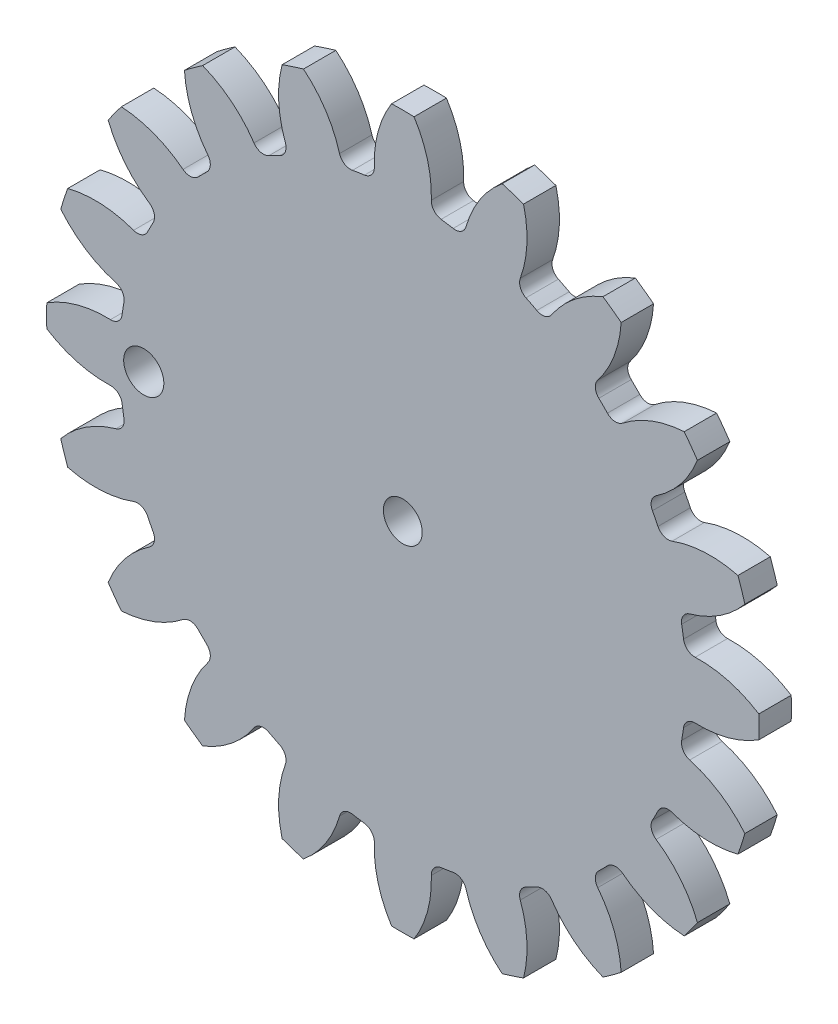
ISO-10303-21;
HEADER;
FILE_DESCRIPTION(('STEP AP214'),'2;1');
FILE_NAME('part.step','',(''),(''),'','','');
FILE_SCHEMA(('AUTOMOTIVE_DESIGN { 1 0 10303 214 1 1 1 1 }'));
ENDSEC;
DATA;
#1=APPLICATION_CONTEXT('core data for automotive mechanical design processes');
#2=APPLICATION_PROTOCOL_DEFINITION('international standard','automotive_design',2000,#1);
#3=PRODUCT_CONTEXT('',#1,'mechanical');
#4=PRODUCT('Part','Part','',(#3));
#5=PRODUCT_RELATED_PRODUCT_CATEGORY('part','',(#4));
#6=PRODUCT_DEFINITION_FORMATION('','',#4);
#7=PRODUCT_DEFINITION_CONTEXT('part definition',#1,'design');
#8=PRODUCT_DEFINITION('design','',#6,#7);
#9=PRODUCT_DEFINITION_SHAPE('','',#8);
#10=(LENGTH_UNIT() NAMED_UNIT(*) SI_UNIT(.MILLI.,.METRE.));
#11=(NAMED_UNIT(*) PLANE_ANGLE_UNIT() SI_UNIT($,.RADIAN.));
#12=(NAMED_UNIT(*) SI_UNIT($,.STERADIAN.) SOLID_ANGLE_UNIT());
#13=UNCERTAINTY_MEASURE_WITH_UNIT(LENGTH_MEASURE(1.E-05),#10,'distance_accuracy_value','');
#14=(GEOMETRIC_REPRESENTATION_CONTEXT(3) GLOBAL_UNCERTAINTY_ASSIGNED_CONTEXT((#13)) GLOBAL_UNIT_ASSIGNED_CONTEXT((#10,
#11,#12)) REPRESENTATION_CONTEXT('',''));
#15=CARTESIAN_POINT('',(0.,0.,0.));
#16=DIRECTION('',(0.,0.,1.));
#17=DIRECTION('',(1.,0.,0.));
#18=AXIS2_PLACEMENT_3D('',#15,#16,#17);
#19=CARTESIAN_POINT('',(0.,0.,5.));
#20=DIRECTION('',(0.,0.,-1.));
#21=DIRECTION('',(-1.,0.,0.));
#22=AXIS2_PLACEMENT_3D('',#19,#20,#21);
#23=CYLINDRICAL_SURFACE('',#22,43.75);
#24=CARTESIAN_POINT('',(0.,0.,5.));
#25=DIRECTION('',(0.,0.,1.));
#26=DIRECTION('',(1.,0.,0.));
#27=AXIS2_PLACEMENT_3D('',#24,#25,#26);
#28=CIRCLE('',#27,43.75);
#29=CARTESIAN_POINT('',(7.77047549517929,43.0544098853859,5.));
#30=VERTEX_POINT('',#29);
#31=CARTESIAN_POINT('',(5.91438298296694,43.3483860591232,5.));
#32=VERTEX_POINT('',#31);
#33=EDGE_CURVE('E1261',#30,#32,#28,.T.);
#34=ORIENTED_EDGE('',*,*,#33,.F.);
#35=DIRECTION('',(0.,0.,-1.));
#36=VECTOR('',#35,1.);
#37=CARTESIAN_POINT('',(7.77047549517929,43.0544098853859,5.));
#38=LINE('',#37,#36);
#39=CARTESIAN_POINT('',(7.77047549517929,43.0544098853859,0.));
#40=VERTEX_POINT('',#39);
#41=EDGE_CURVE('E1305',#30,#40,#38,.T.);
#42=ORIENTED_EDGE('',*,*,#41,.T.);
#43=CARTESIAN_POINT('',(0.,0.,0.));
#44=DIRECTION('',(0.,0.,1.));
#45=DIRECTION('',(1.,0.,0.));
#46=AXIS2_PLACEMENT_3D('',#43,#44,#45);
#47=CIRCLE('',#46,43.75);
#48=CARTESIAN_POINT('',(5.91438298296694,43.3483860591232,0.));
#49=VERTEX_POINT('',#48);
#50=EDGE_CURVE('E1249',#40,#49,#47,.T.);
#51=ORIENTED_EDGE('',*,*,#50,.T.);
#52=DIRECTION('',(0.,0.,-1.));
#53=VECTOR('',#52,1.);
#54=CARTESIAN_POINT('',(5.91438298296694,43.3483860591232,5.));
#55=LINE('',#54,#53);
#56=EDGE_CURVE('E1281',#49,#32,#55,.F.);
#57=ORIENTED_EDGE('',*,*,#56,.T.);
#58=EDGE_LOOP('',(#34,#42,#51,#57));
#59=FACE_BOUND('',#58,.T.);
#60=ADVANCED_FACE('F27',(#59),#23,.T.);
#61=CARTESIAN_POINT('',(-12.7321741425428,45.773478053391,5.));
#62=DIRECTION('',(0.,0.,-1.));
#63=DIRECTION('',(-1.,0.,0.));
#64=AXIS2_PLACEMENT_3D('',#61,#62,#63);
#65=CYLINDRICAL_SURFACE('',#64,17.1457769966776);
#66=CARTESIAN_POINT('',(-12.7321741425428,45.773478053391,5.));
#67=DIRECTION('',(0.,0.,-1.));
#68=DIRECTION('',(-1.,0.,0.));
#69=AXIS2_PLACEMENT_3D('',#66,#67,#68);
#70=CIRCLE('',#69,17.1457769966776);
#71=CARTESIAN_POINT('',(1.73691112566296,54.9725671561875,5.));
#72=VERTEX_POINT('',#71);
#73=CARTESIAN_POINT('',(4.40212935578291,45.1463317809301,5.));
#74=VERTEX_POINT('',#73);
#75=EDGE_CURVE('E1263',#72,#74,#70,.T.);
#76=ORIENTED_EDGE('',*,*,#75,.T.);
#77=DIRECTION('',(0.,0.,-1.));
#78=VECTOR('',#77,1.);
#79=CARTESIAN_POINT('',(4.40212935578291,45.1463317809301,5.));
#80=LINE('',#79,#78);
#81=CARTESIAN_POINT('',(4.40212935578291,45.1463317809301,0.));
#82=VERTEX_POINT('',#81);
#83=EDGE_CURVE('E1278',#74,#82,#80,.T.);
#84=ORIENTED_EDGE('',*,*,#83,.T.);
#85=CARTESIAN_POINT('',(-12.7321741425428,45.773478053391,0.));
#86=DIRECTION('',(0.,0.,-1.));
#87=DIRECTION('',(-1.,0.,0.));
#88=AXIS2_PLACEMENT_3D('',#85,#86,#87);
#89=CIRCLE('',#88,17.1457769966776);
#90=CARTESIAN_POINT('',(1.73691112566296,54.9725671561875,0.));
#91=VERTEX_POINT('',#90);
#92=EDGE_CURVE('E1251',#91,#82,#89,.T.);
#93=ORIENTED_EDGE('',*,*,#92,.F.);
#94=DIRECTION('',(0.,0.,-1.));
#95=VECTOR('',#94,1.);
#96=CARTESIAN_POINT('',(1.73691112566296,54.9725671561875,5.));
#97=LINE('',#96,#95);
#98=EDGE_CURVE('E1276',#72,#91,#97,.T.);
#99=ORIENTED_EDGE('',*,*,#98,.F.);
#100=EDGE_LOOP('',(#76,#84,#93,#99));
#101=FACE_BOUND('',#100,.T.);
#102=ADVANCED_FACE('F1698',(#101),#65,.T.);
#103=CARTESIAN_POINT('',(0.,0.,5.));
#104=DIRECTION('',(0.,0.,-1.));
#105=DIRECTION('',(-1.,0.,0.));
#106=AXIS2_PLACEMENT_3D('',#103,#104,#105);
#107=CYLINDRICAL_SURFACE('',#106,55.);
#108=CARTESIAN_POINT('',(0.,0.,0.));
#109=DIRECTION('',(0.,0.,1.));
#110=DIRECTION('',(1.,0.,0.));
#111=AXIS2_PLACEMENT_3D('',#108,#109,#110);
#112=CIRCLE('',#111,55.);
#113=CARTESIAN_POINT('',(-1.73691112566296,54.9725671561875,0.));
#114=VERTEX_POINT('',#113);
#115=EDGE_CURVE('E1254',#91,#114,#112,.T.);
#116=ORIENTED_EDGE('',*,*,#115,.T.);
#117=DIRECTION('',(0.,0.,-1.));
#118=VECTOR('',#117,1.);
#119=CARTESIAN_POINT('',(-1.73691112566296,54.9725671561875,5.));
#120=LINE('',#119,#118);
#121=CARTESIAN_POINT('',(-1.73691112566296,54.9725671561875,5.));
#122=VERTEX_POINT('',#121);
#123=EDGE_CURVE('E1273',#122,#114,#120,.T.);
#124=ORIENTED_EDGE('',*,*,#123,.F.);
#125=CARTESIAN_POINT('',(0.,0.,5.));
#126=DIRECTION('',(0.,0.,1.));
#127=DIRECTION('',(1.,0.,0.));
#128=AXIS2_PLACEMENT_3D('',#125,#126,#127);
#129=CIRCLE('',#128,55.);
#130=EDGE_CURVE('E1266',#72,#122,#129,.T.);
#131=ORIENTED_EDGE('',*,*,#130,.F.);
#132=ORIENTED_EDGE('',*,*,#98,.T.);
#133=EDGE_LOOP('',(#116,#124,#131,#132));
#134=FACE_BOUND('',#133,.T.);
#135=ADVANCED_FACE('F1694',(#134),#107,.T.);
#136=CARTESIAN_POINT('',(12.7321741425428,45.773478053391,5.));
#137=DIRECTION('',(0.,0.,-1.));
#138=DIRECTION('',(-1.,0.,0.));
#139=AXIS2_PLACEMENT_3D('',#136,#137,#138);
#140=CYLINDRICAL_SURFACE('',#139,17.1457769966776);
#141=CARTESIAN_POINT('',(12.7321741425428,45.773478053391,0.));
#142=DIRECTION('',(0.,0.,1.));
#143=DIRECTION('',(1.,0.,0.));
#144=AXIS2_PLACEMENT_3D('',#141,#142,#143);
#145=CIRCLE('',#144,17.1457769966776);
#146=CARTESIAN_POINT('',(-4.40212935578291,45.1463317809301,0.));
#147=VERTEX_POINT('',#146);
#148=EDGE_CURVE('E1256',#114,#147,#145,.T.);
#149=ORIENTED_EDGE('',*,*,#148,.T.);
#150=DIRECTION('',(0.,0.,-1.));
#151=VECTOR('',#150,1.);
#152=CARTESIAN_POINT('',(-4.40212935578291,45.1463317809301,5.));
#153=LINE('',#152,#151);
#154=CARTESIAN_POINT('',(-4.40212935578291,45.1463317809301,5.));
#155=VERTEX_POINT('',#154);
#156=EDGE_CURVE('E1287',#147,#155,#153,.F.);
#157=ORIENTED_EDGE('',*,*,#156,.T.);
#158=CARTESIAN_POINT('',(12.7321741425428,45.773478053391,5.));
#159=DIRECTION('',(0.,0.,1.));
#160=DIRECTION('',(1.,0.,0.));
#161=AXIS2_PLACEMENT_3D('',#158,#159,#160);
#162=CIRCLE('',#161,17.1457769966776);
#163=EDGE_CURVE('E1268',#122,#155,#162,.T.);
#164=ORIENTED_EDGE('',*,*,#163,.F.);
#165=ORIENTED_EDGE('',*,*,#123,.T.);
#166=EDGE_LOOP('',(#149,#157,#164,#165));
#167=FACE_BOUND('',#166,.T.);
#168=ADVANCED_FACE('F1689',(#167),#140,.T.);
#169=CARTESIAN_POINT('',(0.,0.,5.));
#170=DIRECTION('',(0.,0.,-1.));
#171=DIRECTION('',(-1.,0.,0.));
#172=AXIS2_PLACEMENT_3D('',#169,#170,#171);
#173=CYLINDRICAL_SURFACE('',#172,43.75);
#174=CARTESIAN_POINT('',(0.,0.,0.));
#175=DIRECTION('',(0.,0.,-1.));
#176=DIRECTION('',(-1.,0.,0.));
#177=AXIS2_PLACEMENT_3D('',#174,#175,#176);
#178=CIRCLE('',#177,43.75);
#179=CARTESIAN_POINT('',(-7.7704754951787,43.054409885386,0.));
#180=VERTEX_POINT('',#179);
#181=CARTESIAN_POINT('',(-5.91438298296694,43.3483860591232,0.));
#182=VERTEX_POINT('',#181);
#183=EDGE_CURVE('E1259',#180,#182,#178,.T.);
#184=ORIENTED_EDGE('',*,*,#183,.F.);
#185=DIRECTION('',(0.,0.,-1.));
#186=VECTOR('',#185,1.);
#187=CARTESIAN_POINT('',(-7.7704754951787,43.054409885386,5.));
#188=LINE('',#187,#186);
#189=CARTESIAN_POINT('',(-7.7704754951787,43.054409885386,5.));
#190=VERTEX_POINT('',#189);
#191=EDGE_CURVE('E1660',#180,#190,#188,.F.);
#192=ORIENTED_EDGE('',*,*,#191,.T.);
#193=CARTESIAN_POINT('',(0.,0.,5.));
#194=DIRECTION('',(0.,0.,-1.));
#195=DIRECTION('',(-1.,0.,0.));
#196=AXIS2_PLACEMENT_3D('',#193,#194,#195);
#197=CIRCLE('',#196,43.75);
#198=CARTESIAN_POINT('',(-5.91438298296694,43.3483860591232,5.));
#199=VERTEX_POINT('',#198);
#200=EDGE_CURVE('E1271',#190,#199,#197,.T.);
#201=ORIENTED_EDGE('',*,*,#200,.T.);
#202=DIRECTION('',(0.,0.,-1.));
#203=VECTOR('',#202,1.);
#204=CARTESIAN_POINT('',(-5.91438298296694,43.3483860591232,5.));
#205=LINE('',#204,#203);
#206=EDGE_CURVE('E1284',#199,#182,#205,.T.);
#207=ORIENTED_EDGE('',*,*,#206,.T.);
#208=EDGE_LOOP('',(#184,#192,#201,#207));
#209=FACE_BOUND('',#208,.T.);
#210=ADVANCED_FACE('F1680',(#209),#173,.T.);
#211=CARTESIAN_POINT('',(0.,0.,5.));
#212=DIRECTION('',(0.,0.,1.));
#213=DIRECTION('',(1.,0.,0.));
#214=AXIS2_PLACEMENT_3D('',#211,#212,#213);
#215=PLANE('',#214);
#216=CARTESIAN_POINT('',(-40.,0.,5.));
#217=DIRECTION('',(0.,0.,1.));
#218=DIRECTION('',(1.,0.,0.));
#219=AXIS2_PLACEMENT_3D('',#216,#217,#218);
#220=CIRCLE('',#219,3.1);
#221=CARTESIAN_POINT('',(-36.9,0.,5.));
#222=VERTEX_POINT('',#221);
#223=EDGE_CURVE('E3124',#222,#222,#220,.T.);
#224=ORIENTED_EDGE('',*,*,#223,.F.);
#225=EDGE_LOOP('',(#224));
#226=FACE_BOUND('',#225,.T.);
#227=CARTESIAN_POINT('',(0.,0.,5.));
#228=DIRECTION('',(0.,0.,1.));
#229=DIRECTION('',(1.,0.,0.));
#230=AXIS2_PLACEMENT_3D('',#227,#228,#229);
#231=CIRCLE('',#230,3.);
#232=CARTESIAN_POINT('',(3.,0.,5.));
#233=VERTEX_POINT('',#232);
#234=EDGE_CURVE('E789',#233,#233,#231,.T.);
#235=ORIENTED_EDGE('',*,*,#234,.F.);
#236=EDGE_LOOP('',(#235));
#237=FACE_BOUND('',#236,.T.);
#238=CARTESIAN_POINT('',(26.2537997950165,39.5987063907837,5.));
#239=DIRECTION('',(0.,0.,1.));
#240=DIRECTION('',(0.951056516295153,-0.309016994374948,0.));
#241=AXIS2_PLACEMENT_3D('',#238,#239,#240);
#242=CIRCLE('',#241,17.1457769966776);
#243=CARTESIAN_POINT('',(15.3355568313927,52.8187532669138,5.));
#244=VERTEX_POINT('',#243);
#245=CARTESIAN_POINT('',(9.7643099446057,44.2970458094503,5.));
#246=VERTEX_POINT('',#245);
#247=EDGE_CURVE('E1241',#244,#246,#242,.T.);
#248=ORIENTED_EDGE('',*,*,#247,.T.);
#249=CARTESIAN_POINT('',(8.08129451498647,44.7765862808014,5.));
#250=DIRECTION('',(0.,0.,1.));
#251=DIRECTION('',(1.,0.,0.));
#252=AXIS2_PLACEMENT_3D('',#249,#250,#251);
#253=CIRCLE('',#252,1.75);
#254=EDGE_CURVE('E1317',#246,#30,#253,.F.);
#255=ORIENTED_EDGE('',*,*,#254,.T.);
#256=ORIENTED_EDGE('',*,*,#33,.T.);
#257=CARTESIAN_POINT('',(6.15095830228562,45.0823215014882,5.));
#258=DIRECTION('',(0.,0.,1.));
#259=DIRECTION('',(1.,0.,0.));
#260=AXIS2_PLACEMENT_3D('',#257,#258,#259);
#261=CIRCLE('',#260,1.75);
#262=EDGE_CURVE('E1292',#32,#74,#261,.F.);
#263=ORIENTED_EDGE('',*,*,#262,.T.);
#264=ORIENTED_EDGE('',*,*,#75,.F.);
#265=ORIENTED_EDGE('',*,*,#130,.T.);
#266=ORIENTED_EDGE('',*,*,#163,.T.);
#267=CARTESIAN_POINT('',(-6.15095830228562,45.0823215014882,5.));
#268=DIRECTION('',(0.,0.,1.));
#269=DIRECTION('',(1.,0.,0.));
#270=AXIS2_PLACEMENT_3D('',#267,#268,#269);
#271=CIRCLE('',#270,1.75);
#272=EDGE_CURVE('E1296',#155,#199,#271,.F.);
#273=ORIENTED_EDGE('',*,*,#272,.T.);
#274=ORIENTED_EDGE('',*,*,#200,.F.);
#275=CARTESIAN_POINT('',(-8.08129451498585,44.7765862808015,5.));
#276=DIRECTION('',(0.,0.,1.));
#277=DIRECTION('',(1.,0.,0.));
#278=AXIS2_PLACEMENT_3D('',#275,#276,#277);
#279=CIRCLE('',#278,1.75);
#280=CARTESIAN_POINT('',(-9.76430994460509,44.2970458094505,5.));
#281=VERTEX_POINT('',#280);
#282=EDGE_CURVE('E1668',#190,#281,#279,.F.);
#283=ORIENTED_EDGE('',*,*,#282,.T.);
#284=CARTESIAN_POINT('',(-26.253799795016,39.5987063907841,5.));
#285=DIRECTION('',(0.,0.,-1.));
#286=DIRECTION('',(-0.951056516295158,-0.309016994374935,0.));
#287=AXIS2_PLACEMENT_3D('',#284,#285,#286);
#288=CIRCLE('',#287,17.1457769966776);
#289=CARTESIAN_POINT('',(-15.335556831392,52.8187532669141,5.));
#290=VERTEX_POINT('',#289);
#291=EDGE_CURVE('E794',#290,#281,#288,.T.);
#292=ORIENTED_EDGE('',*,*,#291,.F.);
#293=CARTESIAN_POINT('',(0.,0.,5.));
#294=DIRECTION('',(0.,0.,1.));
#295=DIRECTION('',(0.951056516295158,0.309016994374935,0.));
#296=AXIS2_PLACEMENT_3D('',#293,#294,#295);
#297=CIRCLE('',#296,55.);
#298=CARTESIAN_POINT('',(-18.6393581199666,51.7452831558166,5.));
#299=VERTEX_POINT('',#298);
#300=EDGE_CURVE('E769',#290,#299,#297,.T.);
#301=ORIENTED_EDGE('',*,*,#300,.T.);
#302=CARTESIAN_POINT('',(-2.03576542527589,47.4676227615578,5.));
#303=DIRECTION('',(0.,0.,1.));
#304=DIRECTION('',(0.951056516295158,0.309016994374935,0.));
#305=AXIS2_PLACEMENT_3D('',#302,#303,#304);
#306=CIRCLE('',#305,17.1457769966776);
#307=CARTESIAN_POINT('',(-18.1376575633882,41.5763802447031,5.));
#308=VERTEX_POINT('',#307);
#309=EDGE_CURVE('E797',#299,#308,#306,.T.);
#310=ORIENTED_EDGE('',*,*,#309,.T.);
#311=CARTESIAN_POINT('',(-19.7811124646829,40.9750849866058,5.));
#312=DIRECTION('',(0.,0.,1.));
#313=DIRECTION('',(1.,0.,0.));
#314=AXIS2_PLACEMENT_3D('',#311,#312,#313);
#315=CIRCLE('',#314,1.75);
#316=CARTESIAN_POINT('',(-19.0203004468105,39.3991201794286,5.));
#317=VERTEX_POINT('',#316);
#318=EDGE_CURVE('E11',#308,#317,#315,.F.);
#319=ORIENTED_EDGE('',*,*,#318,.T.);
#320=CARTESIAN_POINT('',(0.,0.,5.));
#321=DIRECTION('',(0.,0.,1.));
#322=DIRECTION('',(0.809016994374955,0.587785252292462,0.));
#323=AXIS2_PLACEMENT_3D('',#320,#321,#322);
#324=CIRCLE('',#323,43.75);
#325=CARTESIAN_POINT('',(-20.6947056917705,38.5459680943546,5.));
#326=VERTEX_POINT('',#325);
#327=EDGE_CURVE('E809',#317,#326,#324,.T.);
#328=ORIENTED_EDGE('',*,*,#327,.T.);
#329=CARTESIAN_POINT('',(-21.5224939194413,40.0878068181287,5.));
#330=DIRECTION('',(0.,0.,1.));
#331=DIRECTION('',(1.,0.,0.));
#332=AXIS2_PLACEMENT_3D('',#329,#330,#331);
#333=CIRCLE('',#332,1.75);
#334=CARTESIAN_POINT('',(-22.974950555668,39.1116563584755,5.));
#335=VERTEX_POINT('',#334);
#336=EDGE_CURVE('E1653',#326,#335,#333,.F.);
#337=ORIENTED_EDGE('',*,*,#336,.T.);
#338=CARTESIAN_POINT('',(-37.2055206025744,29.5477374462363,5.));
#339=DIRECTION('',(0.,0.,-1.));
#340=DIRECTION('',(-0.809016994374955,-0.587785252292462,0.));
#341=AXIS2_PLACEMENT_3D('',#338,#339,#340);
#342=CIRCLE('',#341,17.1457769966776);
#343=CARTESIAN_POINT('',(-30.9068736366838,45.4946717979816,5.));
#344=VERTEX_POINT('',#343);
#345=EDGE_CURVE('E811',#344,#335,#342,.T.);
#346=ORIENTED_EDGE('',*,*,#345,.F.);
#347=CARTESIAN_POINT('',(0.,0.,5.));
#348=DIRECTION('',(0.,0.,1.));
#349=DIRECTION('',(0.809016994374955,0.587785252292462,0.));
#350=AXIS2_PLACEMENT_3D('',#347,#348,#349);
#351=CIRCLE('',#350,55.);
#352=CARTESIAN_POINT('',(-33.7172548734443,43.4528103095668,5.));
#353=VERTEX_POINT('',#352);
#354=EDGE_CURVE('E814',#344,#353,#351,.T.);
#355=ORIENTED_EDGE('',*,*,#354,.T.);
#356=CARTESIAN_POINT('',(-16.6044300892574,44.5153058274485,5.));
#357=DIRECTION('',(0.,0.,1.));
#358=DIRECTION('',(0.809016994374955,0.587785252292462,0.));
#359=AXIS2_PLACEMENT_3D('',#356,#357,#358);
#360=CIRCLE('',#359,17.1457769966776);
#361=CARTESIAN_POINT('',(-30.0977454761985,33.9366429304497,5.));
#362=VERTEX_POINT('',#361);
#363=EDGE_CURVE('E816',#353,#362,#360,.T.);
#364=ORIENTED_EDGE('',*,*,#363,.T.);
#365=CARTESIAN_POINT('',(-31.4749535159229,32.85692166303,5.));
#366=DIRECTION('',(0.,0.,1.));
#367=DIRECTION('',(1.,0.,0.));
#368=AXIS2_PLACEMENT_3D('',#365,#366,#367);
#369=CIRCLE('',#368,1.75);
#370=CARTESIAN_POINT('',(-30.2643783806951,31.5931939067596,5.));
#371=VERTEX_POINT('',#370);
#372=EDGE_CURVE('E1657',#362,#371,#369,.F.);
#373=ORIENTED_EDGE('',*,*,#372,.T.);
#374=CARTESIAN_POINT('',(0.,0.,5.));
#375=DIRECTION('',(0.,0.,1.));
#376=DIRECTION('',(0.587785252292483,0.80901699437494,0.));
#377=AXIS2_PLACEMENT_3D('',#374,#375,#376);
#378=CIRCLE('',#377,43.75);
#379=CARTESIAN_POINT('',(-31.5931939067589,30.2643783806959,5.));
#380=VERTEX_POINT('',#379);
#381=EDGE_CURVE('E834',#371,#380,#378,.T.);
#382=ORIENTED_EDGE('',*,*,#381,.T.);
#383=CARTESIAN_POINT('',(-32.8569216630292,31.4749535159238,5.));
#384=DIRECTION('',(0.,0.,1.));
#385=DIRECTION('',(1.,0.,0.));
#386=AXIS2_PLACEMENT_3D('',#383,#384,#385);
#387=CIRCLE('',#386,1.75);
#388=CARTESIAN_POINT('',(-33.9366429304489,30.0977454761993,5.));
#389=VERTEX_POINT('',#388);
#390=EDGE_CURVE('E1633',#380,#389,#387,.F.);
#391=ORIENTED_EDGE('',*,*,#390,.T.);
#392=CARTESIAN_POINT('',(-44.5153058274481,16.6044300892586,5.));
#393=DIRECTION('',(0.,0.,-1.));
#394=DIRECTION('',(-0.587785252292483,-0.80901699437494,0.));
#395=AXIS2_PLACEMENT_3D('',#392,#393,#394);
#396=CIRCLE('',#395,17.1457769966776);
#397=CARTESIAN_POINT('',(-43.452810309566,33.7172548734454,5.));
#398=VERTEX_POINT('',#397);
#399=EDGE_CURVE('E836',#398,#389,#396,.T.);
#400=ORIENTED_EDGE('',*,*,#399,.F.);
#401=CARTESIAN_POINT('',(0.,0.,5.));
#402=DIRECTION('',(0.,0.,1.));
#403=DIRECTION('',(0.587785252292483,0.80901699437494,0.));
#404=AXIS2_PLACEMENT_3D('',#401,#402,#403);
#405=CIRCLE('',#404,55.);
#406=CARTESIAN_POINT('',(-45.4946717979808,30.9068736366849,5.));
#407=VERTEX_POINT('',#406);
#408=EDGE_CURVE('E839',#398,#407,#405,.T.);
#409=ORIENTED_EDGE('',*,*,#408,.T.);
#410=CARTESIAN_POINT('',(-29.5477374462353,37.2055206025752,5.));
#411=DIRECTION('',(0.,0.,1.));
#412=DIRECTION('',(0.587785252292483,0.80901699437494,0.));
#413=AXIS2_PLACEMENT_3D('',#410,#411,#412);
#414=CIRCLE('',#413,17.1457769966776);
#415=CARTESIAN_POINT('',(-39.1116563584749,22.974950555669,5.));
#416=VERTEX_POINT('',#415);
#417=EDGE_CURVE('E841',#407,#416,#414,.T.);
#418=ORIENTED_EDGE('',*,*,#417,.T.);
#419=CARTESIAN_POINT('',(-40.0878068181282,21.5224939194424,5.));
#420=DIRECTION('',(0.,0.,1.));
#421=DIRECTION('',(1.,0.,0.));
#422=AXIS2_PLACEMENT_3D('',#419,#420,#421);
#423=CIRCLE('',#422,1.75);
#424=CARTESIAN_POINT('',(-38.545968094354,20.6947056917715,5.));
#425=VERTEX_POINT('',#424);
#426=EDGE_CURVE('E1637',#416,#425,#423,.F.);
#427=ORIENTED_EDGE('',*,*,#426,.T.);
#428=CARTESIAN_POINT('',(0.,0.,5.));
#429=DIRECTION('',(0.,0.,1.));
#430=DIRECTION('',(0.309016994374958,0.95105651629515,0.));
#431=AXIS2_PLACEMENT_3D('',#428,#429,#430);
#432=CIRCLE('',#431,43.75);
#433=CARTESIAN_POINT('',(-39.3991201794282,19.0203004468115,5.));
#434=VERTEX_POINT('',#433);
#435=EDGE_CURVE('E859',#425,#434,#432,.T.);
#436=ORIENTED_EDGE('',*,*,#435,.T.);
#437=CARTESIAN_POINT('',(-40.9750849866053,19.7811124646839,5.));
#438=DIRECTION('',(0.,0.,1.));
#439=DIRECTION('',(1.,0.,0.));
#440=AXIS2_PLACEMENT_3D('',#437,#438,#439);
#441=CIRCLE('',#440,1.75);
#442=CARTESIAN_POINT('',(-41.5763802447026,18.1376575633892,5.));
#443=VERTEX_POINT('',#442);
#444=EDGE_CURVE('E1613',#434,#443,#441,.F.);
#445=ORIENTED_EDGE('',*,*,#444,.T.);
#446=CARTESIAN_POINT('',(-47.4676227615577,2.03576542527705,5.));
#447=DIRECTION('',(0.,0.,-1.));
#448=DIRECTION('',(-0.309016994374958,-0.95105651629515,0.));
#449=AXIS2_PLACEMENT_3D('',#446,#447,#448);
#450=CIRCLE('',#449,17.1457769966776);
#451=CARTESIAN_POINT('',(-51.7452831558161,18.6393581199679,5.));
#452=VERTEX_POINT('',#451);
#453=EDGE_CURVE('E861',#452,#443,#450,.T.);
#454=ORIENTED_EDGE('',*,*,#453,.F.);
#455=CARTESIAN_POINT('',(0.,0.,5.));
#456=DIRECTION('',(0.,0.,1.));
#457=DIRECTION('',(0.309016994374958,0.95105651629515,0.));
#458=AXIS2_PLACEMENT_3D('',#455,#456,#457);
#459=CIRCLE('',#458,55.);
#460=CARTESIAN_POINT('',(-52.8187532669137,15.3355568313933,5.));
#461=VERTEX_POINT('',#460);
#462=EDGE_CURVE('E864',#452,#461,#459,.T.);
#463=ORIENTED_EDGE('',*,*,#462,.T.);
#464=CARTESIAN_POINT('',(-39.5987063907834,26.253799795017,5.));
#465=DIRECTION('',(0.,0.,1.));
#466=DIRECTION('',(0.309016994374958,0.95105651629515,0.));
#467=AXIS2_PLACEMENT_3D('',#464,#465,#466);
#468=CIRCLE('',#467,17.1457769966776);
#469=CARTESIAN_POINT('',(-44.2970458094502,9.76430994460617,5.));
#470=VERTEX_POINT('',#469);
#471=EDGE_CURVE('E866',#461,#470,#468,.T.);
#472=ORIENTED_EDGE('',*,*,#471,.T.);
#473=CARTESIAN_POINT('',(-44.7765862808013,8.08129451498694,5.));
#474=DIRECTION('',(0.,0.,1.));
#475=DIRECTION('',(1.,0.,0.));
#476=AXIS2_PLACEMENT_3D('',#473,#474,#475);
#477=CIRCLE('',#476,1.75);
#478=CARTESIAN_POINT('',(-43.0544098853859,7.77047549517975,5.));
#479=VERTEX_POINT('',#478);
#480=EDGE_CURVE('E1617',#470,#479,#477,.F.);
#481=ORIENTED_EDGE('',*,*,#480,.T.);
#482=CARTESIAN_POINT('',(0.,0.,5.));
#483=DIRECTION('',(0.,0.,1.));
#484=DIRECTION('',(0.,1.,0.));
#485=AXIS2_PLACEMENT_3D('',#482,#483,#484);
#486=CIRCLE('',#485,43.75);
#487=CARTESIAN_POINT('',(-43.3483860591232,5.91438298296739,5.));
#488=VERTEX_POINT('',#487);
#489=EDGE_CURVE('E884',#479,#488,#486,.T.);
#490=ORIENTED_EDGE('',*,*,#489,.T.);
#491=CARTESIAN_POINT('',(-45.0823215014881,6.15095830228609,5.));
#492=DIRECTION('',(0.,0.,1.));
#493=DIRECTION('',(1.,0.,0.));
#494=AXIS2_PLACEMENT_3D('',#491,#492,#493);
#495=CIRCLE('',#494,1.75);
#496=CARTESIAN_POINT('',(-45.1463317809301,4.40212935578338,5.));
#497=VERTEX_POINT('',#496);
#498=EDGE_CURVE('E1593',#488,#497,#495,.F.);
#499=ORIENTED_EDGE('',*,*,#498,.T.);
#500=CARTESIAN_POINT('',(-45.7734780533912,-12.7321741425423,5.));
#501=DIRECTION('',(0.,0.,-1.));
#502=DIRECTION('',(0.,-1.,0.));
#503=AXIS2_PLACEMENT_3D('',#500,#501,#502);
#504=CIRCLE('',#503,17.1457769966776);
#505=CARTESIAN_POINT('',(-54.9725671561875,1.73691112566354,5.));
#506=VERTEX_POINT('',#505);
#507=EDGE_CURVE('E886',#506,#497,#504,.T.);
#508=ORIENTED_EDGE('',*,*,#507,.F.);
#509=CARTESIAN_POINT('',(0.,0.,5.));
#510=DIRECTION('',(0.,0.,1.));
#511=DIRECTION('',(0.,1.,0.));
#512=AXIS2_PLACEMENT_3D('',#509,#510,#511);
#513=CIRCLE('',#512,55.);
#514=CARTESIAN_POINT('',(-54.9725671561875,-1.73691112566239,5.));
#515=VERTEX_POINT('',#514);
#516=EDGE_CURVE('E889',#506,#515,#513,.T.);
#517=ORIENTED_EDGE('',*,*,#516,.T.);
#518=CARTESIAN_POINT('',(-45.7734780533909,12.7321741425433,5.));
#519=DIRECTION('',(0.,0.,1.));
#520=DIRECTION('',(0.,1.,0.));
#521=AXIS2_PLACEMENT_3D('',#518,#519,#520);
#522=CIRCLE('',#521,17.1457769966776);
#523=CARTESIAN_POINT('',(-45.1463317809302,-4.40212935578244,5.));
#524=VERTEX_POINT('',#523);
#525=EDGE_CURVE('E891',#515,#524,#522,.T.);
#526=ORIENTED_EDGE('',*,*,#525,.T.);
#527=CARTESIAN_POINT('',(-45.0823215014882,-6.15095830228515,5.));
#528=DIRECTION('',(0.,0.,1.));
#529=DIRECTION('',(1.,0.,0.));
#530=AXIS2_PLACEMENT_3D('',#527,#528,#529);
#531=CIRCLE('',#530,1.75);
#532=CARTESIAN_POINT('',(-43.3483860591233,-5.91438298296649,5.));
#533=VERTEX_POINT('',#532);
#534=EDGE_CURVE('E1597',#524,#533,#531,.F.);
#535=ORIENTED_EDGE('',*,*,#534,.T.);
#536=CARTESIAN_POINT('',(0.,0.,5.));
#537=DIRECTION('',(0.,0.,1.));
#538=DIRECTION('',(-0.309016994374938,0.951056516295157,0.));
#539=AXIS2_PLACEMENT_3D('',#536,#537,#538);
#540=CIRCLE('',#539,43.75);
#541=CARTESIAN_POINT('',(-43.054409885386,-7.77047549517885,5.));
#542=VERTEX_POINT('',#541);
#543=EDGE_CURVE('E909',#533,#542,#540,.T.);
#544=ORIENTED_EDGE('',*,*,#543,.T.);
#545=CARTESIAN_POINT('',(-44.7765862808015,-8.081294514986,5.));
#546=DIRECTION('',(0.,0.,1.));
#547=DIRECTION('',(1.,0.,0.));
#548=AXIS2_PLACEMENT_3D('',#545,#546,#547);
#549=CIRCLE('',#548,1.75);
#550=CARTESIAN_POINT('',(-44.2970458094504,-9.76430994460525,5.));
#551=VERTEX_POINT('',#550);
#552=EDGE_CURVE('E1573',#542,#551,#549,.F.);
#553=ORIENTED_EDGE('',*,*,#552,.T.);
#554=CARTESIAN_POINT('',(-39.598706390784,-26.2537997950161,5.));
#555=DIRECTION('',(0.,0.,-1.));
#556=DIRECTION('',(0.309016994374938,-0.951056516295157,0.));
#557=AXIS2_PLACEMENT_3D('',#554,#555,#556);
#558=CIRCLE('',#557,17.1457769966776);
#559=CARTESIAN_POINT('',(-52.818753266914,-15.3355568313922,5.));
#560=VERTEX_POINT('',#559);
#561=EDGE_CURVE('E911',#560,#551,#558,.T.);
#562=ORIENTED_EDGE('',*,*,#561,.F.);
#563=CARTESIAN_POINT('',(0.,0.,5.));
#564=DIRECTION('',(0.,0.,1.));
#565=DIRECTION('',(-0.309016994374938,0.951056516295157,0.));
#566=AXIS2_PLACEMENT_3D('',#563,#564,#565);
#567=CIRCLE('',#566,55.);
#568=CARTESIAN_POINT('',(-51.7452831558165,-18.6393581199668,5.));
#569=VERTEX_POINT('',#568);
#570=EDGE_CURVE('E914',#560,#569,#567,.T.);
#571=ORIENTED_EDGE('',*,*,#570,.T.);
#572=CARTESIAN_POINT('',(-47.4676227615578,-2.03576542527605,5.));
#573=DIRECTION('',(0.,0.,1.));
#574=DIRECTION('',(-0.309016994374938,0.951056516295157,0.));
#575=AXIS2_PLACEMENT_3D('',#572,#573,#574);
#576=CIRCLE('',#575,17.1457769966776);
#577=CARTESIAN_POINT('',(-41.576380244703,-18.1376575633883,5.));
#578=VERTEX_POINT('',#577);
#579=EDGE_CURVE('E916',#569,#578,#576,.T.);
#580=ORIENTED_EDGE('',*,*,#579,.T.);
#581=CARTESIAN_POINT('',(-40.9750849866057,-19.7811124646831,5.));
#582=DIRECTION('',(0.,0.,1.));
#583=DIRECTION('',(1.,0.,0.));
#584=AXIS2_PLACEMENT_3D('',#581,#582,#583);
#585=CIRCLE('',#584,1.75);
#586=CARTESIAN_POINT('',(-39.3991201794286,-19.0203004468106,5.));
#587=VERTEX_POINT('',#586);
#588=EDGE_CURVE('E1577',#578,#587,#585,.F.);
#589=ORIENTED_EDGE('',*,*,#588,.T.);
#590=CARTESIAN_POINT('',(0.,0.,5.));
#591=DIRECTION('',(0.,0.,1.));
#592=DIRECTION('',(-0.587785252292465,0.809016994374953,0.));
#593=AXIS2_PLACEMENT_3D('',#590,#591,#592);
#594=CIRCLE('',#593,43.75);
#595=CARTESIAN_POINT('',(-38.5459680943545,-20.6947056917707,5.));
#596=VERTEX_POINT('',#595);
#597=EDGE_CURVE('E934',#587,#596,#594,.T.);
#598=ORIENTED_EDGE('',*,*,#597,.T.);
#599=CARTESIAN_POINT('',(-40.0878068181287,-21.5224939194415,5.));
#600=DIRECTION('',(0.,0.,1.));
#601=DIRECTION('',(1.,0.,0.));
#602=AXIS2_PLACEMENT_3D('',#599,#600,#601);
#603=CIRCLE('',#602,1.75);
#604=CARTESIAN_POINT('',(-39.1116563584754,-22.9749505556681,5.));
#605=VERTEX_POINT('',#604);
#606=EDGE_CURVE('E1553',#596,#605,#603,.F.);
#607=ORIENTED_EDGE('',*,*,#606,.T.);
#608=CARTESIAN_POINT('',(-29.5477374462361,-37.2055206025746,5.));
#609=DIRECTION('',(0.,0.,-1.));
#610=DIRECTION('',(0.587785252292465,-0.809016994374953,0.));
#611=AXIS2_PLACEMENT_3D('',#608,#609,#610);
#612=CIRCLE('',#611,17.1457769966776);
#613=CARTESIAN_POINT('',(-45.4946717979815,-30.9068736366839,5.));
#614=VERTEX_POINT('',#613);
#615=EDGE_CURVE('E936',#614,#605,#612,.T.);
#616=ORIENTED_EDGE('',*,*,#615,.F.);
#617=CARTESIAN_POINT('',(0.,0.,5.));
#618=DIRECTION('',(0.,0.,1.));
#619=DIRECTION('',(-0.587785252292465,0.809016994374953,0.));
#620=AXIS2_PLACEMENT_3D('',#617,#618,#619);
#621=CIRCLE('',#620,55.);
#622=CARTESIAN_POINT('',(-43.4528103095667,-33.7172548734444,5.));
#623=VERTEX_POINT('',#622);
#624=EDGE_CURVE('E939',#614,#623,#621,.T.);
#625=ORIENTED_EDGE('',*,*,#624,.T.);
#626=CARTESIAN_POINT('',(-44.5153058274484,-16.6044300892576,5.));
#627=DIRECTION('',(0.,0.,1.));
#628=DIRECTION('',(-0.587785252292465,0.809016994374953,0.));
#629=AXIS2_PLACEMENT_3D('',#626,#627,#628);
#630=CIRCLE('',#629,17.1457769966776);
#631=CARTESIAN_POINT('',(-33.9366429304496,-30.0977454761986,5.));
#632=VERTEX_POINT('',#631);
#633=EDGE_CURVE('E941',#623,#632,#630,.T.);
#634=ORIENTED_EDGE('',*,*,#633,.T.);
#635=CARTESIAN_POINT('',(-32.8569216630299,-31.474953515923,5.));
#636=DIRECTION('',(0.,0.,1.));
#637=DIRECTION('',(1.,0.,0.));
#638=AXIS2_PLACEMENT_3D('',#635,#636,#637);
#639=CIRCLE('',#638,1.75);
#640=CARTESIAN_POINT('',(-31.5931939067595,-30.2643783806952,5.));
#641=VERTEX_POINT('',#640);
#642=EDGE_CURVE('E1557',#632,#641,#639,.F.);
#643=ORIENTED_EDGE('',*,*,#642,.T.);
#644=CARTESIAN_POINT('',(0.,0.,5.));
#645=DIRECTION('',(0.,0.,1.));
#646=DIRECTION('',(-0.809016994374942,0.58778525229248,0.));
#647=AXIS2_PLACEMENT_3D('',#644,#645,#646);
#648=CIRCLE('',#647,43.75);
#649=CARTESIAN_POINT('',(-30.2643783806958,-31.593193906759,5.));
#650=VERTEX_POINT('',#649);
#651=EDGE_CURVE('E959',#641,#650,#648,.T.);
#652=ORIENTED_EDGE('',*,*,#651,.T.);
#653=CARTESIAN_POINT('',(-31.4749535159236,-32.8569216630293,5.));
#654=DIRECTION('',(0.,0.,1.));
#655=DIRECTION('',(1.,0.,0.));
#656=AXIS2_PLACEMENT_3D('',#653,#654,#655);
#657=CIRCLE('',#656,1.75);
#658=CARTESIAN_POINT('',(-30.0977454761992,-33.936642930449,5.));
#659=VERTEX_POINT('',#658);
#660=EDGE_CURVE('E1533',#650,#659,#657,.F.);
#661=ORIENTED_EDGE('',*,*,#660,.T.);
#662=CARTESIAN_POINT('',(-16.6044300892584,-44.5153058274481,5.));
#663=DIRECTION('',(0.,0.,-1.));
#664=DIRECTION('',(0.809016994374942,-0.58778525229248,0.));
#665=AXIS2_PLACEMENT_3D('',#662,#663,#664);
#666=CIRCLE('',#665,17.1457769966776);
#667=CARTESIAN_POINT('',(-33.7172548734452,-43.4528103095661,5.));
#668=VERTEX_POINT('',#667);
#669=EDGE_CURVE('E961',#668,#659,#666,.T.);
#670=ORIENTED_EDGE('',*,*,#669,.F.);
#671=CARTESIAN_POINT('',(0.,0.,5.));
#672=DIRECTION('',(0.,0.,1.));
#673=DIRECTION('',(-0.809016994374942,0.58778525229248,0.));
#674=AXIS2_PLACEMENT_3D('',#671,#672,#673);
#675=CIRCLE('',#674,55.);
#676=CARTESIAN_POINT('',(-30.9068736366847,-45.4946717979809,5.));
#677=VERTEX_POINT('',#676);
#678=EDGE_CURVE('E964',#668,#677,#675,.T.);
#679=ORIENTED_EDGE('',*,*,#678,.T.);
#680=CARTESIAN_POINT('',(-37.2055206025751,-29.5477374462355,5.));
#681=DIRECTION('',(0.,0.,1.));
#682=DIRECTION('',(-0.809016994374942,0.58778525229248,0.));
#683=AXIS2_PLACEMENT_3D('',#680,#681,#682);
#684=CIRCLE('',#683,17.1457769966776);
#685=CARTESIAN_POINT('',(-22.9749505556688,-39.111656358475,5.));
#686=VERTEX_POINT('',#685);
#687=EDGE_CURVE('E966',#677,#686,#684,.T.);
#688=ORIENTED_EDGE('',*,*,#687,.T.);
#689=CARTESIAN_POINT('',(-21.5224939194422,-40.0878068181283,5.));
#690=DIRECTION('',(0.,0.,1.));
#691=DIRECTION('',(1.,0.,0.));
#692=AXIS2_PLACEMENT_3D('',#689,#690,#691);
#693=CIRCLE('',#692,1.75);
#694=CARTESIAN_POINT('',(-20.6947056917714,-38.5459680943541,5.));
#695=VERTEX_POINT('',#694);
#696=EDGE_CURVE('E1537',#686,#695,#693,.F.);
#697=ORIENTED_EDGE('',*,*,#696,.T.);
#698=CARTESIAN_POINT('',(0.,0.,5.));
#699=DIRECTION('',(0.,0.,1.));
#700=DIRECTION('',(-0.951056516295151,0.309016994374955,0.));
#701=AXIS2_PLACEMENT_3D('',#698,#699,#700);
#702=CIRCLE('',#701,43.75);
#703=CARTESIAN_POINT('',(-19.0203004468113,-39.3991201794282,5.));
#704=VERTEX_POINT('',#703);
#705=EDGE_CURVE('E984',#695,#704,#702,.T.);
#706=ORIENTED_EDGE('',*,*,#705,.T.);
#707=CARTESIAN_POINT('',(-19.7811124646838,-40.9750849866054,5.));
#708=DIRECTION('',(0.,0.,1.));
#709=DIRECTION('',(1.,0.,0.));
#710=AXIS2_PLACEMENT_3D('',#707,#708,#709);
#711=CIRCLE('',#710,1.75);
#712=CARTESIAN_POINT('',(-18.137657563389,-41.5763802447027,5.));
#713=VERTEX_POINT('',#712);
#714=EDGE_CURVE('E1513',#704,#713,#711,.F.);
#715=ORIENTED_EDGE('',*,*,#714,.T.);
#716=CARTESIAN_POINT('',(-2.03576542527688,-47.4676227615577,5.));
#717=DIRECTION('',(0.,0.,-1.));
#718=DIRECTION('',(0.951056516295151,-0.309016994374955,0.));
#719=AXIS2_PLACEMENT_3D('',#716,#717,#718);
#720=CIRCLE('',#719,17.1457769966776);
#721=CARTESIAN_POINT('',(-18.6393581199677,-51.7452831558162,5.));
#722=VERTEX_POINT('',#721);
#723=EDGE_CURVE('E986',#722,#713,#720,.T.);
#724=ORIENTED_EDGE('',*,*,#723,.F.);
#725=CARTESIAN_POINT('',(0.,0.,5.));
#726=DIRECTION('',(0.,0.,1.));
#727=DIRECTION('',(-0.951056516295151,0.309016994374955,0.));
#728=AXIS2_PLACEMENT_3D('',#725,#726,#727);
#729=CIRCLE('',#728,55.);
#730=CARTESIAN_POINT('',(-15.3355568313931,-52.8187532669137,5.));
#731=VERTEX_POINT('',#730);
#732=EDGE_CURVE('E989',#722,#731,#729,.T.);
#733=ORIENTED_EDGE('',*,*,#732,.T.);
#734=CARTESIAN_POINT('',(-26.2537997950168,-39.5987063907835,5.));
#735=DIRECTION('',(0.,0.,1.));
#736=DIRECTION('',(-0.951056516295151,0.309016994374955,0.));
#737=AXIS2_PLACEMENT_3D('',#734,#735,#736);
#738=CIRCLE('',#737,17.1457769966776);
#739=CARTESIAN_POINT('',(-9.76430994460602,-44.2970458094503,5.));
#740=VERTEX_POINT('',#739);
#741=EDGE_CURVE('E991',#731,#740,#738,.T.);
#742=ORIENTED_EDGE('',*,*,#741,.T.);
#743=CARTESIAN_POINT('',(-8.08129451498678,-44.7765862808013,5.));
#744=DIRECTION('',(0.,0.,1.));
#745=DIRECTION('',(1.,0.,0.));
#746=AXIS2_PLACEMENT_3D('',#743,#744,#745);
#747=CIRCLE('',#746,1.75);
#748=CARTESIAN_POINT('',(-7.7704754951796,-43.0544098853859,5.));
#749=VERTEX_POINT('',#748);
#750=EDGE_CURVE('E1517',#740,#749,#747,.F.);
#751=ORIENTED_EDGE('',*,*,#750,.T.);
#752=CARTESIAN_POINT('',(0.,0.,5.));
#753=DIRECTION('',(0.,0.,1.));
#754=DIRECTION('',(-1.,0.,0.));
#755=AXIS2_PLACEMENT_3D('',#752,#753,#754);
#756=CIRCLE('',#755,43.75);
#757=CARTESIAN_POINT('',(-5.91438298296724,-43.3483860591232,5.));
#758=VERTEX_POINT('',#757);
#759=EDGE_CURVE('E1009',#749,#758,#756,.T.);
#760=ORIENTED_EDGE('',*,*,#759,.T.);
#761=CARTESIAN_POINT('',(-6.15095830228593,-45.0823215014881,5.));
#762=DIRECTION('',(0.,0.,1.));
#763=DIRECTION('',(1.,0.,0.));
#764=AXIS2_PLACEMENT_3D('',#761,#762,#763);
#765=CIRCLE('',#764,1.75);
#766=CARTESIAN_POINT('',(-4.40212935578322,-45.1463317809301,5.));
#767=VERTEX_POINT('',#766);
#768=EDGE_CURVE('E1493',#758,#767,#765,.F.);
#769=ORIENTED_EDGE('',*,*,#768,.T.);
#770=CARTESIAN_POINT('',(12.7321741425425,-45.7734780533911,5.));
#771=DIRECTION('',(0.,0.,-1.));
#772=DIRECTION('',(1.,0.,0.));
#773=AXIS2_PLACEMENT_3D('',#770,#771,#772);
#774=CIRCLE('',#773,17.1457769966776);
#775=CARTESIAN_POINT('',(-1.73691112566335,-54.9725671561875,5.));
#776=VERTEX_POINT('',#775);
#777=EDGE_CURVE('E1011',#776,#767,#774,.T.);
#778=ORIENTED_EDGE('',*,*,#777,.F.);
#779=CARTESIAN_POINT('',(0.,0.,5.));
#780=DIRECTION('',(0.,0.,1.));
#781=DIRECTION('',(-1.,0.,0.));
#782=AXIS2_PLACEMENT_3D('',#779,#780,#781);
#783=CIRCLE('',#782,55.);
#784=CARTESIAN_POINT('',(1.73691112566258,-54.9725671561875,5.));
#785=VERTEX_POINT('',#784);
#786=EDGE_CURVE('E1014',#776,#785,#783,.T.);
#787=ORIENTED_EDGE('',*,*,#786,.T.);
#788=CARTESIAN_POINT('',(-12.7321741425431,-45.7734780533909,5.));
#789=DIRECTION('',(0.,0.,1.));
#790=DIRECTION('',(-1.,0.,0.));
#791=AXIS2_PLACEMENT_3D('',#788,#789,#790);
#792=CIRCLE('',#791,17.1457769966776);
#793=CARTESIAN_POINT('',(4.4021293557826,-45.1463317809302,5.));
#794=VERTEX_POINT('',#793);
#795=EDGE_CURVE('E1016',#785,#794,#792,.T.);
#796=ORIENTED_EDGE('',*,*,#795,.T.);
#797=CARTESIAN_POINT('',(6.15095830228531,-45.0823215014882,5.));
#798=DIRECTION('',(0.,0.,1.));
#799=DIRECTION('',(1.,0.,0.));
#800=AXIS2_PLACEMENT_3D('',#797,#798,#799);
#801=CIRCLE('',#800,1.75);
#802=CARTESIAN_POINT('',(5.91438298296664,-43.3483860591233,5.));
#803=VERTEX_POINT('',#802);
#804=EDGE_CURVE('E1497',#794,#803,#801,.F.);
#805=ORIENTED_EDGE('',*,*,#804,.T.);
#806=CARTESIAN_POINT('',(0.,0.,5.));
#807=DIRECTION('',(0.,0.,1.));
#808=DIRECTION('',(-0.951056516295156,-0.309016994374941,0.));
#809=AXIS2_PLACEMENT_3D('',#806,#807,#808);
#810=CIRCLE('',#809,43.75);
#811=CARTESIAN_POINT('',(7.77047549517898,-43.054409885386,5.));
#812=VERTEX_POINT('',#811);
#813=EDGE_CURVE('E1034',#803,#812,#810,.T.);
#814=ORIENTED_EDGE('',*,*,#813,.T.);
#815=CARTESIAN_POINT('',(8.08129451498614,-44.7765862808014,5.));
#816=DIRECTION('',(0.,0.,1.));
#817=DIRECTION('',(1.,0.,0.));
#818=AXIS2_PLACEMENT_3D('',#815,#816,#817);
#819=CIRCLE('',#818,1.75);
#820=CARTESIAN_POINT('',(9.76430994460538,-44.2970458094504,5.));
#821=VERTEX_POINT('',#820);
#822=EDGE_CURVE('E1473',#812,#821,#819,.F.);
#823=ORIENTED_EDGE('',*,*,#822,.T.);
#824=CARTESIAN_POINT('',(26.2537997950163,-39.5987063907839,5.));
#825=DIRECTION('',(0.,0.,-1.));
#826=DIRECTION('',(0.951056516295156,0.309016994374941,0.));
#827=AXIS2_PLACEMENT_3D('',#824,#825,#826);
#828=CIRCLE('',#827,17.1457769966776);
#829=CARTESIAN_POINT('',(15.3355568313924,-52.818753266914,5.));
#830=VERTEX_POINT('',#829);
#831=EDGE_CURVE('E1036',#830,#821,#828,.T.);
#832=ORIENTED_EDGE('',*,*,#831,.F.);
#833=CARTESIAN_POINT('',(0.,0.,5.));
#834=DIRECTION('',(0.,0.,1.));
#835=DIRECTION('',(-0.951056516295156,-0.309016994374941,0.));
#836=AXIS2_PLACEMENT_3D('',#833,#834,#835);
#837=CIRCLE('',#836,55.);
#838=CARTESIAN_POINT('',(18.639358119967,-51.7452831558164,5.));
#839=VERTEX_POINT('',#838);
#840=EDGE_CURVE('E1039',#830,#839,#837,.T.);
#841=ORIENTED_EDGE('',*,*,#840,.T.);
#842=CARTESIAN_POINT('',(2.0357654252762,-47.4676227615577,5.));
#843=DIRECTION('',(0.,0.,1.));
#844=DIRECTION('',(-0.951056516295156,-0.309016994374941,0.));
#845=AXIS2_PLACEMENT_3D('',#842,#843,#844);
#846=CIRCLE('',#845,17.1457769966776);
#847=CARTESIAN_POINT('',(18.1376575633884,-41.5763802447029,5.));
#848=VERTEX_POINT('',#847);
#849=EDGE_CURVE('E1041',#839,#848,#846,.T.);
#850=ORIENTED_EDGE('',*,*,#849,.T.);
#851=CARTESIAN_POINT('',(19.7811124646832,-40.9750849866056,5.));
#852=DIRECTION('',(0.,0.,1.));
#853=DIRECTION('',(1.,0.,0.));
#854=AXIS2_PLACEMENT_3D('',#851,#852,#853);
#855=CIRCLE('',#854,1.75);
#856=CARTESIAN_POINT('',(19.0203004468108,-39.3991201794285,5.));
#857=VERTEX_POINT('',#856);
#858=EDGE_CURVE('E1477',#848,#857,#855,.F.);
#859=ORIENTED_EDGE('',*,*,#858,.T.);
#860=CARTESIAN_POINT('',(0.,0.,5.));
#861=DIRECTION('',(0.,0.,1.));
#862=DIRECTION('',(-0.809016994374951,-0.587785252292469,0.));
#863=AXIS2_PLACEMENT_3D('',#860,#861,#862);
#864=CIRCLE('',#863,43.75);
#865=CARTESIAN_POINT('',(20.6947056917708,-38.5459680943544,5.));
#866=VERTEX_POINT('',#865);
#867=EDGE_CURVE('E1059',#857,#866,#864,.T.);
#868=ORIENTED_EDGE('',*,*,#867,.T.);
#869=CARTESIAN_POINT('',(21.5224939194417,-40.0878068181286,5.));
#870=DIRECTION('',(0.,0.,1.));
#871=DIRECTION('',(1.,0.,0.));
#872=AXIS2_PLACEMENT_3D('',#869,#870,#871);
#873=CIRCLE('',#872,1.75);
#874=CARTESIAN_POINT('',(22.9749505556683,-39.1116563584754,5.));
#875=VERTEX_POINT('',#874);
#876=EDGE_CURVE('E1453',#866,#875,#873,.F.);
#877=ORIENTED_EDGE('',*,*,#876,.T.);
#878=CARTESIAN_POINT('',(37.2055206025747,-29.547737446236,5.));
#879=DIRECTION('',(0.,0.,-1.));
#880=DIRECTION('',(0.809016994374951,0.587785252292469,0.));
#881=AXIS2_PLACEMENT_3D('',#878,#879,#880);
#882=CIRCLE('',#881,17.1457769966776);
#883=CARTESIAN_POINT('',(30.9068736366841,-45.4946717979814,5.));
#884=VERTEX_POINT('',#883);
#885=EDGE_CURVE('E1061',#884,#875,#882,.T.);
#886=ORIENTED_EDGE('',*,*,#885,.F.);
#887=CARTESIAN_POINT('',(0.,0.,5.));
#888=DIRECTION('',(0.,0.,1.));
#889=DIRECTION('',(-0.809016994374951,-0.587785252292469,0.));
#890=AXIS2_PLACEMENT_3D('',#887,#888,#889);
#891=CIRCLE('',#890,55.);
#892=CARTESIAN_POINT('',(33.7172548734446,-43.4528103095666,5.));
#893=VERTEX_POINT('',#892);
#894=EDGE_CURVE('E1064',#884,#893,#891,.T.);
#895=ORIENTED_EDGE('',*,*,#894,.T.);
#896=CARTESIAN_POINT('',(16.6044300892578,-44.5153058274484,5.));
#897=DIRECTION('',(0.,0.,1.));
#898=DIRECTION('',(-0.809016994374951,-0.587785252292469,0.));
#899=AXIS2_PLACEMENT_3D('',#896,#897,#898);
#900=CIRCLE('',#899,17.1457769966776);
#901=CARTESIAN_POINT('',(30.0977454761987,-33.9366429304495,5.));
#902=VERTEX_POINT('',#901);
#903=EDGE_CURVE('E1066',#893,#902,#900,.T.);
#904=ORIENTED_EDGE('',*,*,#903,.T.);
#905=CARTESIAN_POINT('',(31.4749535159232,-32.8569216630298,5.));
#906=DIRECTION('',(0.,0.,1.));
#907=DIRECTION('',(1.,0.,0.));
#908=AXIS2_PLACEMENT_3D('',#905,#906,#907);
#909=CIRCLE('',#908,1.75);
#910=CARTESIAN_POINT('',(30.2643783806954,-31.5931939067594,5.));
#911=VERTEX_POINT('',#910);
#912=EDGE_CURVE('E1457',#902,#911,#909,.F.);
#913=ORIENTED_EDGE('',*,*,#912,.T.);
#914=CARTESIAN_POINT('',(0.,0.,5.));
#915=DIRECTION('',(0.,0.,1.));
#916=DIRECTION('',(-0.587785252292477,-0.809016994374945,0.));
#917=AXIS2_PLACEMENT_3D('',#914,#915,#916);
#918=CIRCLE('',#917,43.75);
#919=CARTESIAN_POINT('',(31.5931939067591,-30.2643783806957,5.));
#920=VERTEX_POINT('',#919);
#921=EDGE_CURVE('E1084',#911,#920,#918,.T.);
#922=ORIENTED_EDGE('',*,*,#921,.T.);
#923=CARTESIAN_POINT('',(32.8569216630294,-31.4749535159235,5.));
#924=DIRECTION('',(0.,0.,1.));
#925=DIRECTION('',(1.,0.,0.));
#926=AXIS2_PLACEMENT_3D('',#923,#924,#925);
#927=CIRCLE('',#926,1.75);
#928=CARTESIAN_POINT('',(33.9366429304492,-30.0977454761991,5.));
#929=VERTEX_POINT('',#928);
#930=EDGE_CURVE('E1433',#920,#929,#927,.F.);
#931=ORIENTED_EDGE('',*,*,#930,.T.);
#932=CARTESIAN_POINT('',(44.5153058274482,-16.6044300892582,5.));
#933=DIRECTION('',(0.,0.,-1.));
#934=DIRECTION('',(0.587785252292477,0.809016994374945,0.));
#935=AXIS2_PLACEMENT_3D('',#932,#933,#934);
#936=CIRCLE('',#935,17.1457769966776);
#937=CARTESIAN_POINT('',(43.4528103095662,-33.7172548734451,5.));
#938=VERTEX_POINT('',#937);
#939=EDGE_CURVE('E1086',#938,#929,#936,.T.);
#940=ORIENTED_EDGE('',*,*,#939,.F.);
#941=CARTESIAN_POINT('',(0.,0.,5.));
#942=DIRECTION('',(0.,0.,1.));
#943=DIRECTION('',(-0.587785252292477,-0.809016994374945,0.));
#944=AXIS2_PLACEMENT_3D('',#941,#942,#943);
#945=CIRCLE('',#944,55.);
#946=CARTESIAN_POINT('',(45.494671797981,-30.9068736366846,5.));
#947=VERTEX_POINT('',#946);
#948=EDGE_CURVE('E1089',#938,#947,#945,.T.);
#949=ORIENTED_EDGE('',*,*,#948,.T.);
#950=CARTESIAN_POINT('',(29.5477374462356,-37.205520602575,5.));
#951=DIRECTION('',(0.,0.,1.));
#952=DIRECTION('',(-0.587785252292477,-0.809016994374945,0.));
#953=AXIS2_PLACEMENT_3D('',#950,#951,#952);
#954=CIRCLE('',#953,17.1457769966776);
#955=CARTESIAN_POINT('',(39.1116563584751,-22.9749505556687,5.));
#956=VERTEX_POINT('',#955);
#957=EDGE_CURVE('E1091',#947,#956,#954,.T.);
#958=ORIENTED_EDGE('',*,*,#957,.T.);
#959=CARTESIAN_POINT('',(40.0878068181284,-21.5224939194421,5.));
#960=DIRECTION('',(0.,0.,1.));
#961=DIRECTION('',(1.,0.,0.));
#962=AXIS2_PLACEMENT_3D('',#959,#960,#961);
#963=CIRCLE('',#962,1.75);
#964=CARTESIAN_POINT('',(38.5459680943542,-20.6947056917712,5.));
#965=VERTEX_POINT('',#964);
#966=EDGE_CURVE('E1437',#956,#965,#963,.F.);
#967=ORIENTED_EDGE('',*,*,#966,.T.);
#968=CARTESIAN_POINT('',(0.,0.,5.));
#969=DIRECTION('',(0.,0.,1.));
#970=DIRECTION('',(-0.309016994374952,-0.951056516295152,0.));
#971=AXIS2_PLACEMENT_3D('',#968,#969,#970);
#972=CIRCLE('',#971,43.75);
#973=CARTESIAN_POINT('',(39.3991201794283,-19.0203004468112,5.));
#974=VERTEX_POINT('',#973);
#975=EDGE_CURVE('E1109',#965,#974,#972,.T.);
#976=ORIENTED_EDGE('',*,*,#975,.T.);
#977=CARTESIAN_POINT('',(40.9750849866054,-19.7811124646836,5.));
#978=DIRECTION('',(0.,0.,1.));
#979=DIRECTION('',(1.,0.,0.));
#980=AXIS2_PLACEMENT_3D('',#977,#978,#979);
#981=CIRCLE('',#980,1.75);
#982=CARTESIAN_POINT('',(41.5763802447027,-18.1376575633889,5.));
#983=VERTEX_POINT('',#982);
#984=EDGE_CURVE('E1413',#974,#983,#981,.F.);
#985=ORIENTED_EDGE('',*,*,#984,.T.);
#986=CARTESIAN_POINT('',(47.4676227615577,-2.03576542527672,5.));
#987=DIRECTION('',(0.,0.,-1.));
#988=DIRECTION('',(0.309016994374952,0.951056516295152,0.));
#989=AXIS2_PLACEMENT_3D('',#986,#987,#988);
#990=CIRCLE('',#989,17.1457769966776);
#991=CARTESIAN_POINT('',(51.7452831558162,-18.6393581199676,5.));
#992=VERTEX_POINT('',#991);
#993=EDGE_CURVE('E1111',#992,#983,#990,.T.);
#994=ORIENTED_EDGE('',*,*,#993,.F.);
#995=CARTESIAN_POINT('',(0.,0.,5.));
#996=DIRECTION('',(0.,0.,1.));
#997=DIRECTION('',(-0.309016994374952,-0.951056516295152,0.));
#998=AXIS2_PLACEMENT_3D('',#995,#996,#997);
#999=CIRCLE('',#998,55.);
#1000=CARTESIAN_POINT('',(52.8187532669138,-15.3355568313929,5.));
#1001=VERTEX_POINT('',#1000);
#1002=EDGE_CURVE('E1114',#992,#1001,#999,.T.);
#1003=ORIENTED_EDGE('',*,*,#1002,.T.);
#1004=CARTESIAN_POINT('',(39.5987063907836,-26.2537997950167,5.));
#1005=DIRECTION('',(0.,0.,1.));
#1006=DIRECTION('',(-0.309016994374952,-0.951056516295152,0.));
#1007=AXIS2_PLACEMENT_3D('',#1004,#1005,#1006);
#1008=CIRCLE('',#1007,17.1457769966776);
#1009=CARTESIAN_POINT('',(44.2970458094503,-9.76430994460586,5.));
#1010=VERTEX_POINT('',#1009);
#1011=EDGE_CURVE('E1116',#1001,#1010,#1008,.T.);
#1012=ORIENTED_EDGE('',*,*,#1011,.T.);
#1013=CARTESIAN_POINT('',(44.7765862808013,-8.08129451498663,5.));
#1014=DIRECTION('',(0.,0.,1.));
#1015=DIRECTION('',(1.,0.,0.));
#1016=AXIS2_PLACEMENT_3D('',#1013,#1014,#1015);
#1017=CIRCLE('',#1016,1.75);
#1018=CARTESIAN_POINT('',(43.0544098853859,-7.77047549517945,5.));
#1019=VERTEX_POINT('',#1018);
#1020=EDGE_CURVE('E1417',#1010,#1019,#1017,.F.);
#1021=ORIENTED_EDGE('',*,*,#1020,.T.);
#1022=CARTESIAN_POINT('',(0.,0.,5.));
#1023=DIRECTION('',(0.,0.,1.));
#1024=DIRECTION('',(0.,-1.,0.));
#1025=AXIS2_PLACEMENT_3D('',#1022,#1023,#1024);
#1026=CIRCLE('',#1025,43.75);
#1027=CARTESIAN_POINT('',(43.3483860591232,-5.91438298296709,5.));
#1028=VERTEX_POINT('',#1027);
#1029=EDGE_CURVE('E1134',#1019,#1028,#1026,.T.);
#1030=ORIENTED_EDGE('',*,*,#1029,.T.);
#1031=CARTESIAN_POINT('',(45.0823215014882,-6.15095830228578,5.));
#1032=DIRECTION('',(0.,0.,1.));
#1033=DIRECTION('',(1.,0.,0.));
#1034=AXIS2_PLACEMENT_3D('',#1031,#1032,#1033);
#1035=CIRCLE('',#1034,1.75);
#1036=CARTESIAN_POINT('',(45.1463317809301,-4.40212935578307,5.));
#1037=VERTEX_POINT('',#1036);
#1038=EDGE_CURVE('E1393',#1028,#1037,#1035,.F.);
#1039=ORIENTED_EDGE('',*,*,#1038,.T.);
#1040=CARTESIAN_POINT('',(45.7734780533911,12.7321741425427,5.));
#1041=DIRECTION('',(0.,0.,-1.));
#1042=DIRECTION('',(0.,1.,0.));
#1043=AXIS2_PLACEMENT_3D('',#1040,#1041,#1042);
#1044=CIRCLE('',#1043,17.1457769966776);
#1045=CARTESIAN_POINT('',(54.9725671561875,-1.73691112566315,5.));
#1046=VERTEX_POINT('',#1045);
#1047=EDGE_CURVE('E1136',#1046,#1037,#1044,.T.);
#1048=ORIENTED_EDGE('',*,*,#1047,.F.);
#1049=CARTESIAN_POINT('',(0.,0.,5.));
#1050=DIRECTION('',(0.,0.,1.));
#1051=DIRECTION('',(0.,-1.,0.));
#1052=AXIS2_PLACEMENT_3D('',#1049,#1050,#1051);
#1053=CIRCLE('',#1052,55.);
#1054=CARTESIAN_POINT('',(54.9725671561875,1.73691112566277,5.));
#1055=VERTEX_POINT('',#1054);
#1056=EDGE_CURVE('E1139',#1046,#1055,#1053,.T.);
#1057=ORIENTED_EDGE('',*,*,#1056,.T.);
#1058=CARTESIAN_POINT('',(45.773478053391,-12.732174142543,5.));
#1059=DIRECTION('',(0.,0.,1.));
#1060=DIRECTION('',(0.,-1.,0.));
#1061=AXIS2_PLACEMENT_3D('',#1058,#1059,#1060);
#1062=CIRCLE('',#1061,17.1457769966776);
#1063=CARTESIAN_POINT('',(45.1463317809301,4.40212935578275,5.));
#1064=VERTEX_POINT('',#1063);
#1065=EDGE_CURVE('E1141',#1055,#1064,#1062,.T.);
#1066=ORIENTED_EDGE('',*,*,#1065,.T.);
#1067=CARTESIAN_POINT('',(45.0823215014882,6.15095830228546,5.));
#1068=DIRECTION('',(0.,0.,1.));
#1069=DIRECTION('',(1.,0.,0.));
#1070=AXIS2_PLACEMENT_3D('',#1067,#1068,#1069);
#1071=CIRCLE('',#1070,1.75);
#1072=CARTESIAN_POINT('',(43.3483860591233,5.91438298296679,5.));
#1073=VERTEX_POINT('',#1072);
#1074=EDGE_CURVE('E1397',#1064,#1073,#1071,.F.);
#1075=ORIENTED_EDGE('',*,*,#1074,.T.);
#1076=CARTESIAN_POINT('',(0.,0.,5.));
#1077=DIRECTION('',(0.,0.,1.));
#1078=DIRECTION('',(0.309016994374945,-0.951056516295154,0.));
#1079=AXIS2_PLACEMENT_3D('',#1076,#1077,#1078);
#1080=CIRCLE('',#1079,43.75);
#1081=CARTESIAN_POINT('',(43.054409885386,7.77047549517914,5.));
#1082=VERTEX_POINT('',#1081);
#1083=EDGE_CURVE('E1159',#1073,#1082,#1080,.T.);
#1084=ORIENTED_EDGE('',*,*,#1083,.T.);
#1085=CARTESIAN_POINT('',(44.7765862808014,8.08129451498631,5.));
#1086=DIRECTION('',(0.,0.,1.));
#1087=DIRECTION('',(1.,0.,0.));
#1088=AXIS2_PLACEMENT_3D('',#1085,#1086,#1087);
#1089=CIRCLE('',#1088,1.75);
#1090=CARTESIAN_POINT('',(44.2970458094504,9.76430994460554,5.));
#1091=VERTEX_POINT('',#1090);
#1092=EDGE_CURVE('E1373',#1082,#1091,#1089,.F.);
#1093=ORIENTED_EDGE('',*,*,#1092,.T.);
#1094=CARTESIAN_POINT('',(39.5987063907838,26.2537997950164,5.));
#1095=DIRECTION('',(0.,0.,-1.));
#1096=DIRECTION('',(-0.309016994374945,0.951056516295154,0.));
#1097=AXIS2_PLACEMENT_3D('',#1094,#1095,#1096);
#1098=CIRCLE('',#1097,17.1457769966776);
#1099=CARTESIAN_POINT('',(52.8187532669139,15.3355568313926,5.));
#1100=VERTEX_POINT('',#1099);
#1101=EDGE_CURVE('E1161',#1100,#1091,#1098,.T.);
#1102=ORIENTED_EDGE('',*,*,#1101,.F.);
#1103=CARTESIAN_POINT('',(0.,0.,5.));
#1104=DIRECTION('',(0.,0.,1.));
#1105=DIRECTION('',(0.309016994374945,-0.951056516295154,0.));
#1106=AXIS2_PLACEMENT_3D('',#1103,#1104,#1105);
#1107=CIRCLE('',#1106,55.);
#1108=CARTESIAN_POINT('',(51.7452831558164,18.6393581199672,5.));
#1109=VERTEX_POINT('',#1108);
#1110=EDGE_CURVE('E1164',#1100,#1109,#1107,.T.);
#1111=ORIENTED_EDGE('',*,*,#1110,.T.);
#1112=CARTESIAN_POINT('',(47.4676227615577,2.03576542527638,5.));
#1113=DIRECTION('',(0.,0.,1.));
#1114=DIRECTION('',(0.309016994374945,-0.951056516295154,0.));
#1115=AXIS2_PLACEMENT_3D('',#1112,#1113,#1114);
#1116=CIRCLE('',#1115,17.1457769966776);
#1117=CARTESIAN_POINT('',(41.5763802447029,18.1376575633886,5.));
#1118=VERTEX_POINT('',#1117);
#1119=EDGE_CURVE('E1166',#1109,#1118,#1116,.T.);
#1120=ORIENTED_EDGE('',*,*,#1119,.T.);
#1121=CARTESIAN_POINT('',(40.9750849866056,19.7811124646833,5.));
#1122=DIRECTION('',(0.,0.,1.));
#1123=DIRECTION('',(1.,0.,0.));
#1124=AXIS2_PLACEMENT_3D('',#1121,#1122,#1123);
#1125=CIRCLE('',#1124,1.75);
#1126=CARTESIAN_POINT('',(39.3991201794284,19.0203004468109,5.));
#1127=VERTEX_POINT('',#1126);
#1128=EDGE_CURVE('E1377',#1118,#1127,#1125,.F.);
#1129=ORIENTED_EDGE('',*,*,#1128,.T.);
#1130=CARTESIAN_POINT('',(0.,0.,5.));
#1131=DIRECTION('',(0.,0.,1.));
#1132=DIRECTION('',(0.587785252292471,-0.809016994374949,0.));
#1133=AXIS2_PLACEMENT_3D('',#1130,#1131,#1132);
#1134=CIRCLE('',#1133,43.75);
#1135=CARTESIAN_POINT('',(38.5459680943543,20.6947056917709,5.));
#1136=VERTEX_POINT('',#1135);
#1137=EDGE_CURVE('E1184',#1127,#1136,#1134,.T.);
#1138=ORIENTED_EDGE('',*,*,#1137,.T.);
#1139=CARTESIAN_POINT('',(40.0878068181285,21.5224939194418,5.));
#1140=DIRECTION('',(0.,0.,1.));
#1141=DIRECTION('',(1.,0.,0.));
#1142=AXIS2_PLACEMENT_3D('',#1139,#1140,#1141);
#1143=CIRCLE('',#1142,1.75);
#1144=CARTESIAN_POINT('',(39.1116563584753,22.9749505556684,5.));
#1145=VERTEX_POINT('',#1144);
#1146=EDGE_CURVE('E1353',#1136,#1145,#1143,.F.);
#1147=ORIENTED_EDGE('',*,*,#1146,.T.);
#1148=CARTESIAN_POINT('',(29.5477374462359,37.2055206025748,5.));
#1149=DIRECTION('',(0.,0.,-1.));
#1150=DIRECTION('',(-0.587785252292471,0.809016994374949,0.));
#1151=AXIS2_PLACEMENT_3D('',#1148,#1149,#1150);
#1152=CIRCLE('',#1151,17.1457769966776);
#1153=CARTESIAN_POINT('',(45.4946717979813,30.9068736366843,5.));
#1154=VERTEX_POINT('',#1153);
#1155=EDGE_CURVE('E1186',#1154,#1145,#1152,.T.);
#1156=ORIENTED_EDGE('',*,*,#1155,.F.);
#1157=CARTESIAN_POINT('',(0.,0.,5.));
#1158=DIRECTION('',(0.,0.,1.));
#1159=DIRECTION('',(0.587785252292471,-0.809016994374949,0.));
#1160=AXIS2_PLACEMENT_3D('',#1157,#1158,#1159);
#1161=CIRCLE('',#1160,55.);
#1162=CARTESIAN_POINT('',(43.4528103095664,33.7172548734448,5.));
#1163=VERTEX_POINT('',#1162);
#1164=EDGE_CURVE('E1189',#1154,#1163,#1161,.T.);
#1165=ORIENTED_EDGE('',*,*,#1164,.T.);
#1166=CARTESIAN_POINT('',(44.5153058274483,16.6044300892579,5.));
#1167=DIRECTION('',(0.,0.,1.));
#1168=DIRECTION('',(0.587785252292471,-0.809016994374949,0.));
#1169=AXIS2_PLACEMENT_3D('',#1166,#1167,#1168);
#1170=CIRCLE('',#1169,17.1457769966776);
#1171=CARTESIAN_POINT('',(33.9366429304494,30.0977454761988,5.));
#1172=VERTEX_POINT('',#1171);
#1173=EDGE_CURVE('E1191',#1163,#1172,#1170,.T.);
#1174=ORIENTED_EDGE('',*,*,#1173,.T.);
#1175=CARTESIAN_POINT('',(32.8569216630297,31.4749535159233,5.));
#1176=DIRECTION('',(0.,0.,1.));
#1177=DIRECTION('',(1.,0.,0.));
#1178=AXIS2_PLACEMENT_3D('',#1175,#1176,#1177);
#1179=CIRCLE('',#1178,1.75);
#1180=CARTESIAN_POINT('',(31.5931939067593,30.2643783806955,5.));
#1181=VERTEX_POINT('',#1180);
#1182=EDGE_CURVE('E1357',#1172,#1181,#1179,.F.);
#1183=ORIENTED_EDGE('',*,*,#1182,.T.);
#1184=CARTESIAN_POINT('',(0.,0.,5.));
#1185=DIRECTION('',(0.,0.,1.));
#1186=DIRECTION('',(0.809016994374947,-0.587785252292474,0.));
#1187=AXIS2_PLACEMENT_3D('',#1184,#1185,#1186);
#1188=CIRCLE('',#1187,43.75);
#1189=CARTESIAN_POINT('',(30.2643783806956,31.5931939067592,5.));
#1190=VERTEX_POINT('',#1189);
#1191=EDGE_CURVE('E1209',#1181,#1190,#1188,.T.);
#1192=ORIENTED_EDGE('',*,*,#1191,.T.);
#1193=CARTESIAN_POINT('',(31.4749535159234,32.8569216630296,5.));
#1194=DIRECTION('',(0.,0.,1.));
#1195=DIRECTION('',(1.,0.,0.));
#1196=AXIS2_PLACEMENT_3D('',#1193,#1194,#1195);
#1197=CIRCLE('',#1196,1.75);
#1198=CARTESIAN_POINT('',(30.097745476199,33.9366429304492,5.));
#1199=VERTEX_POINT('',#1198);
#1200=EDGE_CURVE('E1333',#1190,#1199,#1197,.F.);
#1201=ORIENTED_EDGE('',*,*,#1200,.T.);
#1202=CARTESIAN_POINT('',(16.6044300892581,44.5153058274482,5.));
#1203=DIRECTION('',(0.,0.,-1.));
#1204=DIRECTION('',(-0.809016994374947,0.587785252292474,0.));
#1205=AXIS2_PLACEMENT_3D('',#1202,#1203,#1204);
#1206=CIRCLE('',#1205,17.1457769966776);
#1207=CARTESIAN_POINT('',(33.7172548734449,43.4528103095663,5.));
#1208=VERTEX_POINT('',#1207);
#1209=EDGE_CURVE('E1211',#1208,#1199,#1206,.T.);
#1210=ORIENTED_EDGE('',*,*,#1209,.F.);
#1211=CARTESIAN_POINT('',(0.,0.,5.));
#1212=DIRECTION('',(0.,0.,1.));
#1213=DIRECTION('',(0.809016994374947,-0.587785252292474,0.));
#1214=AXIS2_PLACEMENT_3D('',#1211,#1212,#1213);
#1215=CIRCLE('',#1214,55.);
#1216=CARTESIAN_POINT('',(30.9068736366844,45.4946717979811,5.));
#1217=VERTEX_POINT('',#1216);
#1218=EDGE_CURVE('E1214',#1208,#1217,#1215,.T.);
#1219=ORIENTED_EDGE('',*,*,#1218,.T.);
#1220=CARTESIAN_POINT('',(37.2055206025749,29.5477374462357,5.));
#1221=DIRECTION('',(0.,0.,1.));
#1222=DIRECTION('',(0.809016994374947,-0.587785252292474,0.));
#1223=AXIS2_PLACEMENT_3D('',#1220,#1221,#1222);
#1224=CIRCLE('',#1223,17.1457769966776);
#1225=CARTESIAN_POINT('',(22.9749505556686,39.1116563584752,5.));
#1226=VERTEX_POINT('',#1225);
#1227=EDGE_CURVE('E1216',#1217,#1226,#1224,.T.);
#1228=ORIENTED_EDGE('',*,*,#1227,.T.);
#1229=CARTESIAN_POINT('',(21.5224939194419,40.0878068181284,5.));
#1230=DIRECTION('',(0.,0.,1.));
#1231=DIRECTION('',(1.,0.,0.));
#1232=AXIS2_PLACEMENT_3D('',#1229,#1230,#1231);
#1233=CIRCLE('',#1232,1.75);
#1234=CARTESIAN_POINT('',(20.6947056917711,38.5459680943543,5.));
#1235=VERTEX_POINT('',#1234);
#1236=EDGE_CURVE('E1337',#1226,#1235,#1233,.F.);
#1237=ORIENTED_EDGE('',*,*,#1236,.T.);
#1238=CARTESIAN_POINT('',(0.,0.,5.));
#1239=DIRECTION('',(0.,0.,1.));
#1240=DIRECTION('',(0.951056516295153,-0.309016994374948,0.));
#1241=AXIS2_PLACEMENT_3D('',#1238,#1239,#1240);
#1242=CIRCLE('',#1241,43.75);
#1243=CARTESIAN_POINT('',(19.020300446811,39.3991201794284,5.));
#1244=VERTEX_POINT('',#1243);
#1245=EDGE_CURVE('E1234',#1235,#1244,#1242,.T.);
#1246=ORIENTED_EDGE('',*,*,#1245,.T.);
#1247=CARTESIAN_POINT('',(19.7811124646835,40.9750849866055,5.));
#1248=DIRECTION('',(0.,0.,1.));
#1249=DIRECTION('',(1.,0.,0.));
#1250=AXIS2_PLACEMENT_3D('',#1247,#1248,#1249);
#1251=CIRCLE('',#1250,1.75);
#1252=CARTESIAN_POINT('',(18.1376575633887,41.5763802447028,5.));
#1253=VERTEX_POINT('',#1252);
#1254=EDGE_CURVE('E1313',#1244,#1253,#1251,.F.);
#1255=ORIENTED_EDGE('',*,*,#1254,.T.);
#1256=CARTESIAN_POINT('',(2.03576542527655,47.4676227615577,5.));
#1257=DIRECTION('',(0.,0.,-1.));
#1258=DIRECTION('',(-0.951056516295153,0.309016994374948,0.));
#1259=AXIS2_PLACEMENT_3D('',#1256,#1257,#1258);
#1260=CIRCLE('',#1259,17.1457769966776);
#1261=CARTESIAN_POINT('',(18.6393581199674,51.7452831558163,5.));
#1262=VERTEX_POINT('',#1261);
#1263=EDGE_CURVE('E1236',#1262,#1253,#1260,.T.);
#1264=ORIENTED_EDGE('',*,*,#1263,.F.);
#1265=CARTESIAN_POINT('',(0.,0.,5.));
#1266=DIRECTION('',(0.,0.,1.));
#1267=DIRECTION('',(0.951056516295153,-0.309016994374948,0.));
#1268=AXIS2_PLACEMENT_3D('',#1265,#1266,#1267);
#1269=CIRCLE('',#1268,55.);
#1270=EDGE_CURVE('E1239',#1262,#244,#1269,.T.);
#1271=ORIENTED_EDGE('',*,*,#1270,.T.);
#1272=EDGE_LOOP('',(#248,#255,#256,#263,#264,#265,#266,#273,#274,#283,#292,#301,#310,#319,#328,
#337,#346,#355,#364,#373,#382,#391,#400,#409,#418,#427,#436,#445,#454,#463,#472,#481,#490,#499,
#508,#517,#526,#535,#544,#553,#562,#571,#580,#589,#598,#607,#616,#625,#634,#643,#652,#661,#670,
#679,#688,#697,#706,#715,#724,#733,#742,#751,#760,#769,#778,#787,#796,#805,#814,#823,#832,#841,
#850,#859,#868,#877,#886,#895,#904,#913,#922,#931,#940,#949,#958,#967,#976,#985,#994,#1003,
#1012,#1021,#1030,#1039,#1048,#1057,#1066,#1075,#1084,#1093,#1102,#1111,#1120,#1129,#1138,#1147,
#1156,#1165,#1174,#1183,#1192,#1201,#1210,#1219,#1228,#1237,#1246,#1255,#1264,#1271));
#1273=FACE_BOUND('',#1272,.T.);
#1274=ADVANCED_FACE('F1673',(#226,#237,#1273),#215,.T.);
#1275=CARTESIAN_POINT('',(0.,0.,0.));
#1276=DIRECTION('',(0.,0.,1.));
#1277=DIRECTION('',(1.,0.,0.));
#1278=AXIS2_PLACEMENT_3D('',#1275,#1276,#1277);
#1279=PLANE('',#1278);
#1280=CARTESIAN_POINT('',(-40.,0.,0.));
#1281=DIRECTION('',(0.,0.,1.));
#1282=DIRECTION('',(1.,0.,0.));
#1283=AXIS2_PLACEMENT_3D('',#1280,#1281,#1282);
#1284=CIRCLE('',#1283,3.1);
#1285=CARTESIAN_POINT('',(-36.9,0.,0.));
#1286=VERTEX_POINT('',#1285);
#1287=EDGE_CURVE('E3121',#1286,#1286,#1284,.T.);
#1288=ORIENTED_EDGE('',*,*,#1287,.T.);
#1289=EDGE_LOOP('',(#1288));
#1290=FACE_BOUND('',#1289,.T.);
#1291=CARTESIAN_POINT('',(0.,0.,0.));
#1292=DIRECTION('',(0.,0.,1.));
#1293=DIRECTION('',(1.,0.,0.));
#1294=AXIS2_PLACEMENT_3D('',#1291,#1292,#1293);
#1295=CIRCLE('',#1294,3.);
#1296=CARTESIAN_POINT('',(3.,0.,0.));
#1297=VERTEX_POINT('',#1296);
#1298=EDGE_CURVE('E30',#1297,#1297,#1295,.T.);
#1299=ORIENTED_EDGE('',*,*,#1298,.T.);
#1300=EDGE_LOOP('',(#1299));
#1301=FACE_BOUND('',#1300,.T.);
#1302=ORIENTED_EDGE('',*,*,#50,.F.);
#1303=CARTESIAN_POINT('',(8.08129451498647,44.7765862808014,0.));
#1304=DIRECTION('',(0.,0.,1.));
#1305=DIRECTION('',(1.,0.,0.));
#1306=AXIS2_PLACEMENT_3D('',#1303,#1304,#1305);
#1307=CIRCLE('',#1306,1.75);
#1308=CARTESIAN_POINT('',(9.7643099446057,44.2970458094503,0.));
#1309=VERTEX_POINT('',#1308);
#1310=EDGE_CURVE('E1315',#40,#1309,#1307,.T.);
#1311=ORIENTED_EDGE('',*,*,#1310,.T.);
#1312=CARTESIAN_POINT('',(26.2537997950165,39.5987063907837,0.));
#1313=DIRECTION('',(0.,0.,1.));
#1314=DIRECTION('',(0.951056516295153,-0.309016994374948,0.));
#1315=AXIS2_PLACEMENT_3D('',#1312,#1313,#1314);
#1316=CIRCLE('',#1315,17.1457769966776);
#1317=CARTESIAN_POINT('',(15.3355568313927,52.8187532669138,0.));
#1318=VERTEX_POINT('',#1317);
#1319=EDGE_CURVE('E1231',#1318,#1309,#1316,.T.);
#1320=ORIENTED_EDGE('',*,*,#1319,.F.);
#1321=CARTESIAN_POINT('',(0.,0.,0.));
#1322=DIRECTION('',(0.,0.,1.));
#1323=DIRECTION('',(0.951056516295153,-0.309016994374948,0.));
#1324=AXIS2_PLACEMENT_3D('',#1321,#1322,#1323);
#1325=CIRCLE('',#1324,55.);
#1326=CARTESIAN_POINT('',(18.6393581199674,51.7452831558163,0.));
#1327=VERTEX_POINT('',#1326);
#1328=EDGE_CURVE('E1229',#1327,#1318,#1325,.T.);
#1329=ORIENTED_EDGE('',*,*,#1328,.F.);
#1330=CARTESIAN_POINT('',(2.03576542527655,47.4676227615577,0.));
#1331=DIRECTION('',(0.,0.,-1.));
#1332=DIRECTION('',(-0.951056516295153,0.309016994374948,0.));
#1333=AXIS2_PLACEMENT_3D('',#1330,#1331,#1332);
#1334=CIRCLE('',#1333,17.1457769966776);
#1335=CARTESIAN_POINT('',(18.1376575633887,41.5763802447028,0.));
#1336=VERTEX_POINT('',#1335);
#1337=EDGE_CURVE('E1226',#1327,#1336,#1334,.T.);
#1338=ORIENTED_EDGE('',*,*,#1337,.T.);
#1339=CARTESIAN_POINT('',(19.7811124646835,40.9750849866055,0.));
#1340=DIRECTION('',(0.,0.,1.));
#1341=DIRECTION('',(1.,0.,0.));
#1342=AXIS2_PLACEMENT_3D('',#1339,#1340,#1341);
#1343=CIRCLE('',#1342,1.75);
#1344=CARTESIAN_POINT('',(19.020300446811,39.3991201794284,0.));
#1345=VERTEX_POINT('',#1344);
#1346=EDGE_CURVE('E1310',#1336,#1345,#1343,.T.);
#1347=ORIENTED_EDGE('',*,*,#1346,.T.);
#1348=CARTESIAN_POINT('',(0.,0.,0.));
#1349=DIRECTION('',(0.,0.,1.));
#1350=DIRECTION('',(0.951056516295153,-0.309016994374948,0.));
#1351=AXIS2_PLACEMENT_3D('',#1348,#1349,#1350);
#1352=CIRCLE('',#1351,43.75);
#1353=CARTESIAN_POINT('',(20.6947056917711,38.5459680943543,0.));
#1354=VERTEX_POINT('',#1353);
#1355=EDGE_CURVE('E1224',#1354,#1345,#1352,.T.);
#1356=ORIENTED_EDGE('',*,*,#1355,.F.);
#1357=CARTESIAN_POINT('',(21.5224939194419,40.0878068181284,0.));
#1358=DIRECTION('',(0.,0.,1.));
#1359=DIRECTION('',(1.,0.,0.));
#1360=AXIS2_PLACEMENT_3D('',#1357,#1358,#1359);
#1361=CIRCLE('',#1360,1.75);
#1362=CARTESIAN_POINT('',(22.9749505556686,39.1116563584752,0.));
#1363=VERTEX_POINT('',#1362);
#1364=EDGE_CURVE('E1335',#1354,#1363,#1361,.T.);
#1365=ORIENTED_EDGE('',*,*,#1364,.T.);
#1366=CARTESIAN_POINT('',(37.2055206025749,29.5477374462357,0.));
#1367=DIRECTION('',(0.,0.,1.));
#1368=DIRECTION('',(0.809016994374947,-0.587785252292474,0.));
#1369=AXIS2_PLACEMENT_3D('',#1366,#1367,#1368);
#1370=CIRCLE('',#1369,17.1457769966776);
#1371=CARTESIAN_POINT('',(30.9068736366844,45.4946717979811,0.));
#1372=VERTEX_POINT('',#1371);
#1373=EDGE_CURVE('E1206',#1372,#1363,#1370,.T.);
#1374=ORIENTED_EDGE('',*,*,#1373,.F.);
#1375=CARTESIAN_POINT('',(0.,0.,0.));
#1376=DIRECTION('',(0.,0.,1.));
#1377=DIRECTION('',(0.809016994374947,-0.587785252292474,0.));
#1378=AXIS2_PLACEMENT_3D('',#1375,#1376,#1377);
#1379=CIRCLE('',#1378,55.);
#1380=CARTESIAN_POINT('',(33.7172548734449,43.4528103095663,0.));
#1381=VERTEX_POINT('',#1380);
#1382=EDGE_CURVE('E1204',#1381,#1372,#1379,.T.);
#1383=ORIENTED_EDGE('',*,*,#1382,.F.);
#1384=CARTESIAN_POINT('',(16.6044300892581,44.5153058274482,0.));
#1385=DIRECTION('',(0.,0.,-1.));
#1386=DIRECTION('',(-0.809016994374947,0.587785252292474,0.));
#1387=AXIS2_PLACEMENT_3D('',#1384,#1385,#1386);
#1388=CIRCLE('',#1387,17.1457769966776);
#1389=CARTESIAN_POINT('',(30.097745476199,33.9366429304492,0.));
#1390=VERTEX_POINT('',#1389);
#1391=EDGE_CURVE('E1201',#1381,#1390,#1388,.T.);
#1392=ORIENTED_EDGE('',*,*,#1391,.T.);
#1393=CARTESIAN_POINT('',(31.4749535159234,32.8569216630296,0.));
#1394=DIRECTION('',(0.,0.,1.));
#1395=DIRECTION('',(1.,0.,0.));
#1396=AXIS2_PLACEMENT_3D('',#1393,#1394,#1395);
#1397=CIRCLE('',#1396,1.75);
#1398=CARTESIAN_POINT('',(30.2643783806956,31.5931939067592,0.));
#1399=VERTEX_POINT('',#1398);
#1400=EDGE_CURVE('E1330',#1390,#1399,#1397,.T.);
#1401=ORIENTED_EDGE('',*,*,#1400,.T.);
#1402=CARTESIAN_POINT('',(0.,0.,0.));
#1403=DIRECTION('',(0.,0.,1.));
#1404=DIRECTION('',(0.809016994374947,-0.587785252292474,0.));
#1405=AXIS2_PLACEMENT_3D('',#1402,#1403,#1404);
#1406=CIRCLE('',#1405,43.75);
#1407=CARTESIAN_POINT('',(31.5931939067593,30.2643783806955,0.));
#1408=VERTEX_POINT('',#1407);
#1409=EDGE_CURVE('E1199',#1408,#1399,#1406,.T.);
#1410=ORIENTED_EDGE('',*,*,#1409,.F.);
#1411=CARTESIAN_POINT('',(32.8569216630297,31.4749535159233,0.));
#1412=DIRECTION('',(0.,0.,1.));
#1413=DIRECTION('',(1.,0.,0.));
#1414=AXIS2_PLACEMENT_3D('',#1411,#1412,#1413);
#1415=CIRCLE('',#1414,1.75);
#1416=CARTESIAN_POINT('',(33.9366429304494,30.0977454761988,0.));
#1417=VERTEX_POINT('',#1416);
#1418=EDGE_CURVE('E1355',#1408,#1417,#1415,.T.);
#1419=ORIENTED_EDGE('',*,*,#1418,.T.);
#1420=CARTESIAN_POINT('',(44.5153058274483,16.6044300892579,0.));
#1421=DIRECTION('',(0.,0.,1.));
#1422=DIRECTION('',(0.587785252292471,-0.809016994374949,0.));
#1423=AXIS2_PLACEMENT_3D('',#1420,#1421,#1422);
#1424=CIRCLE('',#1423,17.1457769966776);
#1425=CARTESIAN_POINT('',(43.4528103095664,33.7172548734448,0.));
#1426=VERTEX_POINT('',#1425);
#1427=EDGE_CURVE('E1181',#1426,#1417,#1424,.T.);
#1428=ORIENTED_EDGE('',*,*,#1427,.F.);
#1429=CARTESIAN_POINT('',(0.,0.,0.));
#1430=DIRECTION('',(0.,0.,1.));
#1431=DIRECTION('',(0.587785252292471,-0.809016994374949,0.));
#1432=AXIS2_PLACEMENT_3D('',#1429,#1430,#1431);
#1433=CIRCLE('',#1432,55.);
#1434=CARTESIAN_POINT('',(45.4946717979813,30.9068736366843,0.));
#1435=VERTEX_POINT('',#1434);
#1436=EDGE_CURVE('E1179',#1435,#1426,#1433,.T.);
#1437=ORIENTED_EDGE('',*,*,#1436,.F.);
#1438=CARTESIAN_POINT('',(29.5477374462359,37.2055206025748,0.));
#1439=DIRECTION('',(0.,0.,-1.));
#1440=DIRECTION('',(-0.587785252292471,0.809016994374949,0.));
#1441=AXIS2_PLACEMENT_3D('',#1438,#1439,#1440);
#1442=CIRCLE('',#1441,17.1457769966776);
#1443=CARTESIAN_POINT('',(39.1116563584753,22.9749505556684,0.));
#1444=VERTEX_POINT('',#1443);
#1445=EDGE_CURVE('E1176',#1435,#1444,#1442,.T.);
#1446=ORIENTED_EDGE('',*,*,#1445,.T.);
#1447=CARTESIAN_POINT('',(40.0878068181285,21.5224939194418,0.));
#1448=DIRECTION('',(0.,0.,1.));
#1449=DIRECTION('',(1.,0.,0.));
#1450=AXIS2_PLACEMENT_3D('',#1447,#1448,#1449);
#1451=CIRCLE('',#1450,1.75);
#1452=CARTESIAN_POINT('',(38.5459680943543,20.6947056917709,0.));
#1453=VERTEX_POINT('',#1452);
#1454=EDGE_CURVE('E1350',#1444,#1453,#1451,.T.);
#1455=ORIENTED_EDGE('',*,*,#1454,.T.);
#1456=CARTESIAN_POINT('',(0.,0.,0.));
#1457=DIRECTION('',(0.,0.,1.));
#1458=DIRECTION('',(0.587785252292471,-0.809016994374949,0.));
#1459=AXIS2_PLACEMENT_3D('',#1456,#1457,#1458);
#1460=CIRCLE('',#1459,43.75);
#1461=CARTESIAN_POINT('',(39.3991201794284,19.0203004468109,0.));
#1462=VERTEX_POINT('',#1461);
#1463=EDGE_CURVE('E1174',#1462,#1453,#1460,.T.);
#1464=ORIENTED_EDGE('',*,*,#1463,.F.);
#1465=CARTESIAN_POINT('',(40.9750849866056,19.7811124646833,0.));
#1466=DIRECTION('',(0.,0.,1.));
#1467=DIRECTION('',(1.,0.,0.));
#1468=AXIS2_PLACEMENT_3D('',#1465,#1466,#1467);
#1469=CIRCLE('',#1468,1.75);
#1470=CARTESIAN_POINT('',(41.5763802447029,18.1376575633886,0.));
#1471=VERTEX_POINT('',#1470);
#1472=EDGE_CURVE('E1375',#1462,#1471,#1469,.T.);
#1473=ORIENTED_EDGE('',*,*,#1472,.T.);
#1474=CARTESIAN_POINT('',(47.4676227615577,2.03576542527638,0.));
#1475=DIRECTION('',(0.,0.,1.));
#1476=DIRECTION('',(0.309016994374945,-0.951056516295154,0.));
#1477=AXIS2_PLACEMENT_3D('',#1474,#1475,#1476);
#1478=CIRCLE('',#1477,17.1457769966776);
#1479=CARTESIAN_POINT('',(51.7452831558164,18.6393581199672,0.));
#1480=VERTEX_POINT('',#1479);
#1481=EDGE_CURVE('E1156',#1480,#1471,#1478,.T.);
#1482=ORIENTED_EDGE('',*,*,#1481,.F.);
#1483=CARTESIAN_POINT('',(0.,0.,0.));
#1484=DIRECTION('',(0.,0.,1.));
#1485=DIRECTION('',(0.309016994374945,-0.951056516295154,0.));
#1486=AXIS2_PLACEMENT_3D('',#1483,#1484,#1485);
#1487=CIRCLE('',#1486,55.);
#1488=CARTESIAN_POINT('',(52.8187532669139,15.3355568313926,0.));
#1489=VERTEX_POINT('',#1488);
#1490=EDGE_CURVE('E1154',#1489,#1480,#1487,.T.);
#1491=ORIENTED_EDGE('',*,*,#1490,.F.);
#1492=CARTESIAN_POINT('',(39.5987063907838,26.2537997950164,0.));
#1493=DIRECTION('',(0.,0.,-1.));
#1494=DIRECTION('',(-0.309016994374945,0.951056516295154,0.));
#1495=AXIS2_PLACEMENT_3D('',#1492,#1493,#1494);
#1496=CIRCLE('',#1495,17.1457769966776);
#1497=CARTESIAN_POINT('',(44.2970458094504,9.76430994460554,0.));
#1498=VERTEX_POINT('',#1497);
#1499=EDGE_CURVE('E1151',#1489,#1498,#1496,.T.);
#1500=ORIENTED_EDGE('',*,*,#1499,.T.);
#1501=CARTESIAN_POINT('',(44.7765862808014,8.08129451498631,0.));
#1502=DIRECTION('',(0.,0.,1.));
#1503=DIRECTION('',(1.,0.,0.));
#1504=AXIS2_PLACEMENT_3D('',#1501,#1502,#1503);
#1505=CIRCLE('',#1504,1.75);
#1506=CARTESIAN_POINT('',(43.054409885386,7.77047549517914,0.));
#1507=VERTEX_POINT('',#1506);
#1508=EDGE_CURVE('E1370',#1498,#1507,#1505,.T.);
#1509=ORIENTED_EDGE('',*,*,#1508,.T.);
#1510=CARTESIAN_POINT('',(0.,0.,0.));
#1511=DIRECTION('',(0.,0.,1.));
#1512=DIRECTION('',(0.309016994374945,-0.951056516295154,0.));
#1513=AXIS2_PLACEMENT_3D('',#1510,#1511,#1512);
#1514=CIRCLE('',#1513,43.75);
#1515=CARTESIAN_POINT('',(43.3483860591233,5.91438298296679,0.));
#1516=VERTEX_POINT('',#1515);
#1517=EDGE_CURVE('E1149',#1516,#1507,#1514,.T.);
#1518=ORIENTED_EDGE('',*,*,#1517,.F.);
#1519=CARTESIAN_POINT('',(45.0823215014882,6.15095830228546,0.));
#1520=DIRECTION('',(0.,0.,1.));
#1521=DIRECTION('',(1.,0.,0.));
#1522=AXIS2_PLACEMENT_3D('',#1519,#1520,#1521);
#1523=CIRCLE('',#1522,1.75);
#1524=CARTESIAN_POINT('',(45.1463317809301,4.40212935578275,0.));
#1525=VERTEX_POINT('',#1524);
#1526=EDGE_CURVE('E1395',#1516,#1525,#1523,.T.);
#1527=ORIENTED_EDGE('',*,*,#1526,.T.);
#1528=CARTESIAN_POINT('',(45.773478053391,-12.732174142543,0.));
#1529=DIRECTION('',(0.,0.,1.));
#1530=DIRECTION('',(0.,-1.,0.));
#1531=AXIS2_PLACEMENT_3D('',#1528,#1529,#1530);
#1532=CIRCLE('',#1531,17.1457769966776);
#1533=CARTESIAN_POINT('',(54.9725671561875,1.73691112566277,0.));
#1534=VERTEX_POINT('',#1533);
#1535=EDGE_CURVE('E1131',#1534,#1525,#1532,.T.);
#1536=ORIENTED_EDGE('',*,*,#1535,.F.);
#1537=CARTESIAN_POINT('',(0.,0.,0.));
#1538=DIRECTION('',(0.,0.,1.));
#1539=DIRECTION('',(0.,-1.,0.));
#1540=AXIS2_PLACEMENT_3D('',#1537,#1538,#1539);
#1541=CIRCLE('',#1540,55.);
#1542=CARTESIAN_POINT('',(54.9725671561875,-1.73691112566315,0.));
#1543=VERTEX_POINT('',#1542);
#1544=EDGE_CURVE('E1129',#1543,#1534,#1541,.T.);
#1545=ORIENTED_EDGE('',*,*,#1544,.F.);
#1546=CARTESIAN_POINT('',(45.7734780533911,12.7321741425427,0.));
#1547=DIRECTION('',(0.,0.,-1.));
#1548=DIRECTION('',(0.,1.,0.));
#1549=AXIS2_PLACEMENT_3D('',#1546,#1547,#1548);
#1550=CIRCLE('',#1549,17.1457769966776);
#1551=CARTESIAN_POINT('',(45.1463317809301,-4.40212935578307,0.));
#1552=VERTEX_POINT('',#1551);
#1553=EDGE_CURVE('E1126',#1543,#1552,#1550,.T.);
#1554=ORIENTED_EDGE('',*,*,#1553,.T.);
#1555=CARTESIAN_POINT('',(45.0823215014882,-6.15095830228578,0.));
#1556=DIRECTION('',(0.,0.,1.));
#1557=DIRECTION('',(1.,0.,0.));
#1558=AXIS2_PLACEMENT_3D('',#1555,#1556,#1557);
#1559=CIRCLE('',#1558,1.75);
#1560=CARTESIAN_POINT('',(43.3483860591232,-5.91438298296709,0.));
#1561=VERTEX_POINT('',#1560);
#1562=EDGE_CURVE('E1390',#1552,#1561,#1559,.T.);
#1563=ORIENTED_EDGE('',*,*,#1562,.T.);
#1564=CARTESIAN_POINT('',(0.,0.,0.));
#1565=DIRECTION('',(0.,0.,1.));
#1566=DIRECTION('',(0.,-1.,0.));
#1567=AXIS2_PLACEMENT_3D('',#1564,#1565,#1566);
#1568=CIRCLE('',#1567,43.75);
#1569=CARTESIAN_POINT('',(43.0544098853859,-7.77047549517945,0.));
#1570=VERTEX_POINT('',#1569);
#1571=EDGE_CURVE('E1124',#1570,#1561,#1568,.T.);
#1572=ORIENTED_EDGE('',*,*,#1571,.F.);
#1573=CARTESIAN_POINT('',(44.7765862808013,-8.08129451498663,0.));
#1574=DIRECTION('',(0.,0.,1.));
#1575=DIRECTION('',(1.,0.,0.));
#1576=AXIS2_PLACEMENT_3D('',#1573,#1574,#1575);
#1577=CIRCLE('',#1576,1.75);
#1578=CARTESIAN_POINT('',(44.2970458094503,-9.76430994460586,0.));
#1579=VERTEX_POINT('',#1578);
#1580=EDGE_CURVE('E1415',#1570,#1579,#1577,.T.);
#1581=ORIENTED_EDGE('',*,*,#1580,.T.);
#1582=CARTESIAN_POINT('',(39.5987063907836,-26.2537997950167,0.));
#1583=DIRECTION('',(0.,0.,1.));
#1584=DIRECTION('',(-0.309016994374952,-0.951056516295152,0.));
#1585=AXIS2_PLACEMENT_3D('',#1582,#1583,#1584);
#1586=CIRCLE('',#1585,17.1457769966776);
#1587=CARTESIAN_POINT('',(52.8187532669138,-15.3355568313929,0.));
#1588=VERTEX_POINT('',#1587);
#1589=EDGE_CURVE('E1106',#1588,#1579,#1586,.T.);
#1590=ORIENTED_EDGE('',*,*,#1589,.F.);
#1591=CARTESIAN_POINT('',(0.,0.,0.));
#1592=DIRECTION('',(0.,0.,1.));
#1593=DIRECTION('',(-0.309016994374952,-0.951056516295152,0.));
#1594=AXIS2_PLACEMENT_3D('',#1591,#1592,#1593);
#1595=CIRCLE('',#1594,55.);
#1596=CARTESIAN_POINT('',(51.7452831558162,-18.6393581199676,0.));
#1597=VERTEX_POINT('',#1596);
#1598=EDGE_CURVE('E1104',#1597,#1588,#1595,.T.);
#1599=ORIENTED_EDGE('',*,*,#1598,.F.);
#1600=CARTESIAN_POINT('',(47.4676227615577,-2.03576542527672,0.));
#1601=DIRECTION('',(0.,0.,-1.));
#1602=DIRECTION('',(0.309016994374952,0.951056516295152,0.));
#1603=AXIS2_PLACEMENT_3D('',#1600,#1601,#1602);
#1604=CIRCLE('',#1603,17.1457769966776);
#1605=CARTESIAN_POINT('',(41.5763802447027,-18.1376575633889,0.));
#1606=VERTEX_POINT('',#1605);
#1607=EDGE_CURVE('E1101',#1597,#1606,#1604,.T.);
#1608=ORIENTED_EDGE('',*,*,#1607,.T.);
#1609=CARTESIAN_POINT('',(40.9750849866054,-19.7811124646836,0.));
#1610=DIRECTION('',(0.,0.,1.));
#1611=DIRECTION('',(1.,0.,0.));
#1612=AXIS2_PLACEMENT_3D('',#1609,#1610,#1611);
#1613=CIRCLE('',#1612,1.75);
#1614=CARTESIAN_POINT('',(39.3991201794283,-19.0203004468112,0.));
#1615=VERTEX_POINT('',#1614);
#1616=EDGE_CURVE('E1410',#1606,#1615,#1613,.T.);
#1617=ORIENTED_EDGE('',*,*,#1616,.T.);
#1618=CARTESIAN_POINT('',(0.,0.,0.));
#1619=DIRECTION('',(0.,0.,1.));
#1620=DIRECTION('',(-0.309016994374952,-0.951056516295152,0.));
#1621=AXIS2_PLACEMENT_3D('',#1618,#1619,#1620);
#1622=CIRCLE('',#1621,43.75);
#1623=CARTESIAN_POINT('',(38.5459680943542,-20.6947056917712,0.));
#1624=VERTEX_POINT('',#1623);
#1625=EDGE_CURVE('E1099',#1624,#1615,#1622,.T.);
#1626=ORIENTED_EDGE('',*,*,#1625,.F.);
#1627=CARTESIAN_POINT('',(40.0878068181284,-21.5224939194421,0.));
#1628=DIRECTION('',(0.,0.,1.));
#1629=DIRECTION('',(1.,0.,0.));
#1630=AXIS2_PLACEMENT_3D('',#1627,#1628,#1629);
#1631=CIRCLE('',#1630,1.75);
#1632=CARTESIAN_POINT('',(39.1116563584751,-22.9749505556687,0.));
#1633=VERTEX_POINT('',#1632);
#1634=EDGE_CURVE('E1435',#1624,#1633,#1631,.T.);
#1635=ORIENTED_EDGE('',*,*,#1634,.T.);
#1636=CARTESIAN_POINT('',(29.5477374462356,-37.205520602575,0.));
#1637=DIRECTION('',(0.,0.,1.));
#1638=DIRECTION('',(-0.587785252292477,-0.809016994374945,0.));
#1639=AXIS2_PLACEMENT_3D('',#1636,#1637,#1638);
#1640=CIRCLE('',#1639,17.1457769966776);
#1641=CARTESIAN_POINT('',(45.494671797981,-30.9068736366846,0.));
#1642=VERTEX_POINT('',#1641);
#1643=EDGE_CURVE('E1081',#1642,#1633,#1640,.T.);
#1644=ORIENTED_EDGE('',*,*,#1643,.F.);
#1645=CARTESIAN_POINT('',(0.,0.,0.));
#1646=DIRECTION('',(0.,0.,1.));
#1647=DIRECTION('',(-0.587785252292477,-0.809016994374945,0.));
#1648=AXIS2_PLACEMENT_3D('',#1645,#1646,#1647);
#1649=CIRCLE('',#1648,55.);
#1650=CARTESIAN_POINT('',(43.4528103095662,-33.7172548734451,0.));
#1651=VERTEX_POINT('',#1650);
#1652=EDGE_CURVE('E1079',#1651,#1642,#1649,.T.);
#1653=ORIENTED_EDGE('',*,*,#1652,.F.);
#1654=CARTESIAN_POINT('',(44.5153058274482,-16.6044300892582,0.));
#1655=DIRECTION('',(0.,0.,-1.));
#1656=DIRECTION('',(0.587785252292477,0.809016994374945,0.));
#1657=AXIS2_PLACEMENT_3D('',#1654,#1655,#1656);
#1658=CIRCLE('',#1657,17.1457769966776);
#1659=CARTESIAN_POINT('',(33.9366429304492,-30.0977454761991,0.));
#1660=VERTEX_POINT('',#1659);
#1661=EDGE_CURVE('E1076',#1651,#1660,#1658,.T.);
#1662=ORIENTED_EDGE('',*,*,#1661,.T.);
#1663=CARTESIAN_POINT('',(32.8569216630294,-31.4749535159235,0.));
#1664=DIRECTION('',(0.,0.,1.));
#1665=DIRECTION('',(1.,0.,0.));
#1666=AXIS2_PLACEMENT_3D('',#1663,#1664,#1665);
#1667=CIRCLE('',#1666,1.75);
#1668=CARTESIAN_POINT('',(31.5931939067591,-30.2643783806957,0.));
#1669=VERTEX_POINT('',#1668);
#1670=EDGE_CURVE('E1430',#1660,#1669,#1667,.T.);
#1671=ORIENTED_EDGE('',*,*,#1670,.T.);
#1672=CARTESIAN_POINT('',(0.,0.,0.));
#1673=DIRECTION('',(0.,0.,1.));
#1674=DIRECTION('',(-0.587785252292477,-0.809016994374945,0.));
#1675=AXIS2_PLACEMENT_3D('',#1672,#1673,#1674);
#1676=CIRCLE('',#1675,43.75);
#1677=CARTESIAN_POINT('',(30.2643783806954,-31.5931939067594,0.));
#1678=VERTEX_POINT('',#1677);
#1679=EDGE_CURVE('E1074',#1678,#1669,#1676,.T.);
#1680=ORIENTED_EDGE('',*,*,#1679,.F.);
#1681=CARTESIAN_POINT('',(31.4749535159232,-32.8569216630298,0.));
#1682=DIRECTION('',(0.,0.,1.));
#1683=DIRECTION('',(1.,0.,0.));
#1684=AXIS2_PLACEMENT_3D('',#1681,#1682,#1683);
#1685=CIRCLE('',#1684,1.75);
#1686=CARTESIAN_POINT('',(30.0977454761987,-33.9366429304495,0.));
#1687=VERTEX_POINT('',#1686);
#1688=EDGE_CURVE('E1455',#1678,#1687,#1685,.T.);
#1689=ORIENTED_EDGE('',*,*,#1688,.T.);
#1690=CARTESIAN_POINT('',(16.6044300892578,-44.5153058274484,0.));
#1691=DIRECTION('',(0.,0.,1.));
#1692=DIRECTION('',(-0.809016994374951,-0.587785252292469,0.));
#1693=AXIS2_PLACEMENT_3D('',#1690,#1691,#1692);
#1694=CIRCLE('',#1693,17.1457769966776);
#1695=CARTESIAN_POINT('',(33.7172548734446,-43.4528103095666,0.));
#1696=VERTEX_POINT('',#1695);
#1697=EDGE_CURVE('E1056',#1696,#1687,#1694,.T.);
#1698=ORIENTED_EDGE('',*,*,#1697,.F.);
#1699=CARTESIAN_POINT('',(0.,0.,0.));
#1700=DIRECTION('',(0.,0.,1.));
#1701=DIRECTION('',(-0.809016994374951,-0.587785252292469,0.));
#1702=AXIS2_PLACEMENT_3D('',#1699,#1700,#1701);
#1703=CIRCLE('',#1702,55.);
#1704=CARTESIAN_POINT('',(30.9068736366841,-45.4946717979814,0.));
#1705=VERTEX_POINT('',#1704);
#1706=EDGE_CURVE('E1054',#1705,#1696,#1703,.T.);
#1707=ORIENTED_EDGE('',*,*,#1706,.F.);
#1708=CARTESIAN_POINT('',(37.2055206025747,-29.547737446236,0.));
#1709=DIRECTION('',(0.,0.,-1.));
#1710=DIRECTION('',(0.809016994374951,0.587785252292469,0.));
#1711=AXIS2_PLACEMENT_3D('',#1708,#1709,#1710);
#1712=CIRCLE('',#1711,17.1457769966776);
#1713=CARTESIAN_POINT('',(22.9749505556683,-39.1116563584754,0.));
#1714=VERTEX_POINT('',#1713);
#1715=EDGE_CURVE('E1051',#1705,#1714,#1712,.T.);
#1716=ORIENTED_EDGE('',*,*,#1715,.T.);
#1717=CARTESIAN_POINT('',(21.5224939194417,-40.0878068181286,0.));
#1718=DIRECTION('',(0.,0.,1.));
#1719=DIRECTION('',(1.,0.,0.));
#1720=AXIS2_PLACEMENT_3D('',#1717,#1718,#1719);
#1721=CIRCLE('',#1720,1.75);
#1722=CARTESIAN_POINT('',(20.6947056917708,-38.5459680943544,0.));
#1723=VERTEX_POINT('',#1722);
#1724=EDGE_CURVE('E1450',#1714,#1723,#1721,.T.);
#1725=ORIENTED_EDGE('',*,*,#1724,.T.);
#1726=CARTESIAN_POINT('',(0.,0.,0.));
#1727=DIRECTION('',(0.,0.,1.));
#1728=DIRECTION('',(-0.809016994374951,-0.587785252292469,0.));
#1729=AXIS2_PLACEMENT_3D('',#1726,#1727,#1728);
#1730=CIRCLE('',#1729,43.75);
#1731=CARTESIAN_POINT('',(19.0203004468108,-39.3991201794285,0.));
#1732=VERTEX_POINT('',#1731);
#1733=EDGE_CURVE('E1049',#1732,#1723,#1730,.T.);
#1734=ORIENTED_EDGE('',*,*,#1733,.F.);
#1735=CARTESIAN_POINT('',(19.7811124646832,-40.9750849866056,0.));
#1736=DIRECTION('',(0.,0.,1.));
#1737=DIRECTION('',(1.,0.,0.));
#1738=AXIS2_PLACEMENT_3D('',#1735,#1736,#1737);
#1739=CIRCLE('',#1738,1.75);
#1740=CARTESIAN_POINT('',(18.1376575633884,-41.5763802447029,0.));
#1741=VERTEX_POINT('',#1740);
#1742=EDGE_CURVE('E1475',#1732,#1741,#1739,.T.);
#1743=ORIENTED_EDGE('',*,*,#1742,.T.);
#1744=CARTESIAN_POINT('',(2.0357654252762,-47.4676227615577,0.));
#1745=DIRECTION('',(0.,0.,1.));
#1746=DIRECTION('',(-0.951056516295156,-0.309016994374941,0.));
#1747=AXIS2_PLACEMENT_3D('',#1744,#1745,#1746);
#1748=CIRCLE('',#1747,17.1457769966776);
#1749=CARTESIAN_POINT('',(18.639358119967,-51.7452831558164,0.));
#1750=VERTEX_POINT('',#1749);
#1751=EDGE_CURVE('E1031',#1750,#1741,#1748,.T.);
#1752=ORIENTED_EDGE('',*,*,#1751,.F.);
#1753=CARTESIAN_POINT('',(0.,0.,0.));
#1754=DIRECTION('',(0.,0.,1.));
#1755=DIRECTION('',(-0.951056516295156,-0.309016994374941,0.));
#1756=AXIS2_PLACEMENT_3D('',#1753,#1754,#1755);
#1757=CIRCLE('',#1756,55.);
#1758=CARTESIAN_POINT('',(15.3355568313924,-52.818753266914,0.));
#1759=VERTEX_POINT('',#1758);
#1760=EDGE_CURVE('E1029',#1759,#1750,#1757,.T.);
#1761=ORIENTED_EDGE('',*,*,#1760,.F.);
#1762=CARTESIAN_POINT('',(26.2537997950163,-39.5987063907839,0.));
#1763=DIRECTION('',(0.,0.,-1.));
#1764=DIRECTION('',(0.951056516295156,0.309016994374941,0.));
#1765=AXIS2_PLACEMENT_3D('',#1762,#1763,#1764);
#1766=CIRCLE('',#1765,17.1457769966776);
#1767=CARTESIAN_POINT('',(9.76430994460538,-44.2970458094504,0.));
#1768=VERTEX_POINT('',#1767);
#1769=EDGE_CURVE('E1026',#1759,#1768,#1766,.T.);
#1770=ORIENTED_EDGE('',*,*,#1769,.T.);
#1771=CARTESIAN_POINT('',(8.08129451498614,-44.7765862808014,0.));
#1772=DIRECTION('',(0.,0.,1.));
#1773=DIRECTION('',(1.,0.,0.));
#1774=AXIS2_PLACEMENT_3D('',#1771,#1772,#1773);
#1775=CIRCLE('',#1774,1.75);
#1776=CARTESIAN_POINT('',(7.77047549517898,-43.054409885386,0.));
#1777=VERTEX_POINT('',#1776);
#1778=EDGE_CURVE('E1470',#1768,#1777,#1775,.T.);
#1779=ORIENTED_EDGE('',*,*,#1778,.T.);
#1780=CARTESIAN_POINT('',(0.,0.,0.));
#1781=DIRECTION('',(0.,0.,1.));
#1782=DIRECTION('',(-0.951056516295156,-0.309016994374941,0.));
#1783=AXIS2_PLACEMENT_3D('',#1780,#1781,#1782);
#1784=CIRCLE('',#1783,43.75);
#1785=CARTESIAN_POINT('',(5.91438298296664,-43.3483860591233,0.));
#1786=VERTEX_POINT('',#1785);
#1787=EDGE_CURVE('E1024',#1786,#1777,#1784,.T.);
#1788=ORIENTED_EDGE('',*,*,#1787,.F.);
#1789=CARTESIAN_POINT('',(6.15095830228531,-45.0823215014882,0.));
#1790=DIRECTION('',(0.,0.,1.));
#1791=DIRECTION('',(1.,0.,0.));
#1792=AXIS2_PLACEMENT_3D('',#1789,#1790,#1791);
#1793=CIRCLE('',#1792,1.75);
#1794=CARTESIAN_POINT('',(4.4021293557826,-45.1463317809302,0.));
#1795=VERTEX_POINT('',#1794);
#1796=EDGE_CURVE('E1495',#1786,#1795,#1793,.T.);
#1797=ORIENTED_EDGE('',*,*,#1796,.T.);
#1798=CARTESIAN_POINT('',(-12.7321741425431,-45.7734780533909,0.));
#1799=DIRECTION('',(0.,0.,1.));
#1800=DIRECTION('',(-1.,0.,0.));
#1801=AXIS2_PLACEMENT_3D('',#1798,#1799,#1800);
#1802=CIRCLE('',#1801,17.1457769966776);
#1803=CARTESIAN_POINT('',(1.73691112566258,-54.9725671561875,0.));
#1804=VERTEX_POINT('',#1803);
#1805=EDGE_CURVE('E1006',#1804,#1795,#1802,.T.);
#1806=ORIENTED_EDGE('',*,*,#1805,.F.);
#1807=CARTESIAN_POINT('',(0.,0.,0.));
#1808=DIRECTION('',(0.,0.,1.));
#1809=DIRECTION('',(-1.,0.,0.));
#1810=AXIS2_PLACEMENT_3D('',#1807,#1808,#1809);
#1811=CIRCLE('',#1810,55.);
#1812=CARTESIAN_POINT('',(-1.73691112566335,-54.9725671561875,0.));
#1813=VERTEX_POINT('',#1812);
#1814=EDGE_CURVE('E1004',#1813,#1804,#1811,.T.);
#1815=ORIENTED_EDGE('',*,*,#1814,.F.);
#1816=CARTESIAN_POINT('',(12.7321741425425,-45.7734780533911,0.));
#1817=DIRECTION('',(0.,0.,-1.));
#1818=DIRECTION('',(1.,0.,0.));
#1819=AXIS2_PLACEMENT_3D('',#1816,#1817,#1818);
#1820=CIRCLE('',#1819,17.1457769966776);
#1821=CARTESIAN_POINT('',(-4.40212935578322,-45.1463317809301,0.));
#1822=VERTEX_POINT('',#1821);
#1823=EDGE_CURVE('E1001',#1813,#1822,#1820,.T.);
#1824=ORIENTED_EDGE('',*,*,#1823,.T.);
#1825=CARTESIAN_POINT('',(-6.15095830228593,-45.0823215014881,0.));
#1826=DIRECTION('',(0.,0.,1.));
#1827=DIRECTION('',(1.,0.,0.));
#1828=AXIS2_PLACEMENT_3D('',#1825,#1826,#1827);
#1829=CIRCLE('',#1828,1.75);
#1830=CARTESIAN_POINT('',(-5.91438298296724,-43.3483860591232,0.));
#1831=VERTEX_POINT('',#1830);
#1832=EDGE_CURVE('E1490',#1822,#1831,#1829,.T.);
#1833=ORIENTED_EDGE('',*,*,#1832,.T.);
#1834=CARTESIAN_POINT('',(0.,0.,0.));
#1835=DIRECTION('',(0.,0.,1.));
#1836=DIRECTION('',(-1.,0.,0.));
#1837=AXIS2_PLACEMENT_3D('',#1834,#1835,#1836);
#1838=CIRCLE('',#1837,43.75);
#1839=CARTESIAN_POINT('',(-7.7704754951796,-43.0544098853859,0.));
#1840=VERTEX_POINT('',#1839);
#1841=EDGE_CURVE('E999',#1840,#1831,#1838,.T.);
#1842=ORIENTED_EDGE('',*,*,#1841,.F.);
#1843=CARTESIAN_POINT('',(-8.08129451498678,-44.7765862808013,0.));
#1844=DIRECTION('',(0.,0.,1.));
#1845=DIRECTION('',(1.,0.,0.));
#1846=AXIS2_PLACEMENT_3D('',#1843,#1844,#1845);
#1847=CIRCLE('',#1846,1.75);
#1848=CARTESIAN_POINT('',(-9.76430994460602,-44.2970458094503,0.));
#1849=VERTEX_POINT('',#1848);
#1850=EDGE_CURVE('E1515',#1840,#1849,#1847,.T.);
#1851=ORIENTED_EDGE('',*,*,#1850,.T.);
#1852=CARTESIAN_POINT('',(-26.2537997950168,-39.5987063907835,0.));
#1853=DIRECTION('',(0.,0.,1.));
#1854=DIRECTION('',(-0.951056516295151,0.309016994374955,0.));
#1855=AXIS2_PLACEMENT_3D('',#1852,#1853,#1854);
#1856=CIRCLE('',#1855,17.1457769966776);
#1857=CARTESIAN_POINT('',(-15.3355568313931,-52.8187532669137,0.));
#1858=VERTEX_POINT('',#1857);
#1859=EDGE_CURVE('E981',#1858,#1849,#1856,.T.);
#1860=ORIENTED_EDGE('',*,*,#1859,.F.);
#1861=CARTESIAN_POINT('',(0.,0.,0.));
#1862=DIRECTION('',(0.,0.,1.));
#1863=DIRECTION('',(-0.951056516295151,0.309016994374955,0.));
#1864=AXIS2_PLACEMENT_3D('',#1861,#1862,#1863);
#1865=CIRCLE('',#1864,55.);
#1866=CARTESIAN_POINT('',(-18.6393581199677,-51.7452831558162,0.));
#1867=VERTEX_POINT('',#1866);
#1868=EDGE_CURVE('E979',#1867,#1858,#1865,.T.);
#1869=ORIENTED_EDGE('',*,*,#1868,.F.);
#1870=CARTESIAN_POINT('',(-2.03576542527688,-47.4676227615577,0.));
#1871=DIRECTION('',(0.,0.,-1.));
#1872=DIRECTION('',(0.951056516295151,-0.309016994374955,0.));
#1873=AXIS2_PLACEMENT_3D('',#1870,#1871,#1872);
#1874=CIRCLE('',#1873,17.1457769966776);
#1875=CARTESIAN_POINT('',(-18.137657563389,-41.5763802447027,0.));
#1876=VERTEX_POINT('',#1875);
#1877=EDGE_CURVE('E976',#1867,#1876,#1874,.T.);
#1878=ORIENTED_EDGE('',*,*,#1877,.T.);
#1879=CARTESIAN_POINT('',(-19.7811124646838,-40.9750849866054,0.));
#1880=DIRECTION('',(0.,0.,1.));
#1881=DIRECTION('',(1.,0.,0.));
#1882=AXIS2_PLACEMENT_3D('',#1879,#1880,#1881);
#1883=CIRCLE('',#1882,1.75);
#1884=CARTESIAN_POINT('',(-19.0203004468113,-39.3991201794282,0.));
#1885=VERTEX_POINT('',#1884);
#1886=EDGE_CURVE('E1510',#1876,#1885,#1883,.T.);
#1887=ORIENTED_EDGE('',*,*,#1886,.T.);
#1888=CARTESIAN_POINT('',(0.,0.,0.));
#1889=DIRECTION('',(0.,0.,1.));
#1890=DIRECTION('',(-0.951056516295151,0.309016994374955,0.));
#1891=AXIS2_PLACEMENT_3D('',#1888,#1889,#1890);
#1892=CIRCLE('',#1891,43.75);
#1893=CARTESIAN_POINT('',(-20.6947056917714,-38.5459680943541,0.));
#1894=VERTEX_POINT('',#1893);
#1895=EDGE_CURVE('E974',#1894,#1885,#1892,.T.);
#1896=ORIENTED_EDGE('',*,*,#1895,.F.);
#1897=CARTESIAN_POINT('',(-21.5224939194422,-40.0878068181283,0.));
#1898=DIRECTION('',(0.,0.,1.));
#1899=DIRECTION('',(1.,0.,0.));
#1900=AXIS2_PLACEMENT_3D('',#1897,#1898,#1899);
#1901=CIRCLE('',#1900,1.75);
#1902=CARTESIAN_POINT('',(-22.9749505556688,-39.111656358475,0.));
#1903=VERTEX_POINT('',#1902);
#1904=EDGE_CURVE('E1535',#1894,#1903,#1901,.T.);
#1905=ORIENTED_EDGE('',*,*,#1904,.T.);
#1906=CARTESIAN_POINT('',(-37.2055206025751,-29.5477374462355,0.));
#1907=DIRECTION('',(0.,0.,1.));
#1908=DIRECTION('',(-0.809016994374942,0.58778525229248,0.));
#1909=AXIS2_PLACEMENT_3D('',#1906,#1907,#1908);
#1910=CIRCLE('',#1909,17.1457769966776);
#1911=CARTESIAN_POINT('',(-30.9068736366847,-45.4946717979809,0.));
#1912=VERTEX_POINT('',#1911);
#1913=EDGE_CURVE('E956',#1912,#1903,#1910,.T.);
#1914=ORIENTED_EDGE('',*,*,#1913,.F.);
#1915=CARTESIAN_POINT('',(0.,0.,0.));
#1916=DIRECTION('',(0.,0.,1.));
#1917=DIRECTION('',(-0.809016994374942,0.58778525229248,0.));
#1918=AXIS2_PLACEMENT_3D('',#1915,#1916,#1917);
#1919=CIRCLE('',#1918,55.);
#1920=CARTESIAN_POINT('',(-33.7172548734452,-43.4528103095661,0.));
#1921=VERTEX_POINT('',#1920);
#1922=EDGE_CURVE('E954',#1921,#1912,#1919,.T.);
#1923=ORIENTED_EDGE('',*,*,#1922,.F.);
#1924=CARTESIAN_POINT('',(-16.6044300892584,-44.5153058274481,0.));
#1925=DIRECTION('',(0.,0.,-1.));
#1926=DIRECTION('',(0.809016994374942,-0.58778525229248,0.));
#1927=AXIS2_PLACEMENT_3D('',#1924,#1925,#1926);
#1928=CIRCLE('',#1927,17.1457769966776);
#1929=CARTESIAN_POINT('',(-30.0977454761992,-33.936642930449,0.));
#1930=VERTEX_POINT('',#1929);
#1931=EDGE_CURVE('E951',#1921,#1930,#1928,.T.);
#1932=ORIENTED_EDGE('',*,*,#1931,.T.);
#1933=CARTESIAN_POINT('',(-31.4749535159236,-32.8569216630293,0.));
#1934=DIRECTION('',(0.,0.,1.));
#1935=DIRECTION('',(1.,0.,0.));
#1936=AXIS2_PLACEMENT_3D('',#1933,#1934,#1935);
#1937=CIRCLE('',#1936,1.75);
#1938=CARTESIAN_POINT('',(-30.2643783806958,-31.593193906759,0.));
#1939=VERTEX_POINT('',#1938);
#1940=EDGE_CURVE('E1530',#1930,#1939,#1937,.T.);
#1941=ORIENTED_EDGE('',*,*,#1940,.T.);
#1942=CARTESIAN_POINT('',(0.,0.,0.));
#1943=DIRECTION('',(0.,0.,1.));
#1944=DIRECTION('',(-0.809016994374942,0.58778525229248,0.));
#1945=AXIS2_PLACEMENT_3D('',#1942,#1943,#1944);
#1946=CIRCLE('',#1945,43.75);
#1947=CARTESIAN_POINT('',(-31.5931939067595,-30.2643783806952,0.));
#1948=VERTEX_POINT('',#1947);
#1949=EDGE_CURVE('E949',#1948,#1939,#1946,.T.);
#1950=ORIENTED_EDGE('',*,*,#1949,.F.);
#1951=CARTESIAN_POINT('',(-32.8569216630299,-31.474953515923,0.));
#1952=DIRECTION('',(0.,0.,1.));
#1953=DIRECTION('',(1.,0.,0.));
#1954=AXIS2_PLACEMENT_3D('',#1951,#1952,#1953);
#1955=CIRCLE('',#1954,1.75);
#1956=CARTESIAN_POINT('',(-33.9366429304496,-30.0977454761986,0.));
#1957=VERTEX_POINT('',#1956);
#1958=EDGE_CURVE('E1555',#1948,#1957,#1955,.T.);
#1959=ORIENTED_EDGE('',*,*,#1958,.T.);
#1960=CARTESIAN_POINT('',(-44.5153058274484,-16.6044300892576,0.));
#1961=DIRECTION('',(0.,0.,1.));
#1962=DIRECTION('',(-0.587785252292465,0.809016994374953,0.));
#1963=AXIS2_PLACEMENT_3D('',#1960,#1961,#1962);
#1964=CIRCLE('',#1963,17.1457769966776);
#1965=CARTESIAN_POINT('',(-43.4528103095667,-33.7172548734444,0.));
#1966=VERTEX_POINT('',#1965);
#1967=EDGE_CURVE('E931',#1966,#1957,#1964,.T.);
#1968=ORIENTED_EDGE('',*,*,#1967,.F.);
#1969=CARTESIAN_POINT('',(0.,0.,0.));
#1970=DIRECTION('',(0.,0.,1.));
#1971=DIRECTION('',(-0.587785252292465,0.809016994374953,0.));
#1972=AXIS2_PLACEMENT_3D('',#1969,#1970,#1971);
#1973=CIRCLE('',#1972,55.);
#1974=CARTESIAN_POINT('',(-45.4946717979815,-30.9068736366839,0.));
#1975=VERTEX_POINT('',#1974);
#1976=EDGE_CURVE('E929',#1975,#1966,#1973,.T.);
#1977=ORIENTED_EDGE('',*,*,#1976,.F.);
#1978=CARTESIAN_POINT('',(-29.5477374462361,-37.2055206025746,0.));
#1979=DIRECTION('',(0.,0.,-1.));
#1980=DIRECTION('',(0.587785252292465,-0.809016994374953,0.));
#1981=AXIS2_PLACEMENT_3D('',#1978,#1979,#1980);
#1982=CIRCLE('',#1981,17.1457769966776);
#1983=CARTESIAN_POINT('',(-39.1116563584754,-22.9749505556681,0.));
#1984=VERTEX_POINT('',#1983);
#1985=EDGE_CURVE('E926',#1975,#1984,#1982,.T.);
#1986=ORIENTED_EDGE('',*,*,#1985,.T.);
#1987=CARTESIAN_POINT('',(-40.0878068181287,-21.5224939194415,0.));
#1988=DIRECTION('',(0.,0.,1.));
#1989=DIRECTION('',(1.,0.,0.));
#1990=AXIS2_PLACEMENT_3D('',#1987,#1988,#1989);
#1991=CIRCLE('',#1990,1.75);
#1992=CARTESIAN_POINT('',(-38.5459680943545,-20.6947056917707,0.));
#1993=VERTEX_POINT('',#1992);
#1994=EDGE_CURVE('E1550',#1984,#1993,#1991,.T.);
#1995=ORIENTED_EDGE('',*,*,#1994,.T.);
#1996=CARTESIAN_POINT('',(0.,0.,0.));
#1997=DIRECTION('',(0.,0.,1.));
#1998=DIRECTION('',(-0.587785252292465,0.809016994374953,0.));
#1999=AXIS2_PLACEMENT_3D('',#1996,#1997,#1998);
#2000=CIRCLE('',#1999,43.75);
#2001=CARTESIAN_POINT('',(-39.3991201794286,-19.0203004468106,0.));
#2002=VERTEX_POINT('',#2001);
#2003=EDGE_CURVE('E924',#2002,#1993,#2000,.T.);
#2004=ORIENTED_EDGE('',*,*,#2003,.F.);
#2005=CARTESIAN_POINT('',(-40.9750849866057,-19.7811124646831,0.));
#2006=DIRECTION('',(0.,0.,1.));
#2007=DIRECTION('',(1.,0.,0.));
#2008=AXIS2_PLACEMENT_3D('',#2005,#2006,#2007);
#2009=CIRCLE('',#2008,1.75);
#2010=CARTESIAN_POINT('',(-41.576380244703,-18.1376575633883,0.));
#2011=VERTEX_POINT('',#2010);
#2012=EDGE_CURVE('E1575',#2002,#2011,#2009,.T.);
#2013=ORIENTED_EDGE('',*,*,#2012,.T.);
#2014=CARTESIAN_POINT('',(-47.4676227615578,-2.03576542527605,0.));
#2015=DIRECTION('',(0.,0.,1.));
#2016=DIRECTION('',(-0.309016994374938,0.951056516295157,0.));
#2017=AXIS2_PLACEMENT_3D('',#2014,#2015,#2016);
#2018=CIRCLE('',#2017,17.1457769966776);
#2019=CARTESIAN_POINT('',(-51.7452831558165,-18.6393581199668,0.));
#2020=VERTEX_POINT('',#2019);
#2021=EDGE_CURVE('E906',#2020,#2011,#2018,.T.);
#2022=ORIENTED_EDGE('',*,*,#2021,.F.);
#2023=CARTESIAN_POINT('',(0.,0.,0.));
#2024=DIRECTION('',(0.,0.,1.));
#2025=DIRECTION('',(-0.309016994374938,0.951056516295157,0.));
#2026=AXIS2_PLACEMENT_3D('',#2023,#2024,#2025);
#2027=CIRCLE('',#2026,55.);
#2028=CARTESIAN_POINT('',(-52.818753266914,-15.3355568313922,0.));
#2029=VERTEX_POINT('',#2028);
#2030=EDGE_CURVE('E904',#2029,#2020,#2027,.T.);
#2031=ORIENTED_EDGE('',*,*,#2030,.F.);
#2032=CARTESIAN_POINT('',(-39.598706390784,-26.2537997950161,0.));
#2033=DIRECTION('',(0.,0.,-1.));
#2034=DIRECTION('',(0.309016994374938,-0.951056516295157,0.));
#2035=AXIS2_PLACEMENT_3D('',#2032,#2033,#2034);
#2036=CIRCLE('',#2035,17.1457769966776);
#2037=CARTESIAN_POINT('',(-44.2970458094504,-9.76430994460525,0.));
#2038=VERTEX_POINT('',#2037);
#2039=EDGE_CURVE('E901',#2029,#2038,#2036,.T.);
#2040=ORIENTED_EDGE('',*,*,#2039,.T.);
#2041=CARTESIAN_POINT('',(-44.7765862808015,-8.081294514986,0.));
#2042=DIRECTION('',(0.,0.,1.));
#2043=DIRECTION('',(1.,0.,0.));
#2044=AXIS2_PLACEMENT_3D('',#2041,#2042,#2043);
#2045=CIRCLE('',#2044,1.75);
#2046=CARTESIAN_POINT('',(-43.054409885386,-7.77047549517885,0.));
#2047=VERTEX_POINT('',#2046);
#2048=EDGE_CURVE('E1570',#2038,#2047,#2045,.T.);
#2049=ORIENTED_EDGE('',*,*,#2048,.T.);
#2050=CARTESIAN_POINT('',(0.,0.,0.));
#2051=DIRECTION('',(0.,0.,1.));
#2052=DIRECTION('',(-0.309016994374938,0.951056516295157,0.));
#2053=AXIS2_PLACEMENT_3D('',#2050,#2051,#2052);
#2054=CIRCLE('',#2053,43.75);
#2055=CARTESIAN_POINT('',(-43.3483860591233,-5.91438298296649,0.));
#2056=VERTEX_POINT('',#2055);
#2057=EDGE_CURVE('E899',#2056,#2047,#2054,.T.);
#2058=ORIENTED_EDGE('',*,*,#2057,.F.);
#2059=CARTESIAN_POINT('',(-45.0823215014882,-6.15095830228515,0.));
#2060=DIRECTION('',(0.,0.,1.));
#2061=DIRECTION('',(1.,0.,0.));
#2062=AXIS2_PLACEMENT_3D('',#2059,#2060,#2061);
#2063=CIRCLE('',#2062,1.75);
#2064=CARTESIAN_POINT('',(-45.1463317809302,-4.40212935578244,0.));
#2065=VERTEX_POINT('',#2064);
#2066=EDGE_CURVE('E1595',#2056,#2065,#2063,.T.);
#2067=ORIENTED_EDGE('',*,*,#2066,.T.);
#2068=CARTESIAN_POINT('',(-45.7734780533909,12.7321741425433,0.));
#2069=DIRECTION('',(0.,0.,1.));
#2070=DIRECTION('',(0.,1.,0.));
#2071=AXIS2_PLACEMENT_3D('',#2068,#2069,#2070);
#2072=CIRCLE('',#2071,17.1457769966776);
#2073=CARTESIAN_POINT('',(-54.9725671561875,-1.73691112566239,0.));
#2074=VERTEX_POINT('',#2073);
#2075=EDGE_CURVE('E881',#2074,#2065,#2072,.T.);
#2076=ORIENTED_EDGE('',*,*,#2075,.F.);
#2077=CARTESIAN_POINT('',(0.,0.,0.));
#2078=DIRECTION('',(0.,0.,1.));
#2079=DIRECTION('',(0.,1.,0.));
#2080=AXIS2_PLACEMENT_3D('',#2077,#2078,#2079);
#2081=CIRCLE('',#2080,55.);
#2082=CARTESIAN_POINT('',(-54.9725671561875,1.73691112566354,0.));
#2083=VERTEX_POINT('',#2082);
#2084=EDGE_CURVE('E879',#2083,#2074,#2081,.T.);
#2085=ORIENTED_EDGE('',*,*,#2084,.F.);
#2086=CARTESIAN_POINT('',(-45.7734780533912,-12.7321741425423,0.));
#2087=DIRECTION('',(0.,0.,-1.));
#2088=DIRECTION('',(0.,-1.,0.));
#2089=AXIS2_PLACEMENT_3D('',#2086,#2087,#2088);
#2090=CIRCLE('',#2089,17.1457769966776);
#2091=CARTESIAN_POINT('',(-45.1463317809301,4.40212935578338,0.));
#2092=VERTEX_POINT('',#2091);
#2093=EDGE_CURVE('E876',#2083,#2092,#2090,.T.);
#2094=ORIENTED_EDGE('',*,*,#2093,.T.);
#2095=CARTESIAN_POINT('',(-45.0823215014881,6.15095830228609,0.));
#2096=DIRECTION('',(0.,0.,1.));
#2097=DIRECTION('',(1.,0.,0.));
#2098=AXIS2_PLACEMENT_3D('',#2095,#2096,#2097);
#2099=CIRCLE('',#2098,1.75);
#2100=CARTESIAN_POINT('',(-43.3483860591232,5.91438298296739,0.));
#2101=VERTEX_POINT('',#2100);
#2102=EDGE_CURVE('E1590',#2092,#2101,#2099,.T.);
#2103=ORIENTED_EDGE('',*,*,#2102,.T.);
#2104=CARTESIAN_POINT('',(0.,0.,0.));
#2105=DIRECTION('',(0.,0.,1.));
#2106=DIRECTION('',(0.,1.,0.));
#2107=AXIS2_PLACEMENT_3D('',#2104,#2105,#2106);
#2108=CIRCLE('',#2107,43.75);
#2109=CARTESIAN_POINT('',(-43.0544098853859,7.77047549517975,0.));
#2110=VERTEX_POINT('',#2109);
#2111=EDGE_CURVE('E874',#2110,#2101,#2108,.T.);
#2112=ORIENTED_EDGE('',*,*,#2111,.F.);
#2113=CARTESIAN_POINT('',(-44.7765862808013,8.08129451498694,0.));
#2114=DIRECTION('',(0.,0.,1.));
#2115=DIRECTION('',(1.,0.,0.));
#2116=AXIS2_PLACEMENT_3D('',#2113,#2114,#2115);
#2117=CIRCLE('',#2116,1.75);
#2118=CARTESIAN_POINT('',(-44.2970458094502,9.76430994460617,0.));
#2119=VERTEX_POINT('',#2118);
#2120=EDGE_CURVE('E1615',#2110,#2119,#2117,.T.);
#2121=ORIENTED_EDGE('',*,*,#2120,.T.);
#2122=CARTESIAN_POINT('',(-39.5987063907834,26.253799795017,0.));
#2123=DIRECTION('',(0.,0.,1.));
#2124=DIRECTION('',(0.309016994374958,0.95105651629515,0.));
#2125=AXIS2_PLACEMENT_3D('',#2122,#2123,#2124);
#2126=CIRCLE('',#2125,17.1457769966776);
#2127=CARTESIAN_POINT('',(-52.8187532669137,15.3355568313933,0.));
#2128=VERTEX_POINT('',#2127);
#2129=EDGE_CURVE('E856',#2128,#2119,#2126,.T.);
#2130=ORIENTED_EDGE('',*,*,#2129,.F.);
#2131=CARTESIAN_POINT('',(0.,0.,0.));
#2132=DIRECTION('',(0.,0.,1.));
#2133=DIRECTION('',(0.309016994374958,0.95105651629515,0.));
#2134=AXIS2_PLACEMENT_3D('',#2131,#2132,#2133);
#2135=CIRCLE('',#2134,55.);
#2136=CARTESIAN_POINT('',(-51.7452831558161,18.6393581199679,0.));
#2137=VERTEX_POINT('',#2136);
#2138=EDGE_CURVE('E854',#2137,#2128,#2135,.T.);
#2139=ORIENTED_EDGE('',*,*,#2138,.F.);
#2140=CARTESIAN_POINT('',(-47.4676227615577,2.03576542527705,0.));
#2141=DIRECTION('',(0.,0.,-1.));
#2142=DIRECTION('',(-0.309016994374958,-0.95105651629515,0.));
#2143=AXIS2_PLACEMENT_3D('',#2140,#2141,#2142);
#2144=CIRCLE('',#2143,17.1457769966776);
#2145=CARTESIAN_POINT('',(-41.5763802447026,18.1376575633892,0.));
#2146=VERTEX_POINT('',#2145);
#2147=EDGE_CURVE('E851',#2137,#2146,#2144,.T.);
#2148=ORIENTED_EDGE('',*,*,#2147,.T.);
#2149=CARTESIAN_POINT('',(-40.9750849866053,19.7811124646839,0.));
#2150=DIRECTION('',(0.,0.,1.));
#2151=DIRECTION('',(1.,0.,0.));
#2152=AXIS2_PLACEMENT_3D('',#2149,#2150,#2151);
#2153=CIRCLE('',#2152,1.75);
#2154=CARTESIAN_POINT('',(-39.3991201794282,19.0203004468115,0.));
#2155=VERTEX_POINT('',#2154);
#2156=EDGE_CURVE('E1610',#2146,#2155,#2153,.T.);
#2157=ORIENTED_EDGE('',*,*,#2156,.T.);
#2158=CARTESIAN_POINT('',(0.,0.,0.));
#2159=DIRECTION('',(0.,0.,1.));
#2160=DIRECTION('',(0.309016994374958,0.95105651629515,0.));
#2161=AXIS2_PLACEMENT_3D('',#2158,#2159,#2160);
#2162=CIRCLE('',#2161,43.75);
#2163=CARTESIAN_POINT('',(-38.545968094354,20.6947056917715,0.));
#2164=VERTEX_POINT('',#2163);
#2165=EDGE_CURVE('E849',#2164,#2155,#2162,.T.);
#2166=ORIENTED_EDGE('',*,*,#2165,.F.);
#2167=CARTESIAN_POINT('',(-40.0878068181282,21.5224939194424,0.));
#2168=DIRECTION('',(0.,0.,1.));
#2169=DIRECTION('',(1.,0.,0.));
#2170=AXIS2_PLACEMENT_3D('',#2167,#2168,#2169);
#2171=CIRCLE('',#2170,1.75);
#2172=CARTESIAN_POINT('',(-39.1116563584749,22.974950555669,0.));
#2173=VERTEX_POINT('',#2172);
#2174=EDGE_CURVE('E1635',#2164,#2173,#2171,.T.);
#2175=ORIENTED_EDGE('',*,*,#2174,.T.);
#2176=CARTESIAN_POINT('',(-29.5477374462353,37.2055206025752,0.));
#2177=DIRECTION('',(0.,0.,1.));
#2178=DIRECTION('',(0.587785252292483,0.80901699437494,0.));
#2179=AXIS2_PLACEMENT_3D('',#2176,#2177,#2178);
#2180=CIRCLE('',#2179,17.1457769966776);
#2181=CARTESIAN_POINT('',(-45.4946717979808,30.9068736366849,0.));
#2182=VERTEX_POINT('',#2181);
#2183=EDGE_CURVE('E831',#2182,#2173,#2180,.T.);
#2184=ORIENTED_EDGE('',*,*,#2183,.F.);
#2185=CARTESIAN_POINT('',(0.,0.,0.));
#2186=DIRECTION('',(0.,0.,1.));
#2187=DIRECTION('',(0.587785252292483,0.80901699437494,0.));
#2188=AXIS2_PLACEMENT_3D('',#2185,#2186,#2187);
#2189=CIRCLE('',#2188,55.);
#2190=CARTESIAN_POINT('',(-43.452810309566,33.7172548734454,0.));
#2191=VERTEX_POINT('',#2190);
#2192=EDGE_CURVE('E829',#2191,#2182,#2189,.T.);
#2193=ORIENTED_EDGE('',*,*,#2192,.F.);
#2194=CARTESIAN_POINT('',(-44.5153058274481,16.6044300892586,0.));
#2195=DIRECTION('',(0.,0.,-1.));
#2196=DIRECTION('',(-0.587785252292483,-0.80901699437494,0.));
#2197=AXIS2_PLACEMENT_3D('',#2194,#2195,#2196);
#2198=CIRCLE('',#2197,17.1457769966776);
#2199=CARTESIAN_POINT('',(-33.9366429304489,30.0977454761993,0.));
#2200=VERTEX_POINT('',#2199);
#2201=EDGE_CURVE('E826',#2191,#2200,#2198,.T.);
#2202=ORIENTED_EDGE('',*,*,#2201,.T.);
#2203=CARTESIAN_POINT('',(-32.8569216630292,31.4749535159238,0.));
#2204=DIRECTION('',(0.,0.,1.));
#2205=DIRECTION('',(1.,0.,0.));
#2206=AXIS2_PLACEMENT_3D('',#2203,#2204,#2205);
#2207=CIRCLE('',#2206,1.75);
#2208=CARTESIAN_POINT('',(-31.5931939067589,30.2643783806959,0.));
#2209=VERTEX_POINT('',#2208);
#2210=EDGE_CURVE('E1630',#2200,#2209,#2207,.T.);
#2211=ORIENTED_EDGE('',*,*,#2210,.T.);
#2212=CARTESIAN_POINT('',(0.,0.,0.));
#2213=DIRECTION('',(0.,0.,1.));
#2214=DIRECTION('',(0.587785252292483,0.80901699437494,0.));
#2215=AXIS2_PLACEMENT_3D('',#2212,#2213,#2214);
#2216=CIRCLE('',#2215,43.75);
#2217=CARTESIAN_POINT('',(-30.2643783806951,31.5931939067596,0.));
#2218=VERTEX_POINT('',#2217);
#2219=EDGE_CURVE('E824',#2218,#2209,#2216,.T.);
#2220=ORIENTED_EDGE('',*,*,#2219,.F.);
#2221=CARTESIAN_POINT('',(-31.4749535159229,32.85692166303,0.));
#2222=DIRECTION('',(0.,0.,1.));
#2223=DIRECTION('',(1.,0.,0.));
#2224=AXIS2_PLACEMENT_3D('',#2221,#2222,#2223);
#2225=CIRCLE('',#2224,1.75);
#2226=CARTESIAN_POINT('',(-30.0977454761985,33.9366429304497,0.));
#2227=VERTEX_POINT('',#2226);
#2228=EDGE_CURVE('E1655',#2218,#2227,#2225,.T.);
#2229=ORIENTED_EDGE('',*,*,#2228,.T.);
#2230=CARTESIAN_POINT('',(-16.6044300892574,44.5153058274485,0.));
#2231=DIRECTION('',(0.,0.,1.));
#2232=DIRECTION('',(0.809016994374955,0.587785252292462,0.));
#2233=AXIS2_PLACEMENT_3D('',#2230,#2231,#2232);
#2234=CIRCLE('',#2233,17.1457769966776);
#2235=CARTESIAN_POINT('',(-33.7172548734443,43.4528103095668,0.));
#2236=VERTEX_POINT('',#2235);
#2237=EDGE_CURVE('E806',#2236,#2227,#2234,.T.);
#2238=ORIENTED_EDGE('',*,*,#2237,.F.);
#2239=CARTESIAN_POINT('',(0.,0.,0.));
#2240=DIRECTION('',(0.,0.,1.));
#2241=DIRECTION('',(0.809016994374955,0.587785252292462,0.));
#2242=AXIS2_PLACEMENT_3D('',#2239,#2240,#2241);
#2243=CIRCLE('',#2242,55.);
#2244=CARTESIAN_POINT('',(-30.9068736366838,45.4946717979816,0.));
#2245=VERTEX_POINT('',#2244);
#2246=EDGE_CURVE('E804',#2245,#2236,#2243,.T.);
#2247=ORIENTED_EDGE('',*,*,#2246,.F.);
#2248=CARTESIAN_POINT('',(-37.2055206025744,29.5477374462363,0.));
#2249=DIRECTION('',(0.,0.,-1.));
#2250=DIRECTION('',(-0.809016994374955,-0.587785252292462,0.));
#2251=AXIS2_PLACEMENT_3D('',#2248,#2249,#2250);
#2252=CIRCLE('',#2251,17.1457769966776);
#2253=CARTESIAN_POINT('',(-22.974950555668,39.1116563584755,0.));
#2254=VERTEX_POINT('',#2253);
#2255=EDGE_CURVE('E801',#2245,#2254,#2252,.T.);
#2256=ORIENTED_EDGE('',*,*,#2255,.T.);
#2257=CARTESIAN_POINT('',(-21.5224939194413,40.0878068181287,0.));
#2258=DIRECTION('',(0.,0.,1.));
#2259=DIRECTION('',(1.,0.,0.));
#2260=AXIS2_PLACEMENT_3D('',#2257,#2258,#2259);
#2261=CIRCLE('',#2260,1.75);
#2262=CARTESIAN_POINT('',(-20.6947056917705,38.5459680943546,0.));
#2263=VERTEX_POINT('',#2262);
#2264=EDGE_CURVE('E1650',#2254,#2263,#2261,.T.);
#2265=ORIENTED_EDGE('',*,*,#2264,.T.);
#2266=CARTESIAN_POINT('',(0.,0.,0.));
#2267=DIRECTION('',(0.,0.,1.));
#2268=DIRECTION('',(0.809016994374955,0.587785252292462,0.));
#2269=AXIS2_PLACEMENT_3D('',#2266,#2267,#2268);
#2270=CIRCLE('',#2269,43.75);
#2271=CARTESIAN_POINT('',(-19.0203004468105,39.3991201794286,0.));
#2272=VERTEX_POINT('',#2271);
#2273=EDGE_CURVE('E774',#2272,#2263,#2270,.T.);
#2274=ORIENTED_EDGE('',*,*,#2273,.F.);
#2275=CARTESIAN_POINT('',(-19.7811124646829,40.9750849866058,0.));
#2276=DIRECTION('',(0.,0.,1.));
#2277=DIRECTION('',(1.,0.,0.));
#2278=AXIS2_PLACEMENT_3D('',#2275,#2276,#2277);
#2279=CIRCLE('',#2278,1.75);
#2280=CARTESIAN_POINT('',(-18.1376575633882,41.5763802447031,0.));
#2281=VERTEX_POINT('',#2280);
#2282=EDGE_CURVE('E35',#2272,#2281,#2279,.T.);
#2283=ORIENTED_EDGE('',*,*,#2282,.T.);
#2284=CARTESIAN_POINT('',(-2.03576542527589,47.4676227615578,0.));
#2285=DIRECTION('',(0.,0.,1.));
#2286=DIRECTION('',(0.951056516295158,0.309016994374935,0.));
#2287=AXIS2_PLACEMENT_3D('',#2284,#2285,#2286);
#2288=CIRCLE('',#2287,17.1457769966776);
#2289=CARTESIAN_POINT('',(-18.6393581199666,51.7452831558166,0.));
#2290=VERTEX_POINT('',#2289);
#2291=EDGE_CURVE('E781',#2290,#2281,#2288,.T.);
#2292=ORIENTED_EDGE('',*,*,#2291,.F.);
#2293=CARTESIAN_POINT('',(0.,0.,0.));
#2294=DIRECTION('',(0.,0.,1.));
#2295=DIRECTION('',(0.951056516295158,0.309016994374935,0.));
#2296=AXIS2_PLACEMENT_3D('',#2293,#2294,#2295);
#2297=CIRCLE('',#2296,55.);
#2298=CARTESIAN_POINT('',(-15.335556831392,52.8187532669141,0.));
#2299=VERTEX_POINT('',#2298);
#2300=EDGE_CURVE('E767',#2299,#2290,#2297,.T.);
#2301=ORIENTED_EDGE('',*,*,#2300,.F.);
#2302=CARTESIAN_POINT('',(-26.253799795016,39.5987063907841,0.));
#2303=DIRECTION('',(0.,0.,-1.));
#2304=DIRECTION('',(-0.951056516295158,-0.309016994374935,0.));
#2305=AXIS2_PLACEMENT_3D('',#2302,#2303,#2304);
#2306=CIRCLE('',#2305,17.1457769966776);
#2307=CARTESIAN_POINT('',(-9.76430994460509,44.2970458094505,0.));
#2308=VERTEX_POINT('',#2307);
#2309=EDGE_CURVE('E780',#2299,#2308,#2306,.T.);
#2310=ORIENTED_EDGE('',*,*,#2309,.T.);
#2311=CARTESIAN_POINT('',(-8.08129451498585,44.7765862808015,0.));
#2312=DIRECTION('',(0.,0.,1.));
#2313=DIRECTION('',(1.,0.,0.));
#2314=AXIS2_PLACEMENT_3D('',#2311,#2312,#2313);
#2315=CIRCLE('',#2314,1.75);
#2316=EDGE_CURVE('E1666',#2308,#180,#2315,.T.);
#2317=ORIENTED_EDGE('',*,*,#2316,.T.);
#2318=ORIENTED_EDGE('',*,*,#183,.T.);
#2319=CARTESIAN_POINT('',(-6.15095830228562,45.0823215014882,0.));
#2320=DIRECTION('',(0.,0.,1.));
#2321=DIRECTION('',(1.,0.,0.));
#2322=AXIS2_PLACEMENT_3D('',#2319,#2320,#2321);
#2323=CIRCLE('',#2322,1.75);
#2324=EDGE_CURVE('E1294',#182,#147,#2323,.T.);
#2325=ORIENTED_EDGE('',*,*,#2324,.T.);
#2326=ORIENTED_EDGE('',*,*,#148,.F.);
#2327=ORIENTED_EDGE('',*,*,#115,.F.);
#2328=ORIENTED_EDGE('',*,*,#92,.T.);
#2329=CARTESIAN_POINT('',(6.15095830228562,45.0823215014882,0.));
#2330=DIRECTION('',(0.,0.,1.));
#2331=DIRECTION('',(1.,0.,0.));
#2332=AXIS2_PLACEMENT_3D('',#2329,#2330,#2331);
#2333=CIRCLE('',#2332,1.75);
#2334=EDGE_CURVE('E1289',#82,#49,#2333,.T.);
#2335=ORIENTED_EDGE('',*,*,#2334,.T.);
#2336=EDGE_LOOP('',(#1302,#1311,#1320,#1329,#1338,#1347,#1356,#1365,#1374,#1383,#1392,#1401,
#1410,#1419,#1428,#1437,#1446,#1455,#1464,#1473,#1482,#1491,#1500,#1509,#1518,#1527,#1536,#1545,
#1554,#1563,#1572,#1581,#1590,#1599,#1608,#1617,#1626,#1635,#1644,#1653,#1662,#1671,#1680,#1689,
#1698,#1707,#1716,#1725,#1734,#1743,#1752,#1761,#1770,#1779,#1788,#1797,#1806,#1815,#1824,#1833,
#1842,#1851,#1860,#1869,#1878,#1887,#1896,#1905,#1914,#1923,#1932,#1941,#1950,#1959,#1968,#1977,
#1986,#1995,#2004,#2013,#2022,#2031,#2040,#2049,#2058,#2067,#2076,#2085,#2094,#2103,#2112,#2121,
#2130,#2139,#2148,#2157,#2166,#2175,#2184,#2193,#2202,#2211,#2220,#2229,#2238,#2247,#2256,#2265,
#2274,#2283,#2292,#2301,#2310,#2317,#2318,#2325,#2326,#2327,#2328,#2335));
#2337=FACE_BOUND('',#2336,.T.);
#2338=ADVANCED_FACE('F779',(#1290,#1301,#2337),#1279,.F.);
#2339=CARTESIAN_POINT('',(6.15095830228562,45.0823215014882,5.));
#2340=DIRECTION('',(0.,0.,1.));
#2341=DIRECTION('',(1.,0.,0.));
#2342=AXIS2_PLACEMENT_3D('',#2339,#2340,#2341);
#2343=CYLINDRICAL_SURFACE('',#2342,1.75);
#2344=ORIENTED_EDGE('',*,*,#262,.F.);
#2345=ORIENTED_EDGE('',*,*,#56,.F.);
#2346=ORIENTED_EDGE('',*,*,#2334,.F.);
#2347=ORIENTED_EDGE('',*,*,#83,.F.);
#2348=EDGE_LOOP('',(#2344,#2345,#2346,#2347));
#2349=FACE_BOUND('',#2348,.T.);
#2350=ADVANCED_FACE('F1702',(#2349),#2343,.F.);
#2351=CARTESIAN_POINT('',(-6.15095830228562,45.0823215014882,5.));
#2352=DIRECTION('',(0.,0.,1.));
#2353=DIRECTION('',(1.,0.,0.));
#2354=AXIS2_PLACEMENT_3D('',#2351,#2352,#2353);
#2355=CYLINDRICAL_SURFACE('',#2354,1.75);
#2356=ORIENTED_EDGE('',*,*,#272,.F.);
#2357=ORIENTED_EDGE('',*,*,#156,.F.);
#2358=ORIENTED_EDGE('',*,*,#2324,.F.);
#2359=ORIENTED_EDGE('',*,*,#206,.F.);
#2360=EDGE_LOOP('',(#2356,#2357,#2358,#2359));
#2361=FACE_BOUND('',#2360,.T.);
#2362=ADVANCED_FACE('F1684',(#2361),#2355,.F.);
#2363=CARTESIAN_POINT('',(0.,0.,5.));
#2364=DIRECTION('',(0.,0.,-1.));
#2365=DIRECTION('',(-1.,0.,0.));
#2366=AXIS2_PLACEMENT_3D('',#2363,#2364,#2365);
#2367=CYLINDRICAL_SURFACE('',#2366,43.75);
#2368=ORIENTED_EDGE('',*,*,#1245,.F.);
#2369=DIRECTION('',(0.,0.,-1.));
#2370=VECTOR('',#2369,1.);
#2371=CARTESIAN_POINT('',(20.6947056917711,38.5459680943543,5.));
#2372=LINE('',#2371,#2370);
#2373=EDGE_CURVE('E1325',#1235,#1354,#2372,.T.);
#2374=ORIENTED_EDGE('',*,*,#2373,.T.);
#2375=ORIENTED_EDGE('',*,*,#1355,.T.);
#2376=DIRECTION('',(0.,0.,-1.));
#2377=VECTOR('',#2376,1.);
#2378=CARTESIAN_POINT('',(19.020300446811,39.3991201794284,5.));
#2379=LINE('',#2378,#2377);
#2380=EDGE_CURVE('E1302',#1345,#1244,#2379,.F.);
#2381=ORIENTED_EDGE('',*,*,#2380,.T.);
#2382=EDGE_LOOP('',(#2368,#2374,#2375,#2381));
#2383=FACE_BOUND('',#2382,.T.);
#2384=ADVANCED_FACE('F1733',(#2383),#2367,.T.);
#2385=CARTESIAN_POINT('',(2.03576542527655,47.4676227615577,5.));
#2386=DIRECTION('',(0.,0.,-1.));
#2387=DIRECTION('',(-1.,0.,0.));
#2388=AXIS2_PLACEMENT_3D('',#2385,#2386,#2387);
#2389=CYLINDRICAL_SURFACE('',#2388,17.1457769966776);
#2390=ORIENTED_EDGE('',*,*,#1263,.T.);
#2391=DIRECTION('',(0.,0.,-1.));
#2392=VECTOR('',#2391,1.);
#2393=CARTESIAN_POINT('',(18.1376575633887,41.5763802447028,5.));
#2394=LINE('',#2393,#2392);
#2395=EDGE_CURVE('E1299',#1253,#1336,#2394,.T.);
#2396=ORIENTED_EDGE('',*,*,#2395,.T.);
#2397=ORIENTED_EDGE('',*,*,#1337,.F.);
#2398=DIRECTION('',(0.,0.,-1.));
#2399=VECTOR('',#2398,1.);
#2400=CARTESIAN_POINT('',(18.6393581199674,51.7452831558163,5.));
#2401=LINE('',#2400,#2399);
#2402=EDGE_CURVE('E1247',#1262,#1327,#2401,.T.);
#2403=ORIENTED_EDGE('',*,*,#2402,.F.);
#2404=EDGE_LOOP('',(#2390,#2396,#2397,#2403));
#2405=FACE_BOUND('',#2404,.T.);
#2406=ADVANCED_FACE('F1723',(#2405),#2389,.T.);
#2407=CARTESIAN_POINT('',(0.,0.,5.));
#2408=DIRECTION('',(0.,0.,-1.));
#2409=DIRECTION('',(-1.,0.,0.));
#2410=AXIS2_PLACEMENT_3D('',#2407,#2408,#2409);
#2411=CYLINDRICAL_SURFACE('',#2410,55.);
#2412=ORIENTED_EDGE('',*,*,#1328,.T.);
#2413=DIRECTION('',(0.,0.,-1.));
#2414=VECTOR('',#2413,1.);
#2415=CARTESIAN_POINT('',(15.3355568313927,52.8187532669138,5.));
#2416=LINE('',#2415,#2414);
#2417=EDGE_CURVE('E1244',#244,#1318,#2416,.T.);
#2418=ORIENTED_EDGE('',*,*,#2417,.F.);
#2419=ORIENTED_EDGE('',*,*,#1270,.F.);
#2420=ORIENTED_EDGE('',*,*,#2402,.T.);
#2421=EDGE_LOOP('',(#2412,#2418,#2419,#2420));
#2422=FACE_BOUND('',#2421,.T.);
#2423=ADVANCED_FACE('F1719',(#2422),#2411,.T.);
#2424=CARTESIAN_POINT('',(26.2537997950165,39.5987063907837,5.));
#2425=DIRECTION('',(0.,0.,-1.));
#2426=DIRECTION('',(-1.,0.,0.));
#2427=AXIS2_PLACEMENT_3D('',#2424,#2425,#2426);
#2428=CYLINDRICAL_SURFACE('',#2427,17.1457769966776);
#2429=ORIENTED_EDGE('',*,*,#1319,.T.);
#2430=DIRECTION('',(0.,0.,-1.));
#2431=VECTOR('',#2430,1.);
#2432=CARTESIAN_POINT('',(9.7643099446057,44.2970458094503,5.));
#2433=LINE('',#2432,#2431);
#2434=EDGE_CURVE('E1308',#1309,#246,#2433,.F.);
#2435=ORIENTED_EDGE('',*,*,#2434,.T.);
#2436=ORIENTED_EDGE('',*,*,#247,.F.);
#2437=ORIENTED_EDGE('',*,*,#2417,.T.);
#2438=EDGE_LOOP('',(#2429,#2435,#2436,#2437));
#2439=FACE_BOUND('',#2438,.T.);
#2440=ADVANCED_FACE('F1714',(#2439),#2428,.T.);
#2441=CARTESIAN_POINT('',(0.,0.,5.));
#2442=DIRECTION('',(0.,0.,-1.));
#2443=DIRECTION('',(-1.,0.,0.));
#2444=AXIS2_PLACEMENT_3D('',#2441,#2442,#2443);
#2445=CYLINDRICAL_SURFACE('',#2444,43.75);
#2446=ORIENTED_EDGE('',*,*,#1191,.F.);
#2447=DIRECTION('',(0.,0.,-1.));
#2448=VECTOR('',#2447,1.);
#2449=CARTESIAN_POINT('',(31.5931939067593,30.2643783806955,5.));
#2450=LINE('',#2449,#2448);
#2451=EDGE_CURVE('E1345',#1181,#1408,#2450,.T.);
#2452=ORIENTED_EDGE('',*,*,#2451,.T.);
#2453=ORIENTED_EDGE('',*,*,#1409,.T.);
#2454=DIRECTION('',(0.,0.,-1.));
#2455=VECTOR('',#2454,1.);
#2456=CARTESIAN_POINT('',(30.2643783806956,31.5931939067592,5.));
#2457=LINE('',#2456,#2455);
#2458=EDGE_CURVE('E1322',#1399,#1190,#2457,.F.);
#2459=ORIENTED_EDGE('',*,*,#2458,.T.);
#2460=EDGE_LOOP('',(#2446,#2452,#2453,#2459));
#2461=FACE_BOUND('',#2460,.T.);
#2462=ADVANCED_FACE('F1760',(#2461),#2445,.T.);
#2463=CARTESIAN_POINT('',(16.6044300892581,44.5153058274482,5.));
#2464=DIRECTION('',(0.,0.,-1.));
#2465=DIRECTION('',(-1.,0.,0.));
#2466=AXIS2_PLACEMENT_3D('',#2463,#2464,#2465);
#2467=CYLINDRICAL_SURFACE('',#2466,17.1457769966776);
#2468=ORIENTED_EDGE('',*,*,#1209,.T.);
#2469=DIRECTION('',(0.,0.,-1.));
#2470=VECTOR('',#2469,1.);
#2471=CARTESIAN_POINT('',(30.097745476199,33.9366429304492,5.));
#2472=LINE('',#2471,#2470);
#2473=EDGE_CURVE('E1319',#1199,#1390,#2472,.T.);
#2474=ORIENTED_EDGE('',*,*,#2473,.T.);
#2475=ORIENTED_EDGE('',*,*,#1391,.F.);
#2476=DIRECTION('',(0.,0.,-1.));
#2477=VECTOR('',#2476,1.);
#2478=CARTESIAN_POINT('',(33.7172548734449,43.4528103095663,5.));
#2479=LINE('',#2478,#2477);
#2480=EDGE_CURVE('E1222',#1208,#1381,#2479,.T.);
#2481=ORIENTED_EDGE('',*,*,#2480,.F.);
#2482=EDGE_LOOP('',(#2468,#2474,#2475,#2481));
#2483=FACE_BOUND('',#2482,.T.);
#2484=ADVANCED_FACE('F1750',(#2483),#2467,.T.);
#2485=CARTESIAN_POINT('',(0.,0.,5.));
#2486=DIRECTION('',(0.,0.,-1.));
#2487=DIRECTION('',(-1.,0.,0.));
#2488=AXIS2_PLACEMENT_3D('',#2485,#2486,#2487);
#2489=CYLINDRICAL_SURFACE('',#2488,55.);
#2490=ORIENTED_EDGE('',*,*,#1382,.T.);
#2491=DIRECTION('',(0.,0.,-1.));
#2492=VECTOR('',#2491,1.);
#2493=CARTESIAN_POINT('',(30.9068736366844,45.4946717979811,5.));
#2494=LINE('',#2493,#2492);
#2495=EDGE_CURVE('E1219',#1217,#1372,#2494,.T.);
#2496=ORIENTED_EDGE('',*,*,#2495,.F.);
#2497=ORIENTED_EDGE('',*,*,#1218,.F.);
#2498=ORIENTED_EDGE('',*,*,#2480,.T.);
#2499=EDGE_LOOP('',(#2490,#2496,#2497,#2498));
#2500=FACE_BOUND('',#2499,.T.);
#2501=ADVANCED_FACE('F1746',(#2500),#2489,.T.);
#2502=CARTESIAN_POINT('',(37.2055206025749,29.5477374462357,5.));
#2503=DIRECTION('',(0.,0.,-1.));
#2504=DIRECTION('',(-1.,0.,0.));
#2505=AXIS2_PLACEMENT_3D('',#2502,#2503,#2504);
#2506=CYLINDRICAL_SURFACE('',#2505,17.1457769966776);
#2507=ORIENTED_EDGE('',*,*,#1373,.T.);
#2508=DIRECTION('',(0.,0.,-1.));
#2509=VECTOR('',#2508,1.);
#2510=CARTESIAN_POINT('',(22.9749505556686,39.1116563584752,5.));
#2511=LINE('',#2510,#2509);
#2512=EDGE_CURVE('E1328',#1363,#1226,#2511,.F.);
#2513=ORIENTED_EDGE('',*,*,#2512,.T.);
#2514=ORIENTED_EDGE('',*,*,#1227,.F.);
#2515=ORIENTED_EDGE('',*,*,#2495,.T.);
#2516=EDGE_LOOP('',(#2507,#2513,#2514,#2515));
#2517=FACE_BOUND('',#2516,.T.);
#2518=ADVANCED_FACE('F1741',(#2517),#2506,.T.);
#2519=CARTESIAN_POINT('',(0.,0.,5.));
#2520=DIRECTION('',(0.,0.,-1.));
#2521=DIRECTION('',(-1.,0.,0.));
#2522=AXIS2_PLACEMENT_3D('',#2519,#2520,#2521);
#2523=CYLINDRICAL_SURFACE('',#2522,43.75);
#2524=ORIENTED_EDGE('',*,*,#1137,.F.);
#2525=DIRECTION('',(0.,0.,-1.));
#2526=VECTOR('',#2525,1.);
#2527=CARTESIAN_POINT('',(39.3991201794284,19.0203004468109,5.));
#2528=LINE('',#2527,#2526);
#2529=EDGE_CURVE('E1365',#1127,#1462,#2528,.T.);
#2530=ORIENTED_EDGE('',*,*,#2529,.T.);
#2531=ORIENTED_EDGE('',*,*,#1463,.T.);
#2532=DIRECTION('',(0.,0.,-1.));
#2533=VECTOR('',#2532,1.);
#2534=CARTESIAN_POINT('',(38.5459680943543,20.6947056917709,5.));
#2535=LINE('',#2534,#2533);
#2536=EDGE_CURVE('E1342',#1453,#1136,#2535,.F.);
#2537=ORIENTED_EDGE('',*,*,#2536,.T.);
#2538=EDGE_LOOP('',(#2524,#2530,#2531,#2537));
#2539=FACE_BOUND('',#2538,.T.);
#2540=ADVANCED_FACE('F1787',(#2539),#2523,.T.);
#2541=CARTESIAN_POINT('',(29.5477374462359,37.2055206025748,5.));
#2542=DIRECTION('',(0.,0.,-1.));
#2543=DIRECTION('',(-1.,0.,0.));
#2544=AXIS2_PLACEMENT_3D('',#2541,#2542,#2543);
#2545=CYLINDRICAL_SURFACE('',#2544,17.1457769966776);
#2546=ORIENTED_EDGE('',*,*,#1155,.T.);
#2547=DIRECTION('',(0.,0.,-1.));
#2548=VECTOR('',#2547,1.);
#2549=CARTESIAN_POINT('',(39.1116563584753,22.9749505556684,5.));
#2550=LINE('',#2549,#2548);
#2551=EDGE_CURVE('E1339',#1145,#1444,#2550,.T.);
#2552=ORIENTED_EDGE('',*,*,#2551,.T.);
#2553=ORIENTED_EDGE('',*,*,#1445,.F.);
#2554=DIRECTION('',(0.,0.,-1.));
#2555=VECTOR('',#2554,1.);
#2556=CARTESIAN_POINT('',(45.4946717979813,30.9068736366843,5.));
#2557=LINE('',#2556,#2555);
#2558=EDGE_CURVE('E1197',#1154,#1435,#2557,.T.);
#2559=ORIENTED_EDGE('',*,*,#2558,.F.);
#2560=EDGE_LOOP('',(#2546,#2552,#2553,#2559));
#2561=FACE_BOUND('',#2560,.T.);
#2562=ADVANCED_FACE('F1777',(#2561),#2545,.T.);
#2563=CARTESIAN_POINT('',(0.,0.,5.));
#2564=DIRECTION('',(0.,0.,-1.));
#2565=DIRECTION('',(-1.,0.,0.));
#2566=AXIS2_PLACEMENT_3D('',#2563,#2564,#2565);
#2567=CYLINDRICAL_SURFACE('',#2566,55.);
#2568=ORIENTED_EDGE('',*,*,#1436,.T.);
#2569=DIRECTION('',(0.,0.,-1.));
#2570=VECTOR('',#2569,1.);
#2571=CARTESIAN_POINT('',(43.4528103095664,33.7172548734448,5.));
#2572=LINE('',#2571,#2570);
#2573=EDGE_CURVE('E1194',#1163,#1426,#2572,.T.);
#2574=ORIENTED_EDGE('',*,*,#2573,.F.);
#2575=ORIENTED_EDGE('',*,*,#1164,.F.);
#2576=ORIENTED_EDGE('',*,*,#2558,.T.);
#2577=EDGE_LOOP('',(#2568,#2574,#2575,#2576));
#2578=FACE_BOUND('',#2577,.T.);
#2579=ADVANCED_FACE('F1773',(#2578),#2567,.T.);
#2580=CARTESIAN_POINT('',(44.5153058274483,16.6044300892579,5.));
#2581=DIRECTION('',(0.,0.,-1.));
#2582=DIRECTION('',(-1.,0.,0.));
#2583=AXIS2_PLACEMENT_3D('',#2580,#2581,#2582);
#2584=CYLINDRICAL_SURFACE('',#2583,17.1457769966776);
#2585=ORIENTED_EDGE('',*,*,#1427,.T.);
#2586=DIRECTION('',(0.,0.,-1.));
#2587=VECTOR('',#2586,1.);
#2588=CARTESIAN_POINT('',(33.9366429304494,30.0977454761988,5.));
#2589=LINE('',#2588,#2587);
#2590=EDGE_CURVE('E1348',#1417,#1172,#2589,.F.);
#2591=ORIENTED_EDGE('',*,*,#2590,.T.);
#2592=ORIENTED_EDGE('',*,*,#1173,.F.);
#2593=ORIENTED_EDGE('',*,*,#2573,.T.);
#2594=EDGE_LOOP('',(#2585,#2591,#2592,#2593));
#2595=FACE_BOUND('',#2594,.T.);
#2596=ADVANCED_FACE('F1768',(#2595),#2584,.T.);
#2597=CARTESIAN_POINT('',(0.,0.,5.));
#2598=DIRECTION('',(0.,0.,-1.));
#2599=DIRECTION('',(-1.,0.,0.));
#2600=AXIS2_PLACEMENT_3D('',#2597,#2598,#2599);
#2601=CYLINDRICAL_SURFACE('',#2600,43.75);
#2602=ORIENTED_EDGE('',*,*,#1083,.F.);
#2603=DIRECTION('',(0.,0.,-1.));
#2604=VECTOR('',#2603,1.);
#2605=CARTESIAN_POINT('',(43.3483860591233,5.91438298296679,5.));
#2606=LINE('',#2605,#2604);
#2607=EDGE_CURVE('E1385',#1073,#1516,#2606,.T.);
#2608=ORIENTED_EDGE('',*,*,#2607,.T.);
#2609=ORIENTED_EDGE('',*,*,#1517,.T.);
#2610=DIRECTION('',(0.,0.,-1.));
#2611=VECTOR('',#2610,1.);
#2612=CARTESIAN_POINT('',(43.054409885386,7.77047549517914,5.));
#2613=LINE('',#2612,#2611);
#2614=EDGE_CURVE('E1362',#1507,#1082,#2613,.F.);
#2615=ORIENTED_EDGE('',*,*,#2614,.T.);
#2616=EDGE_LOOP('',(#2602,#2608,#2609,#2615));
#2617=FACE_BOUND('',#2616,.T.);
#2618=ADVANCED_FACE('F1814',(#2617),#2601,.T.);
#2619=CARTESIAN_POINT('',(39.5987063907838,26.2537997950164,5.));
#2620=DIRECTION('',(0.,0.,-1.));
#2621=DIRECTION('',(-1.,0.,0.));
#2622=AXIS2_PLACEMENT_3D('',#2619,#2620,#2621);
#2623=CYLINDRICAL_SURFACE('',#2622,17.1457769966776);
#2624=ORIENTED_EDGE('',*,*,#1101,.T.);
#2625=DIRECTION('',(0.,0.,-1.));
#2626=VECTOR('',#2625,1.);
#2627=CARTESIAN_POINT('',(44.2970458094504,9.76430994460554,5.));
#2628=LINE('',#2627,#2626);
#2629=EDGE_CURVE('E1359',#1091,#1498,#2628,.T.);
#2630=ORIENTED_EDGE('',*,*,#2629,.T.);
#2631=ORIENTED_EDGE('',*,*,#1499,.F.);
#2632=DIRECTION('',(0.,0.,-1.));
#2633=VECTOR('',#2632,1.);
#2634=CARTESIAN_POINT('',(52.8187532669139,15.3355568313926,5.));
#2635=LINE('',#2634,#2633);
#2636=EDGE_CURVE('E1172',#1100,#1489,#2635,.T.);
#2637=ORIENTED_EDGE('',*,*,#2636,.F.);
#2638=EDGE_LOOP('',(#2624,#2630,#2631,#2637));
#2639=FACE_BOUND('',#2638,.T.);
#2640=ADVANCED_FACE('F1804',(#2639),#2623,.T.);
#2641=CARTESIAN_POINT('',(0.,0.,5.));
#2642=DIRECTION('',(0.,0.,-1.));
#2643=DIRECTION('',(-1.,0.,0.));
#2644=AXIS2_PLACEMENT_3D('',#2641,#2642,#2643);
#2645=CYLINDRICAL_SURFACE('',#2644,55.);
#2646=ORIENTED_EDGE('',*,*,#1490,.T.);
#2647=DIRECTION('',(0.,0.,-1.));
#2648=VECTOR('',#2647,1.);
#2649=CARTESIAN_POINT('',(51.7452831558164,18.6393581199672,5.));
#2650=LINE('',#2649,#2648);
#2651=EDGE_CURVE('E1169',#1109,#1480,#2650,.T.);
#2652=ORIENTED_EDGE('',*,*,#2651,.F.);
#2653=ORIENTED_EDGE('',*,*,#1110,.F.);
#2654=ORIENTED_EDGE('',*,*,#2636,.T.);
#2655=EDGE_LOOP('',(#2646,#2652,#2653,#2654));
#2656=FACE_BOUND('',#2655,.T.);
#2657=ADVANCED_FACE('F1800',(#2656),#2645,.T.);
#2658=CARTESIAN_POINT('',(47.4676227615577,2.03576542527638,5.));
#2659=DIRECTION('',(0.,0.,-1.));
#2660=DIRECTION('',(-1.,0.,0.));
#2661=AXIS2_PLACEMENT_3D('',#2658,#2659,#2660);
#2662=CYLINDRICAL_SURFACE('',#2661,17.1457769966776);
#2663=ORIENTED_EDGE('',*,*,#1481,.T.);
#2664=DIRECTION('',(0.,0.,-1.));
#2665=VECTOR('',#2664,1.);
#2666=CARTESIAN_POINT('',(41.5763802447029,18.1376575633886,5.));
#2667=LINE('',#2666,#2665);
#2668=EDGE_CURVE('E1368',#1471,#1118,#2667,.F.);
#2669=ORIENTED_EDGE('',*,*,#2668,.T.);
#2670=ORIENTED_EDGE('',*,*,#1119,.F.);
#2671=ORIENTED_EDGE('',*,*,#2651,.T.);
#2672=EDGE_LOOP('',(#2663,#2669,#2670,#2671));
#2673=FACE_BOUND('',#2672,.T.);
#2674=ADVANCED_FACE('F1795',(#2673),#2662,.T.);
#2675=CARTESIAN_POINT('',(0.,0.,5.));
#2676=DIRECTION('',(0.,0.,-1.));
#2677=DIRECTION('',(-1.,0.,0.));
#2678=AXIS2_PLACEMENT_3D('',#2675,#2676,#2677);
#2679=CYLINDRICAL_SURFACE('',#2678,43.75);
#2680=ORIENTED_EDGE('',*,*,#1029,.F.);
#2681=DIRECTION('',(0.,0.,-1.));
#2682=VECTOR('',#2681,1.);
#2683=CARTESIAN_POINT('',(43.0544098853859,-7.77047549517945,5.));
#2684=LINE('',#2683,#2682);
#2685=EDGE_CURVE('E1405',#1019,#1570,#2684,.T.);
#2686=ORIENTED_EDGE('',*,*,#2685,.T.);
#2687=ORIENTED_EDGE('',*,*,#1571,.T.);
#2688=DIRECTION('',(0.,0.,-1.));
#2689=VECTOR('',#2688,1.);
#2690=CARTESIAN_POINT('',(43.3483860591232,-5.91438298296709,5.));
#2691=LINE('',#2690,#2689);
#2692=EDGE_CURVE('E1382',#1561,#1028,#2691,.F.);
#2693=ORIENTED_EDGE('',*,*,#2692,.T.);
#2694=EDGE_LOOP('',(#2680,#2686,#2687,#2693));
#2695=FACE_BOUND('',#2694,.T.);
#2696=ADVANCED_FACE('F1841',(#2695),#2679,.T.);
#2697=CARTESIAN_POINT('',(45.7734780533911,12.7321741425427,5.));
#2698=DIRECTION('',(0.,0.,-1.));
#2699=DIRECTION('',(-1.,0.,0.));
#2700=AXIS2_PLACEMENT_3D('',#2697,#2698,#2699);
#2701=CYLINDRICAL_SURFACE('',#2700,17.1457769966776);
#2702=ORIENTED_EDGE('',*,*,#1047,.T.);
#2703=DIRECTION('',(0.,0.,-1.));
#2704=VECTOR('',#2703,1.);
#2705=CARTESIAN_POINT('',(45.1463317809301,-4.40212935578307,5.));
#2706=LINE('',#2705,#2704);
#2707=EDGE_CURVE('E1379',#1037,#1552,#2706,.T.);
#2708=ORIENTED_EDGE('',*,*,#2707,.T.);
#2709=ORIENTED_EDGE('',*,*,#1553,.F.);
#2710=DIRECTION('',(0.,0.,-1.));
#2711=VECTOR('',#2710,1.);
#2712=CARTESIAN_POINT('',(54.9725671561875,-1.73691112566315,5.));
#2713=LINE('',#2712,#2711);
#2714=EDGE_CURVE('E1147',#1046,#1543,#2713,.T.);
#2715=ORIENTED_EDGE('',*,*,#2714,.F.);
#2716=EDGE_LOOP('',(#2702,#2708,#2709,#2715));
#2717=FACE_BOUND('',#2716,.T.);
#2718=ADVANCED_FACE('F1831',(#2717),#2701,.T.);
#2719=CARTESIAN_POINT('',(0.,0.,5.));
#2720=DIRECTION('',(0.,0.,-1.));
#2721=DIRECTION('',(-1.,0.,0.));
#2722=AXIS2_PLACEMENT_3D('',#2719,#2720,#2721);
#2723=CYLINDRICAL_SURFACE('',#2722,55.);
#2724=ORIENTED_EDGE('',*,*,#1544,.T.);
#2725=DIRECTION('',(0.,0.,-1.));
#2726=VECTOR('',#2725,1.);
#2727=CARTESIAN_POINT('',(54.9725671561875,1.73691112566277,5.));
#2728=LINE('',#2727,#2726);
#2729=EDGE_CURVE('E1144',#1055,#1534,#2728,.T.);
#2730=ORIENTED_EDGE('',*,*,#2729,.F.);
#2731=ORIENTED_EDGE('',*,*,#1056,.F.);
#2732=ORIENTED_EDGE('',*,*,#2714,.T.);
#2733=EDGE_LOOP('',(#2724,#2730,#2731,#2732));
#2734=FACE_BOUND('',#2733,.T.);
#2735=ADVANCED_FACE('F1827',(#2734),#2723,.T.);
#2736=CARTESIAN_POINT('',(45.773478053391,-12.732174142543,5.));
#2737=DIRECTION('',(0.,0.,-1.));
#2738=DIRECTION('',(-1.,0.,0.));
#2739=AXIS2_PLACEMENT_3D('',#2736,#2737,#2738);
#2740=CYLINDRICAL_SURFACE('',#2739,17.1457769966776);
#2741=ORIENTED_EDGE('',*,*,#1535,.T.);
#2742=DIRECTION('',(0.,0.,-1.));
#2743=VECTOR('',#2742,1.);
#2744=CARTESIAN_POINT('',(45.1463317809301,4.40212935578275,5.));
#2745=LINE('',#2744,#2743);
#2746=EDGE_CURVE('E1388',#1525,#1064,#2745,.F.);
#2747=ORIENTED_EDGE('',*,*,#2746,.T.);
#2748=ORIENTED_EDGE('',*,*,#1065,.F.);
#2749=ORIENTED_EDGE('',*,*,#2729,.T.);
#2750=EDGE_LOOP('',(#2741,#2747,#2748,#2749));
#2751=FACE_BOUND('',#2750,.T.);
#2752=ADVANCED_FACE('F1822',(#2751),#2740,.T.);
#2753=CARTESIAN_POINT('',(0.,0.,5.));
#2754=DIRECTION('',(0.,0.,-1.));
#2755=DIRECTION('',(-1.,0.,0.));
#2756=AXIS2_PLACEMENT_3D('',#2753,#2754,#2755);
#2757=CYLINDRICAL_SURFACE('',#2756,43.75);
#2758=ORIENTED_EDGE('',*,*,#975,.F.);
#2759=DIRECTION('',(0.,0.,-1.));
#2760=VECTOR('',#2759,1.);
#2761=CARTESIAN_POINT('',(38.5459680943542,-20.6947056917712,5.));
#2762=LINE('',#2761,#2760);
#2763=EDGE_CURVE('E1425',#965,#1624,#2762,.T.);
#2764=ORIENTED_EDGE('',*,*,#2763,.T.);
#2765=ORIENTED_EDGE('',*,*,#1625,.T.);
#2766=DIRECTION('',(0.,0.,-1.));
#2767=VECTOR('',#2766,1.);
#2768=CARTESIAN_POINT('',(39.3991201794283,-19.0203004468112,5.));
#2769=LINE('',#2768,#2767);
#2770=EDGE_CURVE('E1402',#1615,#974,#2769,.F.);
#2771=ORIENTED_EDGE('',*,*,#2770,.T.);
#2772=EDGE_LOOP('',(#2758,#2764,#2765,#2771));
#2773=FACE_BOUND('',#2772,.T.);
#2774=ADVANCED_FACE('F1868',(#2773),#2757,.T.);
#2775=CARTESIAN_POINT('',(47.4676227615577,-2.03576542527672,5.));
#2776=DIRECTION('',(0.,0.,-1.));
#2777=DIRECTION('',(-1.,0.,0.));
#2778=AXIS2_PLACEMENT_3D('',#2775,#2776,#2777);
#2779=CYLINDRICAL_SURFACE('',#2778,17.1457769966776);
#2780=ORIENTED_EDGE('',*,*,#993,.T.);
#2781=DIRECTION('',(0.,0.,-1.));
#2782=VECTOR('',#2781,1.);
#2783=CARTESIAN_POINT('',(41.5763802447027,-18.1376575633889,5.));
#2784=LINE('',#2783,#2782);
#2785=EDGE_CURVE('E1399',#983,#1606,#2784,.T.);
#2786=ORIENTED_EDGE('',*,*,#2785,.T.);
#2787=ORIENTED_EDGE('',*,*,#1607,.F.);
#2788=DIRECTION('',(0.,0.,-1.));
#2789=VECTOR('',#2788,1.);
#2790=CARTESIAN_POINT('',(51.7452831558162,-18.6393581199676,5.));
#2791=LINE('',#2790,#2789);
#2792=EDGE_CURVE('E1122',#992,#1597,#2791,.T.);
#2793=ORIENTED_EDGE('',*,*,#2792,.F.);
#2794=EDGE_LOOP('',(#2780,#2786,#2787,#2793));
#2795=FACE_BOUND('',#2794,.T.);
#2796=ADVANCED_FACE('F1858',(#2795),#2779,.T.);
#2797=CARTESIAN_POINT('',(0.,0.,5.));
#2798=DIRECTION('',(0.,0.,-1.));
#2799=DIRECTION('',(-1.,0.,0.));
#2800=AXIS2_PLACEMENT_3D('',#2797,#2798,#2799);
#2801=CYLINDRICAL_SURFACE('',#2800,55.);
#2802=ORIENTED_EDGE('',*,*,#1598,.T.);
#2803=DIRECTION('',(0.,0.,-1.));
#2804=VECTOR('',#2803,1.);
#2805=CARTESIAN_POINT('',(52.8187532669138,-15.3355568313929,5.));
#2806=LINE('',#2805,#2804);
#2807=EDGE_CURVE('E1119',#1001,#1588,#2806,.T.);
#2808=ORIENTED_EDGE('',*,*,#2807,.F.);
#2809=ORIENTED_EDGE('',*,*,#1002,.F.);
#2810=ORIENTED_EDGE('',*,*,#2792,.T.);
#2811=EDGE_LOOP('',(#2802,#2808,#2809,#2810));
#2812=FACE_BOUND('',#2811,.T.);
#2813=ADVANCED_FACE('F1854',(#2812),#2801,.T.);
#2814=CARTESIAN_POINT('',(39.5987063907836,-26.2537997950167,5.));
#2815=DIRECTION('',(0.,0.,-1.));
#2816=DIRECTION('',(-1.,0.,0.));
#2817=AXIS2_PLACEMENT_3D('',#2814,#2815,#2816);
#2818=CYLINDRICAL_SURFACE('',#2817,17.1457769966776);
#2819=ORIENTED_EDGE('',*,*,#1589,.T.);
#2820=DIRECTION('',(0.,0.,-1.));
#2821=VECTOR('',#2820,1.);
#2822=CARTESIAN_POINT('',(44.2970458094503,-9.76430994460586,5.));
#2823=LINE('',#2822,#2821);
#2824=EDGE_CURVE('E1408',#1579,#1010,#2823,.F.);
#2825=ORIENTED_EDGE('',*,*,#2824,.T.);
#2826=ORIENTED_EDGE('',*,*,#1011,.F.);
#2827=ORIENTED_EDGE('',*,*,#2807,.T.);
#2828=EDGE_LOOP('',(#2819,#2825,#2826,#2827));
#2829=FACE_BOUND('',#2828,.T.);
#2830=ADVANCED_FACE('F1849',(#2829),#2818,.T.);
#2831=CARTESIAN_POINT('',(0.,0.,5.));
#2832=DIRECTION('',(0.,0.,-1.));
#2833=DIRECTION('',(-1.,0.,0.));
#2834=AXIS2_PLACEMENT_3D('',#2831,#2832,#2833);
#2835=CYLINDRICAL_SURFACE('',#2834,43.75);
#2836=ORIENTED_EDGE('',*,*,#921,.F.);
#2837=DIRECTION('',(0.,0.,-1.));
#2838=VECTOR('',#2837,1.);
#2839=CARTESIAN_POINT('',(30.2643783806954,-31.5931939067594,5.));
#2840=LINE('',#2839,#2838);
#2841=EDGE_CURVE('E1445',#911,#1678,#2840,.T.);
#2842=ORIENTED_EDGE('',*,*,#2841,.T.);
#2843=ORIENTED_EDGE('',*,*,#1679,.T.);
#2844=DIRECTION('',(0.,0.,-1.));
#2845=VECTOR('',#2844,1.);
#2846=CARTESIAN_POINT('',(31.5931939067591,-30.2643783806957,5.));
#2847=LINE('',#2846,#2845);
#2848=EDGE_CURVE('E1422',#1669,#920,#2847,.F.);
#2849=ORIENTED_EDGE('',*,*,#2848,.T.);
#2850=EDGE_LOOP('',(#2836,#2842,#2843,#2849));
#2851=FACE_BOUND('',#2850,.T.);
#2852=ADVANCED_FACE('F1895',(#2851),#2835,.T.);
#2853=CARTESIAN_POINT('',(44.5153058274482,-16.6044300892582,5.));
#2854=DIRECTION('',(0.,0.,-1.));
#2855=DIRECTION('',(-1.,0.,0.));
#2856=AXIS2_PLACEMENT_3D('',#2853,#2854,#2855);
#2857=CYLINDRICAL_SURFACE('',#2856,17.1457769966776);
#2858=ORIENTED_EDGE('',*,*,#939,.T.);
#2859=DIRECTION('',(0.,0.,-1.));
#2860=VECTOR('',#2859,1.);
#2861=CARTESIAN_POINT('',(33.9366429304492,-30.0977454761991,5.));
#2862=LINE('',#2861,#2860);
#2863=EDGE_CURVE('E1419',#929,#1660,#2862,.T.);
#2864=ORIENTED_EDGE('',*,*,#2863,.T.);
#2865=ORIENTED_EDGE('',*,*,#1661,.F.);
#2866=DIRECTION('',(0.,0.,-1.));
#2867=VECTOR('',#2866,1.);
#2868=CARTESIAN_POINT('',(43.4528103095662,-33.7172548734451,5.));
#2869=LINE('',#2868,#2867);
#2870=EDGE_CURVE('E1097',#938,#1651,#2869,.T.);
#2871=ORIENTED_EDGE('',*,*,#2870,.F.);
#2872=EDGE_LOOP('',(#2858,#2864,#2865,#2871));
#2873=FACE_BOUND('',#2872,.T.);
#2874=ADVANCED_FACE('F1885',(#2873),#2857,.T.);
#2875=CARTESIAN_POINT('',(0.,0.,5.));
#2876=DIRECTION('',(0.,0.,-1.));
#2877=DIRECTION('',(-1.,0.,0.));
#2878=AXIS2_PLACEMENT_3D('',#2875,#2876,#2877);
#2879=CYLINDRICAL_SURFACE('',#2878,55.);
#2880=ORIENTED_EDGE('',*,*,#1652,.T.);
#2881=DIRECTION('',(0.,0.,-1.));
#2882=VECTOR('',#2881,1.);
#2883=CARTESIAN_POINT('',(45.494671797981,-30.9068736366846,5.));
#2884=LINE('',#2883,#2882);
#2885=EDGE_CURVE('E1094',#947,#1642,#2884,.T.);
#2886=ORIENTED_EDGE('',*,*,#2885,.F.);
#2887=ORIENTED_EDGE('',*,*,#948,.F.);
#2888=ORIENTED_EDGE('',*,*,#2870,.T.);
#2889=EDGE_LOOP('',(#2880,#2886,#2887,#2888));
#2890=FACE_BOUND('',#2889,.T.);
#2891=ADVANCED_FACE('F1881',(#2890),#2879,.T.);
#2892=CARTESIAN_POINT('',(29.5477374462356,-37.205520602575,5.));
#2893=DIRECTION('',(0.,0.,-1.));
#2894=DIRECTION('',(-1.,0.,0.));
#2895=AXIS2_PLACEMENT_3D('',#2892,#2893,#2894);
#2896=CYLINDRICAL_SURFACE('',#2895,17.1457769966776);
#2897=ORIENTED_EDGE('',*,*,#1643,.T.);
#2898=DIRECTION('',(0.,0.,-1.));
#2899=VECTOR('',#2898,1.);
#2900=CARTESIAN_POINT('',(39.1116563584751,-22.9749505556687,5.));
#2901=LINE('',#2900,#2899);
#2902=EDGE_CURVE('E1428',#1633,#956,#2901,.F.);
#2903=ORIENTED_EDGE('',*,*,#2902,.T.);
#2904=ORIENTED_EDGE('',*,*,#957,.F.);
#2905=ORIENTED_EDGE('',*,*,#2885,.T.);
#2906=EDGE_LOOP('',(#2897,#2903,#2904,#2905));
#2907=FACE_BOUND('',#2906,.T.);
#2908=ADVANCED_FACE('F1876',(#2907),#2896,.T.);
#2909=CARTESIAN_POINT('',(0.,0.,5.));
#2910=DIRECTION('',(0.,0.,-1.));
#2911=DIRECTION('',(-1.,0.,0.));
#2912=AXIS2_PLACEMENT_3D('',#2909,#2910,#2911);
#2913=CYLINDRICAL_SURFACE('',#2912,43.75);
#2914=ORIENTED_EDGE('',*,*,#867,.F.);
#2915=DIRECTION('',(0.,0.,-1.));
#2916=VECTOR('',#2915,1.);
#2917=CARTESIAN_POINT('',(19.0203004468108,-39.3991201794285,5.));
#2918=LINE('',#2917,#2916);
#2919=EDGE_CURVE('E1465',#857,#1732,#2918,.T.);
#2920=ORIENTED_EDGE('',*,*,#2919,.T.);
#2921=ORIENTED_EDGE('',*,*,#1733,.T.);
#2922=DIRECTION('',(0.,0.,-1.));
#2923=VECTOR('',#2922,1.);
#2924=CARTESIAN_POINT('',(20.6947056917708,-38.5459680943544,5.));
#2925=LINE('',#2924,#2923);
#2926=EDGE_CURVE('E1442',#1723,#866,#2925,.F.);
#2927=ORIENTED_EDGE('',*,*,#2926,.T.);
#2928=EDGE_LOOP('',(#2914,#2920,#2921,#2927));
#2929=FACE_BOUND('',#2928,.T.);
#2930=ADVANCED_FACE('F1922',(#2929),#2913,.T.);
#2931=CARTESIAN_POINT('',(37.2055206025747,-29.547737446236,5.));
#2932=DIRECTION('',(0.,0.,-1.));
#2933=DIRECTION('',(-1.,0.,0.));
#2934=AXIS2_PLACEMENT_3D('',#2931,#2932,#2933);
#2935=CYLINDRICAL_SURFACE('',#2934,17.1457769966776);
#2936=ORIENTED_EDGE('',*,*,#885,.T.);
#2937=DIRECTION('',(0.,0.,-1.));
#2938=VECTOR('',#2937,1.);
#2939=CARTESIAN_POINT('',(22.9749505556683,-39.1116563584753,5.));
#2940=LINE('',#2939,#2938);
#2941=EDGE_CURVE('E1439',#875,#1714,#2940,.T.);
#2942=ORIENTED_EDGE('',*,*,#2941,.T.);
#2943=ORIENTED_EDGE('',*,*,#1715,.F.);
#2944=DIRECTION('',(0.,0.,-1.));
#2945=VECTOR('',#2944,1.);
#2946=CARTESIAN_POINT('',(30.9068736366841,-45.4946717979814,5.));
#2947=LINE('',#2946,#2945);
#2948=EDGE_CURVE('E1072',#884,#1705,#2947,.T.);
#2949=ORIENTED_EDGE('',*,*,#2948,.F.);
#2950=EDGE_LOOP('',(#2936,#2942,#2943,#2949));
#2951=FACE_BOUND('',#2950,.T.);
#2952=ADVANCED_FACE('F1912',(#2951),#2935,.T.);
#2953=CARTESIAN_POINT('',(0.,0.,5.));
#2954=DIRECTION('',(0.,0.,-1.));
#2955=DIRECTION('',(-1.,0.,0.));
#2956=AXIS2_PLACEMENT_3D('',#2953,#2954,#2955);
#2957=CYLINDRICAL_SURFACE('',#2956,55.);
#2958=ORIENTED_EDGE('',*,*,#1706,.T.);
#2959=DIRECTION('',(0.,0.,-1.));
#2960=VECTOR('',#2959,1.);
#2961=CARTESIAN_POINT('',(33.7172548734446,-43.4528103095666,5.));
#2962=LINE('',#2961,#2960);
#2963=EDGE_CURVE('E1069',#893,#1696,#2962,.T.);
#2964=ORIENTED_EDGE('',*,*,#2963,.F.);
#2965=ORIENTED_EDGE('',*,*,#894,.F.);
#2966=ORIENTED_EDGE('',*,*,#2948,.T.);
#2967=EDGE_LOOP('',(#2958,#2964,#2965,#2966));
#2968=FACE_BOUND('',#2967,.T.);
#2969=ADVANCED_FACE('F1908',(#2968),#2957,.T.);
#2970=CARTESIAN_POINT('',(16.6044300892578,-44.5153058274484,5.));
#2971=DIRECTION('',(0.,0.,-1.));
#2972=DIRECTION('',(-1.,0.,0.));
#2973=AXIS2_PLACEMENT_3D('',#2970,#2971,#2972);
#2974=CYLINDRICAL_SURFACE('',#2973,17.1457769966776);
#2975=ORIENTED_EDGE('',*,*,#1697,.T.);
#2976=DIRECTION('',(0.,0.,-1.));
#2977=VECTOR('',#2976,1.);
#2978=CARTESIAN_POINT('',(30.0977454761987,-33.9366429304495,5.));
#2979=LINE('',#2978,#2977);
#2980=EDGE_CURVE('E1448',#1687,#902,#2979,.F.);
#2981=ORIENTED_EDGE('',*,*,#2980,.T.);
#2982=ORIENTED_EDGE('',*,*,#903,.F.);
#2983=ORIENTED_EDGE('',*,*,#2963,.T.);
#2984=EDGE_LOOP('',(#2975,#2981,#2982,#2983));
#2985=FACE_BOUND('',#2984,.T.);
#2986=ADVANCED_FACE('F1903',(#2985),#2974,.T.);
#2987=CARTESIAN_POINT('',(0.,0.,5.));
#2988=DIRECTION('',(0.,0.,-1.));
#2989=DIRECTION('',(-1.,0.,0.));
#2990=AXIS2_PLACEMENT_3D('',#2987,#2988,#2989);
#2991=CYLINDRICAL_SURFACE('',#2990,43.75);
#2992=ORIENTED_EDGE('',*,*,#813,.F.);
#2993=DIRECTION('',(0.,0.,-1.));
#2994=VECTOR('',#2993,1.);
#2995=CARTESIAN_POINT('',(5.91438298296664,-43.3483860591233,5.));
#2996=LINE('',#2995,#2994);
#2997=EDGE_CURVE('E1485',#803,#1786,#2996,.T.);
#2998=ORIENTED_EDGE('',*,*,#2997,.T.);
#2999=ORIENTED_EDGE('',*,*,#1787,.T.);
#3000=DIRECTION('',(0.,0.,-1.));
#3001=VECTOR('',#3000,1.);
#3002=CARTESIAN_POINT('',(7.77047549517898,-43.054409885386,5.));
#3003=LINE('',#3002,#3001);
#3004=EDGE_CURVE('E1462',#1777,#812,#3003,.F.);
#3005=ORIENTED_EDGE('',*,*,#3004,.T.);
#3006=EDGE_LOOP('',(#2992,#2998,#2999,#3005));
#3007=FACE_BOUND('',#3006,.T.);
#3008=ADVANCED_FACE('F1949',(#3007),#2991,.T.);
#3009=CARTESIAN_POINT('',(26.2537997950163,-39.5987063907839,5.));
#3010=DIRECTION('',(0.,0.,-1.));
#3011=DIRECTION('',(-1.,0.,0.));
#3012=AXIS2_PLACEMENT_3D('',#3009,#3010,#3011);
#3013=CYLINDRICAL_SURFACE('',#3012,17.1457769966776);
#3014=ORIENTED_EDGE('',*,*,#831,.T.);
#3015=DIRECTION('',(0.,0.,-1.));
#3016=VECTOR('',#3015,1.);
#3017=CARTESIAN_POINT('',(9.76430994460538,-44.2970458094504,5.));
#3018=LINE('',#3017,#3016);
#3019=EDGE_CURVE('E1459',#821,#1768,#3018,.T.);
#3020=ORIENTED_EDGE('',*,*,#3019,.T.);
#3021=ORIENTED_EDGE('',*,*,#1769,.F.);
#3022=DIRECTION('',(0.,0.,-1.));
#3023=VECTOR('',#3022,1.);
#3024=CARTESIAN_POINT('',(15.3355568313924,-52.818753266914,5.));
#3025=LINE('',#3024,#3023);
#3026=EDGE_CURVE('E1047',#830,#1759,#3025,.T.);
#3027=ORIENTED_EDGE('',*,*,#3026,.F.);
#3028=EDGE_LOOP('',(#3014,#3020,#3021,#3027));
#3029=FACE_BOUND('',#3028,.T.);
#3030=ADVANCED_FACE('F1939',(#3029),#3013,.T.);
#3031=CARTESIAN_POINT('',(0.,0.,5.));
#3032=DIRECTION('',(0.,0.,-1.));
#3033=DIRECTION('',(-1.,0.,0.));
#3034=AXIS2_PLACEMENT_3D('',#3031,#3032,#3033);
#3035=CYLINDRICAL_SURFACE('',#3034,55.);
#3036=ORIENTED_EDGE('',*,*,#1760,.T.);
#3037=DIRECTION('',(0.,0.,-1.));
#3038=VECTOR('',#3037,1.);
#3039=CARTESIAN_POINT('',(18.639358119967,-51.7452831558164,5.));
#3040=LINE('',#3039,#3038);
#3041=EDGE_CURVE('E1044',#839,#1750,#3040,.T.);
#3042=ORIENTED_EDGE('',*,*,#3041,.F.);
#3043=ORIENTED_EDGE('',*,*,#840,.F.);
#3044=ORIENTED_EDGE('',*,*,#3026,.T.);
#3045=EDGE_LOOP('',(#3036,#3042,#3043,#3044));
#3046=FACE_BOUND('',#3045,.T.);
#3047=ADVANCED_FACE('F1935',(#3046),#3035,.T.);
#3048=CARTESIAN_POINT('',(2.0357654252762,-47.4676227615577,5.));
#3049=DIRECTION('',(0.,0.,-1.));
#3050=DIRECTION('',(-1.,0.,0.));
#3051=AXIS2_PLACEMENT_3D('',#3048,#3049,#3050);
#3052=CYLINDRICAL_SURFACE('',#3051,17.1457769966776);
#3053=ORIENTED_EDGE('',*,*,#1751,.T.);
#3054=DIRECTION('',(0.,0.,-1.));
#3055=VECTOR('',#3054,1.);
#3056=CARTESIAN_POINT('',(18.1376575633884,-41.5763802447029,5.));
#3057=LINE('',#3056,#3055);
#3058=EDGE_CURVE('E1468',#1741,#848,#3057,.F.);
#3059=ORIENTED_EDGE('',*,*,#3058,.T.);
#3060=ORIENTED_EDGE('',*,*,#849,.F.);
#3061=ORIENTED_EDGE('',*,*,#3041,.T.);
#3062=EDGE_LOOP('',(#3053,#3059,#3060,#3061));
#3063=FACE_BOUND('',#3062,.T.);
#3064=ADVANCED_FACE('F1930',(#3063),#3052,.T.);
#3065=CARTESIAN_POINT('',(0.,0.,5.));
#3066=DIRECTION('',(0.,0.,-1.));
#3067=DIRECTION('',(-1.,0.,0.));
#3068=AXIS2_PLACEMENT_3D('',#3065,#3066,#3067);
#3069=CYLINDRICAL_SURFACE('',#3068,43.75);
#3070=ORIENTED_EDGE('',*,*,#759,.F.);
#3071=DIRECTION('',(0.,0.,-1.));
#3072=VECTOR('',#3071,1.);
#3073=CARTESIAN_POINT('',(-7.7704754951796,-43.0544098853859,5.));
#3074=LINE('',#3073,#3072);
#3075=EDGE_CURVE('E1505',#749,#1840,#3074,.T.);
#3076=ORIENTED_EDGE('',*,*,#3075,.T.);
#3077=ORIENTED_EDGE('',*,*,#1841,.T.);
#3078=DIRECTION('',(0.,0.,-1.));
#3079=VECTOR('',#3078,1.);
#3080=CARTESIAN_POINT('',(-5.91438298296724,-43.3483860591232,5.));
#3081=LINE('',#3080,#3079);
#3082=EDGE_CURVE('E1482',#1831,#758,#3081,.F.);
#3083=ORIENTED_EDGE('',*,*,#3082,.T.);
#3084=EDGE_LOOP('',(#3070,#3076,#3077,#3083));
#3085=FACE_BOUND('',#3084,.T.);
#3086=ADVANCED_FACE('F1976',(#3085),#3069,.T.);
#3087=CARTESIAN_POINT('',(12.7321741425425,-45.7734780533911,5.));
#3088=DIRECTION('',(0.,0.,-1.));
#3089=DIRECTION('',(-1.,0.,0.));
#3090=AXIS2_PLACEMENT_3D('',#3087,#3088,#3089);
#3091=CYLINDRICAL_SURFACE('',#3090,17.1457769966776);
#3092=ORIENTED_EDGE('',*,*,#777,.T.);
#3093=DIRECTION('',(0.,0.,-1.));
#3094=VECTOR('',#3093,1.);
#3095=CARTESIAN_POINT('',(-4.40212935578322,-45.1463317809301,5.));
#3096=LINE('',#3095,#3094);
#3097=EDGE_CURVE('E1479',#767,#1822,#3096,.T.);
#3098=ORIENTED_EDGE('',*,*,#3097,.T.);
#3099=ORIENTED_EDGE('',*,*,#1823,.F.);
#3100=DIRECTION('',(0.,0.,-1.));
#3101=VECTOR('',#3100,1.);
#3102=CARTESIAN_POINT('',(-1.73691112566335,-54.9725671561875,5.));
#3103=LINE('',#3102,#3101);
#3104=EDGE_CURVE('E1022',#776,#1813,#3103,.T.);
#3105=ORIENTED_EDGE('',*,*,#3104,.F.);
#3106=EDGE_LOOP('',(#3092,#3098,#3099,#3105));
#3107=FACE_BOUND('',#3106,.T.);
#3108=ADVANCED_FACE('F1966',(#3107),#3091,.T.);
#3109=CARTESIAN_POINT('',(0.,0.,5.));
#3110=DIRECTION('',(0.,0.,-1.));
#3111=DIRECTION('',(-1.,0.,0.));
#3112=AXIS2_PLACEMENT_3D('',#3109,#3110,#3111);
#3113=CYLINDRICAL_SURFACE('',#3112,55.);
#3114=ORIENTED_EDGE('',*,*,#1814,.T.);
#3115=DIRECTION('',(0.,0.,-1.));
#3116=VECTOR('',#3115,1.);
#3117=CARTESIAN_POINT('',(1.73691112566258,-54.9725671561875,5.));
#3118=LINE('',#3117,#3116);
#3119=EDGE_CURVE('E1019',#785,#1804,#3118,.T.);
#3120=ORIENTED_EDGE('',*,*,#3119,.F.);
#3121=ORIENTED_EDGE('',*,*,#786,.F.);
#3122=ORIENTED_EDGE('',*,*,#3104,.T.);
#3123=EDGE_LOOP('',(#3114,#3120,#3121,#3122));
#3124=FACE_BOUND('',#3123,.T.);
#3125=ADVANCED_FACE('F1962',(#3124),#3113,.T.);
#3126=CARTESIAN_POINT('',(-12.7321741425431,-45.7734780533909,5.));
#3127=DIRECTION('',(0.,0.,-1.));
#3128=DIRECTION('',(-1.,0.,0.));
#3129=AXIS2_PLACEMENT_3D('',#3126,#3127,#3128);
#3130=CYLINDRICAL_SURFACE('',#3129,17.1457769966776);
#3131=ORIENTED_EDGE('',*,*,#1805,.T.);
#3132=DIRECTION('',(0.,0.,-1.));
#3133=VECTOR('',#3132,1.);
#3134=CARTESIAN_POINT('',(4.4021293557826,-45.1463317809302,5.));
#3135=LINE('',#3134,#3133);
#3136=EDGE_CURVE('E1488',#1795,#794,#3135,.F.);
#3137=ORIENTED_EDGE('',*,*,#3136,.T.);
#3138=ORIENTED_EDGE('',*,*,#795,.F.);
#3139=ORIENTED_EDGE('',*,*,#3119,.T.);
#3140=EDGE_LOOP('',(#3131,#3137,#3138,#3139));
#3141=FACE_BOUND('',#3140,.T.);
#3142=ADVANCED_FACE('F1957',(#3141),#3130,.T.);
#3143=CARTESIAN_POINT('',(0.,0.,5.));
#3144=DIRECTION('',(0.,0.,-1.));
#3145=DIRECTION('',(-1.,0.,0.));
#3146=AXIS2_PLACEMENT_3D('',#3143,#3144,#3145);
#3147=CYLINDRICAL_SURFACE('',#3146,43.75);
#3148=ORIENTED_EDGE('',*,*,#705,.F.);
#3149=DIRECTION('',(0.,0.,-1.));
#3150=VECTOR('',#3149,1.);
#3151=CARTESIAN_POINT('',(-20.6947056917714,-38.5459680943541,5.));
#3152=LINE('',#3151,#3150);
#3153=EDGE_CURVE('E1525',#695,#1894,#3152,.T.);
#3154=ORIENTED_EDGE('',*,*,#3153,.T.);
#3155=ORIENTED_EDGE('',*,*,#1895,.T.);
#3156=DIRECTION('',(0.,0.,-1.));
#3157=VECTOR('',#3156,1.);
#3158=CARTESIAN_POINT('',(-19.0203004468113,-39.3991201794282,5.));
#3159=LINE('',#3158,#3157);
#3160=EDGE_CURVE('E1502',#1885,#704,#3159,.F.);
#3161=ORIENTED_EDGE('',*,*,#3160,.T.);
#3162=EDGE_LOOP('',(#3148,#3154,#3155,#3161));
#3163=FACE_BOUND('',#3162,.T.);
#3164=ADVANCED_FACE('F2003',(#3163),#3147,.T.);
#3165=CARTESIAN_POINT('',(-2.03576542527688,-47.4676227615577,5.));
#3166=DIRECTION('',(0.,0.,-1.));
#3167=DIRECTION('',(-1.,0.,0.));
#3168=AXIS2_PLACEMENT_3D('',#3165,#3166,#3167);
#3169=CYLINDRICAL_SURFACE('',#3168,17.1457769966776);
#3170=ORIENTED_EDGE('',*,*,#723,.T.);
#3171=DIRECTION('',(0.,0.,-1.));
#3172=VECTOR('',#3171,1.);
#3173=CARTESIAN_POINT('',(-18.137657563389,-41.5763802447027,5.));
#3174=LINE('',#3173,#3172);
#3175=EDGE_CURVE('E1499',#713,#1876,#3174,.T.);
#3176=ORIENTED_EDGE('',*,*,#3175,.T.);
#3177=ORIENTED_EDGE('',*,*,#1877,.F.);
#3178=DIRECTION('',(0.,0.,-1.));
#3179=VECTOR('',#3178,1.);
#3180=CARTESIAN_POINT('',(-18.6393581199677,-51.7452831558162,5.));
#3181=LINE('',#3180,#3179);
#3182=EDGE_CURVE('E997',#722,#1867,#3181,.T.);
#3183=ORIENTED_EDGE('',*,*,#3182,.F.);
#3184=EDGE_LOOP('',(#3170,#3176,#3177,#3183));
#3185=FACE_BOUND('',#3184,.T.);
#3186=ADVANCED_FACE('F1993',(#3185),#3169,.T.);
#3187=CARTESIAN_POINT('',(0.,0.,5.));
#3188=DIRECTION('',(0.,0.,-1.));
#3189=DIRECTION('',(-1.,0.,0.));
#3190=AXIS2_PLACEMENT_3D('',#3187,#3188,#3189);
#3191=CYLINDRICAL_SURFACE('',#3190,55.);
#3192=ORIENTED_EDGE('',*,*,#1868,.T.);
#3193=DIRECTION('',(0.,0.,-1.));
#3194=VECTOR('',#3193,1.);
#3195=CARTESIAN_POINT('',(-15.3355568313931,-52.8187532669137,5.));
#3196=LINE('',#3195,#3194);
#3197=EDGE_CURVE('E994',#731,#1858,#3196,.T.);
#3198=ORIENTED_EDGE('',*,*,#3197,.F.);
#3199=ORIENTED_EDGE('',*,*,#732,.F.);
#3200=ORIENTED_EDGE('',*,*,#3182,.T.);
#3201=EDGE_LOOP('',(#3192,#3198,#3199,#3200));
#3202=FACE_BOUND('',#3201,.T.);
#3203=ADVANCED_FACE('F1989',(#3202),#3191,.T.);
#3204=CARTESIAN_POINT('',(-26.2537997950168,-39.5987063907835,5.));
#3205=DIRECTION('',(0.,0.,-1.));
#3206=DIRECTION('',(-1.,0.,0.));
#3207=AXIS2_PLACEMENT_3D('',#3204,#3205,#3206);
#3208=CYLINDRICAL_SURFACE('',#3207,17.1457769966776);
#3209=ORIENTED_EDGE('',*,*,#1859,.T.);
#3210=DIRECTION('',(0.,0.,-1.));
#3211=VECTOR('',#3210,1.);
#3212=CARTESIAN_POINT('',(-9.76430994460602,-44.2970458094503,5.));
#3213=LINE('',#3212,#3211);
#3214=EDGE_CURVE('E1508',#1849,#740,#3213,.F.);
#3215=ORIENTED_EDGE('',*,*,#3214,.T.);
#3216=ORIENTED_EDGE('',*,*,#741,.F.);
#3217=ORIENTED_EDGE('',*,*,#3197,.T.);
#3218=EDGE_LOOP('',(#3209,#3215,#3216,#3217));
#3219=FACE_BOUND('',#3218,.T.);
#3220=ADVANCED_FACE('F1984',(#3219),#3208,.T.);
#3221=CARTESIAN_POINT('',(0.,0.,5.));
#3222=DIRECTION('',(0.,0.,-1.));
#3223=DIRECTION('',(-1.,0.,0.));
#3224=AXIS2_PLACEMENT_3D('',#3221,#3222,#3223);
#3225=CYLINDRICAL_SURFACE('',#3224,43.75);
#3226=ORIENTED_EDGE('',*,*,#651,.F.);
#3227=DIRECTION('',(0.,0.,-1.));
#3228=VECTOR('',#3227,1.);
#3229=CARTESIAN_POINT('',(-31.5931939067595,-30.2643783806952,5.));
#3230=LINE('',#3229,#3228);
#3231=EDGE_CURVE('E1545',#641,#1948,#3230,.T.);
#3232=ORIENTED_EDGE('',*,*,#3231,.T.);
#3233=ORIENTED_EDGE('',*,*,#1949,.T.);
#3234=DIRECTION('',(0.,0.,-1.));
#3235=VECTOR('',#3234,1.);
#3236=CARTESIAN_POINT('',(-30.2643783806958,-31.593193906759,5.));
#3237=LINE('',#3236,#3235);
#3238=EDGE_CURVE('E1522',#1939,#650,#3237,.F.);
#3239=ORIENTED_EDGE('',*,*,#3238,.T.);
#3240=EDGE_LOOP('',(#3226,#3232,#3233,#3239));
#3241=FACE_BOUND('',#3240,.T.);
#3242=ADVANCED_FACE('F2030',(#3241),#3225,.T.);
#3243=CARTESIAN_POINT('',(-16.6044300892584,-44.5153058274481,5.));
#3244=DIRECTION('',(0.,0.,-1.));
#3245=DIRECTION('',(-1.,0.,0.));
#3246=AXIS2_PLACEMENT_3D('',#3243,#3244,#3245);
#3247=CYLINDRICAL_SURFACE('',#3246,17.1457769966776);
#3248=ORIENTED_EDGE('',*,*,#669,.T.);
#3249=DIRECTION('',(0.,0.,-1.));
#3250=VECTOR('',#3249,1.);
#3251=CARTESIAN_POINT('',(-30.0977454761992,-33.936642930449,5.));
#3252=LINE('',#3251,#3250);
#3253=EDGE_CURVE('E1519',#659,#1930,#3252,.T.);
#3254=ORIENTED_EDGE('',*,*,#3253,.T.);
#3255=ORIENTED_EDGE('',*,*,#1931,.F.);
#3256=DIRECTION('',(0.,0.,-1.));
#3257=VECTOR('',#3256,1.);
#3258=CARTESIAN_POINT('',(-33.7172548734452,-43.4528103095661,5.));
#3259=LINE('',#3258,#3257);
#3260=EDGE_CURVE('E972',#668,#1921,#3259,.T.);
#3261=ORIENTED_EDGE('',*,*,#3260,.F.);
#3262=EDGE_LOOP('',(#3248,#3254,#3255,#3261));
#3263=FACE_BOUND('',#3262,.T.);
#3264=ADVANCED_FACE('F2020',(#3263),#3247,.T.);
#3265=CARTESIAN_POINT('',(0.,0.,5.));
#3266=DIRECTION('',(0.,0.,-1.));
#3267=DIRECTION('',(-1.,0.,0.));
#3268=AXIS2_PLACEMENT_3D('',#3265,#3266,#3267);
#3269=CYLINDRICAL_SURFACE('',#3268,55.);
#3270=ORIENTED_EDGE('',*,*,#1922,.T.);
#3271=DIRECTION('',(0.,0.,-1.));
#3272=VECTOR('',#3271,1.);
#3273=CARTESIAN_POINT('',(-30.9068736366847,-45.4946717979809,5.));
#3274=LINE('',#3273,#3272);
#3275=EDGE_CURVE('E969',#677,#1912,#3274,.T.);
#3276=ORIENTED_EDGE('',*,*,#3275,.F.);
#3277=ORIENTED_EDGE('',*,*,#678,.F.);
#3278=ORIENTED_EDGE('',*,*,#3260,.T.);
#3279=EDGE_LOOP('',(#3270,#3276,#3277,#3278));
#3280=FACE_BOUND('',#3279,.T.);
#3281=ADVANCED_FACE('F2016',(#3280),#3269,.T.);
#3282=CARTESIAN_POINT('',(-37.2055206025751,-29.5477374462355,5.));
#3283=DIRECTION('',(0.,0.,-1.));
#3284=DIRECTION('',(-1.,0.,0.));
#3285=AXIS2_PLACEMENT_3D('',#3282,#3283,#3284);
#3286=CYLINDRICAL_SURFACE('',#3285,17.1457769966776);
#3287=ORIENTED_EDGE('',*,*,#1913,.T.);
#3288=DIRECTION('',(0.,0.,-1.));
#3289=VECTOR('',#3288,1.);
#3290=CARTESIAN_POINT('',(-22.9749505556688,-39.111656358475,5.));
#3291=LINE('',#3290,#3289);
#3292=EDGE_CURVE('E1528',#1903,#686,#3291,.F.);
#3293=ORIENTED_EDGE('',*,*,#3292,.T.);
#3294=ORIENTED_EDGE('',*,*,#687,.F.);
#3295=ORIENTED_EDGE('',*,*,#3275,.T.);
#3296=EDGE_LOOP('',(#3287,#3293,#3294,#3295));
#3297=FACE_BOUND('',#3296,.T.);
#3298=ADVANCED_FACE('F2011',(#3297),#3286,.T.);
#3299=CARTESIAN_POINT('',(0.,0.,5.));
#3300=DIRECTION('',(0.,0.,-1.));
#3301=DIRECTION('',(-1.,0.,0.));
#3302=AXIS2_PLACEMENT_3D('',#3299,#3300,#3301);
#3303=CYLINDRICAL_SURFACE('',#3302,43.75);
#3304=ORIENTED_EDGE('',*,*,#597,.F.);
#3305=DIRECTION('',(0.,0.,-1.));
#3306=VECTOR('',#3305,1.);
#3307=CARTESIAN_POINT('',(-39.3991201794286,-19.0203004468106,5.));
#3308=LINE('',#3307,#3306);
#3309=EDGE_CURVE('E1565',#587,#2002,#3308,.T.);
#3310=ORIENTED_EDGE('',*,*,#3309,.T.);
#3311=ORIENTED_EDGE('',*,*,#2003,.T.);
#3312=DIRECTION('',(0.,0.,-1.));
#3313=VECTOR('',#3312,1.);
#3314=CARTESIAN_POINT('',(-38.5459680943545,-20.6947056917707,5.));
#3315=LINE('',#3314,#3313);
#3316=EDGE_CURVE('E1542',#1993,#596,#3315,.F.);
#3317=ORIENTED_EDGE('',*,*,#3316,.T.);
#3318=EDGE_LOOP('',(#3304,#3310,#3311,#3317));
#3319=FACE_BOUND('',#3318,.T.);
#3320=ADVANCED_FACE('F2057',(#3319),#3303,.T.);
#3321=CARTESIAN_POINT('',(-29.5477374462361,-37.2055206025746,5.));
#3322=DIRECTION('',(0.,0.,-1.));
#3323=DIRECTION('',(-1.,0.,0.));
#3324=AXIS2_PLACEMENT_3D('',#3321,#3322,#3323);
#3325=CYLINDRICAL_SURFACE('',#3324,17.1457769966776);
#3326=ORIENTED_EDGE('',*,*,#615,.T.);
#3327=DIRECTION('',(0.,0.,-1.));
#3328=VECTOR('',#3327,1.);
#3329=CARTESIAN_POINT('',(-39.1116563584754,-22.9749505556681,5.));
#3330=LINE('',#3329,#3328);
#3331=EDGE_CURVE('E1539',#605,#1984,#3330,.T.);
#3332=ORIENTED_EDGE('',*,*,#3331,.T.);
#3333=ORIENTED_EDGE('',*,*,#1985,.F.);
#3334=DIRECTION('',(0.,0.,-1.));
#3335=VECTOR('',#3334,1.);
#3336=CARTESIAN_POINT('',(-45.4946717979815,-30.9068736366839,5.));
#3337=LINE('',#3336,#3335);
#3338=EDGE_CURVE('E947',#614,#1975,#3337,.T.);
#3339=ORIENTED_EDGE('',*,*,#3338,.F.);
#3340=EDGE_LOOP('',(#3326,#3332,#3333,#3339));
#3341=FACE_BOUND('',#3340,.T.);
#3342=ADVANCED_FACE('F2047',(#3341),#3325,.T.);
#3343=CARTESIAN_POINT('',(0.,0.,5.));
#3344=DIRECTION('',(0.,0.,-1.));
#3345=DIRECTION('',(-1.,0.,0.));
#3346=AXIS2_PLACEMENT_3D('',#3343,#3344,#3345);
#3347=CYLINDRICAL_SURFACE('',#3346,55.);
#3348=ORIENTED_EDGE('',*,*,#1976,.T.);
#3349=DIRECTION('',(0.,0.,-1.));
#3350=VECTOR('',#3349,1.);
#3351=CARTESIAN_POINT('',(-43.4528103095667,-33.7172548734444,5.));
#3352=LINE('',#3351,#3350);
#3353=EDGE_CURVE('E944',#623,#1966,#3352,.T.);
#3354=ORIENTED_EDGE('',*,*,#3353,.F.);
#3355=ORIENTED_EDGE('',*,*,#624,.F.);
#3356=ORIENTED_EDGE('',*,*,#3338,.T.);
#3357=EDGE_LOOP('',(#3348,#3354,#3355,#3356));
#3358=FACE_BOUND('',#3357,.T.);
#3359=ADVANCED_FACE('F2043',(#3358),#3347,.T.);
#3360=CARTESIAN_POINT('',(-44.5153058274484,-16.6044300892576,5.));
#3361=DIRECTION('',(0.,0.,-1.));
#3362=DIRECTION('',(-1.,0.,0.));
#3363=AXIS2_PLACEMENT_3D('',#3360,#3361,#3362);
#3364=CYLINDRICAL_SURFACE('',#3363,17.1457769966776);
#3365=ORIENTED_EDGE('',*,*,#1967,.T.);
#3366=DIRECTION('',(0.,0.,-1.));
#3367=VECTOR('',#3366,1.);
#3368=CARTESIAN_POINT('',(-33.9366429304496,-30.0977454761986,5.));
#3369=LINE('',#3368,#3367);
#3370=EDGE_CURVE('E1548',#1957,#632,#3369,.F.);
#3371=ORIENTED_EDGE('',*,*,#3370,.T.);
#3372=ORIENTED_EDGE('',*,*,#633,.F.);
#3373=ORIENTED_EDGE('',*,*,#3353,.T.);
#3374=EDGE_LOOP('',(#3365,#3371,#3372,#3373));
#3375=FACE_BOUND('',#3374,.T.);
#3376=ADVANCED_FACE('F2038',(#3375),#3364,.T.);
#3377=CARTESIAN_POINT('',(0.,0.,5.));
#3378=DIRECTION('',(0.,0.,-1.));
#3379=DIRECTION('',(-1.,0.,0.));
#3380=AXIS2_PLACEMENT_3D('',#3377,#3378,#3379);
#3381=CYLINDRICAL_SURFACE('',#3380,43.75);
#3382=ORIENTED_EDGE('',*,*,#543,.F.);
#3383=DIRECTION('',(0.,0.,-1.));
#3384=VECTOR('',#3383,1.);
#3385=CARTESIAN_POINT('',(-43.3483860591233,-5.91438298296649,5.));
#3386=LINE('',#3385,#3384);
#3387=EDGE_CURVE('E1585',#533,#2056,#3386,.T.);
#3388=ORIENTED_EDGE('',*,*,#3387,.T.);
#3389=ORIENTED_EDGE('',*,*,#2057,.T.);
#3390=DIRECTION('',(0.,0.,-1.));
#3391=VECTOR('',#3390,1.);
#3392=CARTESIAN_POINT('',(-43.054409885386,-7.77047549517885,5.));
#3393=LINE('',#3392,#3391);
#3394=EDGE_CURVE('E1562',#2047,#542,#3393,.F.);
#3395=ORIENTED_EDGE('',*,*,#3394,.T.);
#3396=EDGE_LOOP('',(#3382,#3388,#3389,#3395));
#3397=FACE_BOUND('',#3396,.T.);
#3398=ADVANCED_FACE('F2084',(#3397),#3381,.T.);
#3399=CARTESIAN_POINT('',(-39.598706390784,-26.2537997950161,5.));
#3400=DIRECTION('',(0.,0.,-1.));
#3401=DIRECTION('',(-1.,0.,0.));
#3402=AXIS2_PLACEMENT_3D('',#3399,#3400,#3401);
#3403=CYLINDRICAL_SURFACE('',#3402,17.1457769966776);
#3404=ORIENTED_EDGE('',*,*,#561,.T.);
#3405=DIRECTION('',(0.,0.,-1.));
#3406=VECTOR('',#3405,1.);
#3407=CARTESIAN_POINT('',(-44.2970458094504,-9.76430994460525,5.));
#3408=LINE('',#3407,#3406);
#3409=EDGE_CURVE('E1559',#551,#2038,#3408,.T.);
#3410=ORIENTED_EDGE('',*,*,#3409,.T.);
#3411=ORIENTED_EDGE('',*,*,#2039,.F.);
#3412=DIRECTION('',(0.,0.,-1.));
#3413=VECTOR('',#3412,1.);
#3414=CARTESIAN_POINT('',(-52.818753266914,-15.3355568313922,5.));
#3415=LINE('',#3414,#3413);
#3416=EDGE_CURVE('E922',#560,#2029,#3415,.T.);
#3417=ORIENTED_EDGE('',*,*,#3416,.F.);
#3418=EDGE_LOOP('',(#3404,#3410,#3411,#3417));
#3419=FACE_BOUND('',#3418,.T.);
#3420=ADVANCED_FACE('F2074',(#3419),#3403,.T.);
#3421=CARTESIAN_POINT('',(0.,0.,5.));
#3422=DIRECTION('',(0.,0.,-1.));
#3423=DIRECTION('',(-1.,0.,0.));
#3424=AXIS2_PLACEMENT_3D('',#3421,#3422,#3423);
#3425=CYLINDRICAL_SURFACE('',#3424,55.);
#3426=ORIENTED_EDGE('',*,*,#2030,.T.);
#3427=DIRECTION('',(0.,0.,-1.));
#3428=VECTOR('',#3427,1.);
#3429=CARTESIAN_POINT('',(-51.7452831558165,-18.6393581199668,5.));
#3430=LINE('',#3429,#3428);
#3431=EDGE_CURVE('E919',#569,#2020,#3430,.T.);
#3432=ORIENTED_EDGE('',*,*,#3431,.F.);
#3433=ORIENTED_EDGE('',*,*,#570,.F.);
#3434=ORIENTED_EDGE('',*,*,#3416,.T.);
#3435=EDGE_LOOP('',(#3426,#3432,#3433,#3434));
#3436=FACE_BOUND('',#3435,.T.);
#3437=ADVANCED_FACE('F2070',(#3436),#3425,.T.);
#3438=CARTESIAN_POINT('',(-47.4676227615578,-2.03576542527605,5.));
#3439=DIRECTION('',(0.,0.,-1.));
#3440=DIRECTION('',(-1.,0.,0.));
#3441=AXIS2_PLACEMENT_3D('',#3438,#3439,#3440);
#3442=CYLINDRICAL_SURFACE('',#3441,17.1457769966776);
#3443=ORIENTED_EDGE('',*,*,#2021,.T.);
#3444=DIRECTION('',(0.,0.,-1.));
#3445=VECTOR('',#3444,1.);
#3446=CARTESIAN_POINT('',(-41.576380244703,-18.1376575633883,5.));
#3447=LINE('',#3446,#3445);
#3448=EDGE_CURVE('E1568',#2011,#578,#3447,.F.);
#3449=ORIENTED_EDGE('',*,*,#3448,.T.);
#3450=ORIENTED_EDGE('',*,*,#579,.F.);
#3451=ORIENTED_EDGE('',*,*,#3431,.T.);
#3452=EDGE_LOOP('',(#3443,#3449,#3450,#3451));
#3453=FACE_BOUND('',#3452,.T.);
#3454=ADVANCED_FACE('F2065',(#3453),#3442,.T.);
#3455=CARTESIAN_POINT('',(0.,0.,5.));
#3456=DIRECTION('',(0.,0.,-1.));
#3457=DIRECTION('',(-1.,0.,0.));
#3458=AXIS2_PLACEMENT_3D('',#3455,#3456,#3457);
#3459=CYLINDRICAL_SURFACE('',#3458,43.75);
#3460=ORIENTED_EDGE('',*,*,#489,.F.);
#3461=DIRECTION('',(0.,0.,-1.));
#3462=VECTOR('',#3461,1.);
#3463=CARTESIAN_POINT('',(-43.0544098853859,7.77047549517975,5.));
#3464=LINE('',#3463,#3462);
#3465=EDGE_CURVE('E1605',#479,#2110,#3464,.T.);
#3466=ORIENTED_EDGE('',*,*,#3465,.T.);
#3467=ORIENTED_EDGE('',*,*,#2111,.T.);
#3468=DIRECTION('',(0.,0.,-1.));
#3469=VECTOR('',#3468,1.);
#3470=CARTESIAN_POINT('',(-43.3483860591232,5.91438298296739,5.));
#3471=LINE('',#3470,#3469);
#3472=EDGE_CURVE('E1582',#2101,#488,#3471,.F.);
#3473=ORIENTED_EDGE('',*,*,#3472,.T.);
#3474=EDGE_LOOP('',(#3460,#3466,#3467,#3473));
#3475=FACE_BOUND('',#3474,.T.);
#3476=ADVANCED_FACE('F2111',(#3475),#3459,.T.);
#3477=CARTESIAN_POINT('',(-45.7734780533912,-12.7321741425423,5.));
#3478=DIRECTION('',(0.,0.,-1.));
#3479=DIRECTION('',(-1.,0.,0.));
#3480=AXIS2_PLACEMENT_3D('',#3477,#3478,#3479);
#3481=CYLINDRICAL_SURFACE('',#3480,17.1457769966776);
#3482=ORIENTED_EDGE('',*,*,#507,.T.);
#3483=DIRECTION('',(0.,0.,-1.));
#3484=VECTOR('',#3483,1.);
#3485=CARTESIAN_POINT('',(-45.1463317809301,4.40212935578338,5.));
#3486=LINE('',#3485,#3484);
#3487=EDGE_CURVE('E1579',#497,#2092,#3486,.T.);
#3488=ORIENTED_EDGE('',*,*,#3487,.T.);
#3489=ORIENTED_EDGE('',*,*,#2093,.F.);
#3490=DIRECTION('',(0.,0.,-1.));
#3491=VECTOR('',#3490,1.);
#3492=CARTESIAN_POINT('',(-54.9725671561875,1.73691112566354,5.));
#3493=LINE('',#3492,#3491);
#3494=EDGE_CURVE('E897',#506,#2083,#3493,.T.);
#3495=ORIENTED_EDGE('',*,*,#3494,.F.);
#3496=EDGE_LOOP('',(#3482,#3488,#3489,#3495));
#3497=FACE_BOUND('',#3496,.T.);
#3498=ADVANCED_FACE('F2101',(#3497),#3481,.T.);
#3499=CARTESIAN_POINT('',(0.,0.,5.));
#3500=DIRECTION('',(0.,0.,-1.));
#3501=DIRECTION('',(-1.,0.,0.));
#3502=AXIS2_PLACEMENT_3D('',#3499,#3500,#3501);
#3503=CYLINDRICAL_SURFACE('',#3502,55.);
#3504=ORIENTED_EDGE('',*,*,#2084,.T.);
#3505=DIRECTION('',(0.,0.,-1.));
#3506=VECTOR('',#3505,1.);
#3507=CARTESIAN_POINT('',(-54.9725671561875,-1.73691112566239,5.));
#3508=LINE('',#3507,#3506);
#3509=EDGE_CURVE('E894',#515,#2074,#3508,.T.);
#3510=ORIENTED_EDGE('',*,*,#3509,.F.);
#3511=ORIENTED_EDGE('',*,*,#516,.F.);
#3512=ORIENTED_EDGE('',*,*,#3494,.T.);
#3513=EDGE_LOOP('',(#3504,#3510,#3511,#3512));
#3514=FACE_BOUND('',#3513,.T.);
#3515=ADVANCED_FACE('F2097',(#3514),#3503,.T.);
#3516=CARTESIAN_POINT('',(-45.7734780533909,12.7321741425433,5.));
#3517=DIRECTION('',(0.,0.,-1.));
#3518=DIRECTION('',(-1.,0.,0.));
#3519=AXIS2_PLACEMENT_3D('',#3516,#3517,#3518);
#3520=CYLINDRICAL_SURFACE('',#3519,17.1457769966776);
#3521=ORIENTED_EDGE('',*,*,#2075,.T.);
#3522=DIRECTION('',(0.,0.,-1.));
#3523=VECTOR('',#3522,1.);
#3524=CARTESIAN_POINT('',(-45.1463317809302,-4.40212935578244,5.));
#3525=LINE('',#3524,#3523);
#3526=EDGE_CURVE('E1588',#2065,#524,#3525,.F.);
#3527=ORIENTED_EDGE('',*,*,#3526,.T.);
#3528=ORIENTED_EDGE('',*,*,#525,.F.);
#3529=ORIENTED_EDGE('',*,*,#3509,.T.);
#3530=EDGE_LOOP('',(#3521,#3527,#3528,#3529));
#3531=FACE_BOUND('',#3530,.T.);
#3532=ADVANCED_FACE('F2092',(#3531),#3520,.T.);
#3533=CARTESIAN_POINT('',(0.,0.,5.));
#3534=DIRECTION('',(0.,0.,-1.));
#3535=DIRECTION('',(-1.,0.,0.));
#3536=AXIS2_PLACEMENT_3D('',#3533,#3534,#3535);
#3537=CYLINDRICAL_SURFACE('',#3536,43.75);
#3538=ORIENTED_EDGE('',*,*,#435,.F.);
#3539=DIRECTION('',(0.,0.,-1.));
#3540=VECTOR('',#3539,1.);
#3541=CARTESIAN_POINT('',(-38.545968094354,20.6947056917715,5.));
#3542=LINE('',#3541,#3540);
#3543=EDGE_CURVE('E1625',#425,#2164,#3542,.T.);
#3544=ORIENTED_EDGE('',*,*,#3543,.T.);
#3545=ORIENTED_EDGE('',*,*,#2165,.T.);
#3546=DIRECTION('',(0.,0.,-1.));
#3547=VECTOR('',#3546,1.);
#3548=CARTESIAN_POINT('',(-39.3991201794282,19.0203004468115,5.));
#3549=LINE('',#3548,#3547);
#3550=EDGE_CURVE('E1602',#2155,#434,#3549,.F.);
#3551=ORIENTED_EDGE('',*,*,#3550,.T.);
#3552=EDGE_LOOP('',(#3538,#3544,#3545,#3551));
#3553=FACE_BOUND('',#3552,.T.);
#3554=ADVANCED_FACE('F2138',(#3553),#3537,.T.);
#3555=CARTESIAN_POINT('',(-47.4676227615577,2.03576542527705,5.));
#3556=DIRECTION('',(0.,0.,-1.));
#3557=DIRECTION('',(-1.,0.,0.));
#3558=AXIS2_PLACEMENT_3D('',#3555,#3556,#3557);
#3559=CYLINDRICAL_SURFACE('',#3558,17.1457769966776);
#3560=ORIENTED_EDGE('',*,*,#453,.T.);
#3561=DIRECTION('',(0.,0.,-1.));
#3562=VECTOR('',#3561,1.);
#3563=CARTESIAN_POINT('',(-41.5763802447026,18.1376575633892,5.));
#3564=LINE('',#3563,#3562);
#3565=EDGE_CURVE('E1599',#443,#2146,#3564,.T.);
#3566=ORIENTED_EDGE('',*,*,#3565,.T.);
#3567=ORIENTED_EDGE('',*,*,#2147,.F.);
#3568=DIRECTION('',(0.,0.,-1.));
#3569=VECTOR('',#3568,1.);
#3570=CARTESIAN_POINT('',(-51.7452831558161,18.6393581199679,5.));
#3571=LINE('',#3570,#3569);
#3572=EDGE_CURVE('E872',#452,#2137,#3571,.T.);
#3573=ORIENTED_EDGE('',*,*,#3572,.F.);
#3574=EDGE_LOOP('',(#3560,#3566,#3567,#3573));
#3575=FACE_BOUND('',#3574,.T.);
#3576=ADVANCED_FACE('F2128',(#3575),#3559,.T.);
#3577=CARTESIAN_POINT('',(0.,0.,5.));
#3578=DIRECTION('',(0.,0.,-1.));
#3579=DIRECTION('',(-1.,0.,0.));
#3580=AXIS2_PLACEMENT_3D('',#3577,#3578,#3579);
#3581=CYLINDRICAL_SURFACE('',#3580,55.);
#3582=ORIENTED_EDGE('',*,*,#2138,.T.);
#3583=DIRECTION('',(0.,0.,-1.));
#3584=VECTOR('',#3583,1.);
#3585=CARTESIAN_POINT('',(-52.8187532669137,15.3355568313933,5.));
#3586=LINE('',#3585,#3584);
#3587=EDGE_CURVE('E869',#461,#2128,#3586,.T.);
#3588=ORIENTED_EDGE('',*,*,#3587,.F.);
#3589=ORIENTED_EDGE('',*,*,#462,.F.);
#3590=ORIENTED_EDGE('',*,*,#3572,.T.);
#3591=EDGE_LOOP('',(#3582,#3588,#3589,#3590));
#3592=FACE_BOUND('',#3591,.T.);
#3593=ADVANCED_FACE('F2124',(#3592),#3581,.T.);
#3594=CARTESIAN_POINT('',(-39.5987063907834,26.253799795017,5.));
#3595=DIRECTION('',(0.,0.,-1.));
#3596=DIRECTION('',(-1.,0.,0.));
#3597=AXIS2_PLACEMENT_3D('',#3594,#3595,#3596);
#3598=CYLINDRICAL_SURFACE('',#3597,17.1457769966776);
#3599=ORIENTED_EDGE('',*,*,#2129,.T.);
#3600=DIRECTION('',(0.,0.,-1.));
#3601=VECTOR('',#3600,1.);
#3602=CARTESIAN_POINT('',(-44.2970458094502,9.76430994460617,5.));
#3603=LINE('',#3602,#3601);
#3604=EDGE_CURVE('E1608',#2119,#470,#3603,.F.);
#3605=ORIENTED_EDGE('',*,*,#3604,.T.);
#3606=ORIENTED_EDGE('',*,*,#471,.F.);
#3607=ORIENTED_EDGE('',*,*,#3587,.T.);
#3608=EDGE_LOOP('',(#3599,#3605,#3606,#3607));
#3609=FACE_BOUND('',#3608,.T.);
#3610=ADVANCED_FACE('F2119',(#3609),#3598,.T.);
#3611=CARTESIAN_POINT('',(0.,0.,5.));
#3612=DIRECTION('',(0.,0.,-1.));
#3613=DIRECTION('',(-1.,0.,0.));
#3614=AXIS2_PLACEMENT_3D('',#3611,#3612,#3613);
#3615=CYLINDRICAL_SURFACE('',#3614,43.75);
#3616=ORIENTED_EDGE('',*,*,#381,.F.);
#3617=DIRECTION('',(0.,0.,-1.));
#3618=VECTOR('',#3617,1.);
#3619=CARTESIAN_POINT('',(-30.2643783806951,31.5931939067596,5.));
#3620=LINE('',#3619,#3618);
#3621=EDGE_CURVE('E1645',#371,#2218,#3620,.T.);
#3622=ORIENTED_EDGE('',*,*,#3621,.T.);
#3623=ORIENTED_EDGE('',*,*,#2219,.T.);
#3624=DIRECTION('',(0.,0.,-1.));
#3625=VECTOR('',#3624,1.);
#3626=CARTESIAN_POINT('',(-31.5931939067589,30.2643783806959,5.));
#3627=LINE('',#3626,#3625);
#3628=EDGE_CURVE('E1622',#2209,#380,#3627,.F.);
#3629=ORIENTED_EDGE('',*,*,#3628,.T.);
#3630=EDGE_LOOP('',(#3616,#3622,#3623,#3629));
#3631=FACE_BOUND('',#3630,.T.);
#3632=ADVANCED_FACE('F2165',(#3631),#3615,.T.);
#3633=CARTESIAN_POINT('',(-44.5153058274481,16.6044300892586,5.));
#3634=DIRECTION('',(0.,0.,-1.));
#3635=DIRECTION('',(-1.,0.,0.));
#3636=AXIS2_PLACEMENT_3D('',#3633,#3634,#3635);
#3637=CYLINDRICAL_SURFACE('',#3636,17.1457769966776);
#3638=ORIENTED_EDGE('',*,*,#399,.T.);
#3639=DIRECTION('',(0.,0.,-1.));
#3640=VECTOR('',#3639,1.);
#3641=CARTESIAN_POINT('',(-33.9366429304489,30.0977454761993,5.));
#3642=LINE('',#3641,#3640);
#3643=EDGE_CURVE('E1619',#389,#2200,#3642,.T.);
#3644=ORIENTED_EDGE('',*,*,#3643,.T.);
#3645=ORIENTED_EDGE('',*,*,#2201,.F.);
#3646=DIRECTION('',(0.,0.,-1.));
#3647=VECTOR('',#3646,1.);
#3648=CARTESIAN_POINT('',(-43.452810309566,33.7172548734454,5.));
#3649=LINE('',#3648,#3647);
#3650=EDGE_CURVE('E847',#398,#2191,#3649,.T.);
#3651=ORIENTED_EDGE('',*,*,#3650,.F.);
#3652=EDGE_LOOP('',(#3638,#3644,#3645,#3651));
#3653=FACE_BOUND('',#3652,.T.);
#3654=ADVANCED_FACE('F2155',(#3653),#3637,.T.);
#3655=CARTESIAN_POINT('',(0.,0.,5.));
#3656=DIRECTION('',(0.,0.,-1.));
#3657=DIRECTION('',(-1.,0.,0.));
#3658=AXIS2_PLACEMENT_3D('',#3655,#3656,#3657);
#3659=CYLINDRICAL_SURFACE('',#3658,55.);
#3660=ORIENTED_EDGE('',*,*,#2192,.T.);
#3661=DIRECTION('',(0.,0.,-1.));
#3662=VECTOR('',#3661,1.);
#3663=CARTESIAN_POINT('',(-45.4946717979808,30.9068736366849,5.));
#3664=LINE('',#3663,#3662);
#3665=EDGE_CURVE('E844',#407,#2182,#3664,.T.);
#3666=ORIENTED_EDGE('',*,*,#3665,.F.);
#3667=ORIENTED_EDGE('',*,*,#408,.F.);
#3668=ORIENTED_EDGE('',*,*,#3650,.T.);
#3669=EDGE_LOOP('',(#3660,#3666,#3667,#3668));
#3670=FACE_BOUND('',#3669,.T.);
#3671=ADVANCED_FACE('F2151',(#3670),#3659,.T.);
#3672=CARTESIAN_POINT('',(-29.5477374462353,37.2055206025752,5.));
#3673=DIRECTION('',(0.,0.,-1.));
#3674=DIRECTION('',(-1.,0.,0.));
#3675=AXIS2_PLACEMENT_3D('',#3672,#3673,#3674);
#3676=CYLINDRICAL_SURFACE('',#3675,17.1457769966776);
#3677=ORIENTED_EDGE('',*,*,#2183,.T.);
#3678=DIRECTION('',(0.,0.,-1.));
#3679=VECTOR('',#3678,1.);
#3680=CARTESIAN_POINT('',(-39.1116563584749,22.974950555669,5.));
#3681=LINE('',#3680,#3679);
#3682=EDGE_CURVE('E1628',#2173,#416,#3681,.F.);
#3683=ORIENTED_EDGE('',*,*,#3682,.T.);
#3684=ORIENTED_EDGE('',*,*,#417,.F.);
#3685=ORIENTED_EDGE('',*,*,#3665,.T.);
#3686=EDGE_LOOP('',(#3677,#3683,#3684,#3685));
#3687=FACE_BOUND('',#3686,.T.);
#3688=ADVANCED_FACE('F2146',(#3687),#3676,.T.);
#3689=CARTESIAN_POINT('',(0.,0.,5.));
#3690=DIRECTION('',(0.,0.,-1.));
#3691=DIRECTION('',(-1.,0.,0.));
#3692=AXIS2_PLACEMENT_3D('',#3689,#3690,#3691);
#3693=CYLINDRICAL_SURFACE('',#3692,43.75);
#3694=ORIENTED_EDGE('',*,*,#327,.F.);
#3695=DIRECTION('',(0.,0.,-1.));
#3696=VECTOR('',#3695,1.);
#3697=CARTESIAN_POINT('',(-19.0203004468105,39.3991201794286,5.));
#3698=LINE('',#3697,#3696);
#3699=EDGE_CURVE('E1662',#317,#2272,#3698,.T.);
#3700=ORIENTED_EDGE('',*,*,#3699,.T.);
#3701=ORIENTED_EDGE('',*,*,#2273,.T.);
#3702=DIRECTION('',(0.,0.,-1.));
#3703=VECTOR('',#3702,1.);
#3704=CARTESIAN_POINT('',(-20.6947056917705,38.5459680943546,5.));
#3705=LINE('',#3704,#3703);
#3706=EDGE_CURVE('E1642',#2263,#326,#3705,.F.);
#3707=ORIENTED_EDGE('',*,*,#3706,.T.);
#3708=EDGE_LOOP('',(#3694,#3700,#3701,#3707));
#3709=FACE_BOUND('',#3708,.T.);
#3710=ADVANCED_FACE('F2190',(#3709),#3693,.T.);
#3711=CARTESIAN_POINT('',(-37.2055206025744,29.5477374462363,5.));
#3712=DIRECTION('',(0.,0.,-1.));
#3713=DIRECTION('',(-1.,0.,0.));
#3714=AXIS2_PLACEMENT_3D('',#3711,#3712,#3713);
#3715=CYLINDRICAL_SURFACE('',#3714,17.1457769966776);
#3716=ORIENTED_EDGE('',*,*,#345,.T.);
#3717=DIRECTION('',(0.,0.,-1.));
#3718=VECTOR('',#3717,1.);
#3719=CARTESIAN_POINT('',(-22.974950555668,39.1116563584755,5.));
#3720=LINE('',#3719,#3718);
#3721=EDGE_CURVE('E1639',#335,#2254,#3720,.T.);
#3722=ORIENTED_EDGE('',*,*,#3721,.T.);
#3723=ORIENTED_EDGE('',*,*,#2255,.F.);
#3724=DIRECTION('',(0.,0.,-1.));
#3725=VECTOR('',#3724,1.);
#3726=CARTESIAN_POINT('',(-30.9068736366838,45.4946717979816,5.));
#3727=LINE('',#3726,#3725);
#3728=EDGE_CURVE('E822',#344,#2245,#3727,.T.);
#3729=ORIENTED_EDGE('',*,*,#3728,.F.);
#3730=EDGE_LOOP('',(#3716,#3722,#3723,#3729));
#3731=FACE_BOUND('',#3730,.T.);
#3732=ADVANCED_FACE('F2182',(#3731),#3715,.T.);
#3733=CARTESIAN_POINT('',(0.,0.,5.));
#3734=DIRECTION('',(0.,0.,-1.));
#3735=DIRECTION('',(-1.,0.,0.));
#3736=AXIS2_PLACEMENT_3D('',#3733,#3734,#3735);
#3737=CYLINDRICAL_SURFACE('',#3736,55.);
#3738=ORIENTED_EDGE('',*,*,#2246,.T.);
#3739=DIRECTION('',(0.,0.,-1.));
#3740=VECTOR('',#3739,1.);
#3741=CARTESIAN_POINT('',(-33.7172548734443,43.4528103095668,5.));
#3742=LINE('',#3741,#3740);
#3743=EDGE_CURVE('E819',#353,#2236,#3742,.T.);
#3744=ORIENTED_EDGE('',*,*,#3743,.F.);
#3745=ORIENTED_EDGE('',*,*,#354,.F.);
#3746=ORIENTED_EDGE('',*,*,#3728,.T.);
#3747=EDGE_LOOP('',(#3738,#3744,#3745,#3746));
#3748=FACE_BOUND('',#3747,.T.);
#3749=ADVANCED_FACE('F2178',(#3748),#3737,.T.);
#3750=CARTESIAN_POINT('',(-16.6044300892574,44.5153058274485,5.));
#3751=DIRECTION('',(0.,0.,-1.));
#3752=DIRECTION('',(-1.,0.,0.));
#3753=AXIS2_PLACEMENT_3D('',#3750,#3751,#3752);
#3754=CYLINDRICAL_SURFACE('',#3753,17.1457769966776);
#3755=ORIENTED_EDGE('',*,*,#2237,.T.);
#3756=DIRECTION('',(0.,0.,-1.));
#3757=VECTOR('',#3756,1.);
#3758=CARTESIAN_POINT('',(-30.0977454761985,33.9366429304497,5.));
#3759=LINE('',#3758,#3757);
#3760=EDGE_CURVE('E1648',#2227,#362,#3759,.F.);
#3761=ORIENTED_EDGE('',*,*,#3760,.T.);
#3762=ORIENTED_EDGE('',*,*,#363,.F.);
#3763=ORIENTED_EDGE('',*,*,#3743,.T.);
#3764=EDGE_LOOP('',(#3755,#3761,#3762,#3763));
#3765=FACE_BOUND('',#3764,.T.);
#3766=ADVANCED_FACE('F2173',(#3765),#3754,.T.);
#3767=CARTESIAN_POINT('',(-26.253799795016,39.5987063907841,5.));
#3768=DIRECTION('',(0.,0.,-1.));
#3769=DIRECTION('',(-1.,0.,0.));
#3770=AXIS2_PLACEMENT_3D('',#3767,#3768,#3769);
#3771=CYLINDRICAL_SURFACE('',#3770,17.1457769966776);
#3772=ORIENTED_EDGE('',*,*,#291,.T.);
#3773=DIRECTION('',(0.,0.,-1.));
#3774=VECTOR('',#3773,1.);
#3775=CARTESIAN_POINT('',(-9.76430994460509,44.2970458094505,5.));
#3776=LINE('',#3775,#3774);
#3777=EDGE_CURVE('E786',#281,#2308,#3776,.T.);
#3778=ORIENTED_EDGE('',*,*,#3777,.T.);
#3779=ORIENTED_EDGE('',*,*,#2309,.F.);
#3780=DIRECTION('',(0.,0.,-1.));
#3781=VECTOR('',#3780,1.);
#3782=CARTESIAN_POINT('',(-15.335556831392,52.8187532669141,5.));
#3783=LINE('',#3782,#3781);
#3784=EDGE_CURVE('E763',#290,#2299,#3783,.T.);
#3785=ORIENTED_EDGE('',*,*,#3784,.F.);
#3786=EDGE_LOOP('',(#3772,#3778,#3779,#3785));
#3787=FACE_BOUND('',#3786,.T.);
#3788=ADVANCED_FACE('F784',(#3787),#3771,.T.);
#3789=CARTESIAN_POINT('',(0.,0.,5.));
#3790=DIRECTION('',(0.,0.,-1.));
#3791=DIRECTION('',(-1.,0.,0.));
#3792=AXIS2_PLACEMENT_3D('',#3789,#3790,#3791);
#3793=CYLINDRICAL_SURFACE('',#3792,55.);
#3794=ORIENTED_EDGE('',*,*,#2300,.T.);
#3795=DIRECTION('',(0.,0.,-1.));
#3796=VECTOR('',#3795,1.);
#3797=CARTESIAN_POINT('',(-18.6393581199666,51.7452831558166,5.));
#3798=LINE('',#3797,#3796);
#3799=EDGE_CURVE('E775',#299,#2290,#3798,.T.);
#3800=ORIENTED_EDGE('',*,*,#3799,.F.);
#3801=ORIENTED_EDGE('',*,*,#300,.F.);
#3802=ORIENTED_EDGE('',*,*,#3784,.T.);
#3803=EDGE_LOOP('',(#3794,#3800,#3801,#3802));
#3804=FACE_BOUND('',#3803,.T.);
#3805=ADVANCED_FACE('F765',(#3804),#3793,.T.);
#3806=CARTESIAN_POINT('',(-2.03576542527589,47.4676227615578,5.));
#3807=DIRECTION('',(0.,0.,-1.));
#3808=DIRECTION('',(-1.,0.,0.));
#3809=AXIS2_PLACEMENT_3D('',#3806,#3807,#3808);
#3810=CYLINDRICAL_SURFACE('',#3809,17.1457769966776);
#3811=ORIENTED_EDGE('',*,*,#2291,.T.);
#3812=DIRECTION('',(0.,0.,-1.));
#3813=VECTOR('',#3812,1.);
#3814=CARTESIAN_POINT('',(-18.1376575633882,41.5763802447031,5.));
#3815=LINE('',#3814,#3813);
#3816=EDGE_CURVE('E42',#2281,#308,#3815,.F.);
#3817=ORIENTED_EDGE('',*,*,#3816,.T.);
#3818=ORIENTED_EDGE('',*,*,#309,.F.);
#3819=ORIENTED_EDGE('',*,*,#3799,.T.);
#3820=EDGE_LOOP('',(#3811,#3817,#3818,#3819));
#3821=FACE_BOUND('',#3820,.T.);
#3822=ADVANCED_FACE('F2195',(#3821),#3810,.T.);
#3823=CARTESIAN_POINT('',(19.7811124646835,40.9750849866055,5.));
#3824=DIRECTION('',(0.,0.,1.));
#3825=DIRECTION('',(1.,0.,0.));
#3826=AXIS2_PLACEMENT_3D('',#3823,#3824,#3825);
#3827=CYLINDRICAL_SURFACE('',#3826,1.75);
#3828=ORIENTED_EDGE('',*,*,#1254,.F.);
#3829=ORIENTED_EDGE('',*,*,#2380,.F.);
#3830=ORIENTED_EDGE('',*,*,#1346,.F.);
#3831=ORIENTED_EDGE('',*,*,#2395,.F.);
#3832=EDGE_LOOP('',(#3828,#3829,#3830,#3831));
#3833=FACE_BOUND('',#3832,.T.);
#3834=ADVANCED_FACE('F1727',(#3833),#3827,.F.);
#3835=CARTESIAN_POINT('',(8.08129451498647,44.7765862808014,5.));
#3836=DIRECTION('',(0.,0.,1.));
#3837=DIRECTION('',(1.,0.,0.));
#3838=AXIS2_PLACEMENT_3D('',#3835,#3836,#3837);
#3839=CYLINDRICAL_SURFACE('',#3838,1.75);
#3840=ORIENTED_EDGE('',*,*,#254,.F.);
#3841=ORIENTED_EDGE('',*,*,#2434,.F.);
#3842=ORIENTED_EDGE('',*,*,#1310,.F.);
#3843=ORIENTED_EDGE('',*,*,#41,.F.);
#3844=EDGE_LOOP('',(#3840,#3841,#3842,#3843));
#3845=FACE_BOUND('',#3844,.T.);
#3846=ADVANCED_FACE('F1710',(#3845),#3839,.F.);
#3847=CARTESIAN_POINT('',(31.4749535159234,32.8569216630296,5.));
#3848=DIRECTION('',(0.,0.,1.));
#3849=DIRECTION('',(1.,0.,0.));
#3850=AXIS2_PLACEMENT_3D('',#3847,#3848,#3849);
#3851=CYLINDRICAL_SURFACE('',#3850,1.75);
#3852=ORIENTED_EDGE('',*,*,#1200,.F.);
#3853=ORIENTED_EDGE('',*,*,#2458,.F.);
#3854=ORIENTED_EDGE('',*,*,#1400,.F.);
#3855=ORIENTED_EDGE('',*,*,#2473,.F.);
#3856=EDGE_LOOP('',(#3852,#3853,#3854,#3855));
#3857=FACE_BOUND('',#3856,.T.);
#3858=ADVANCED_FACE('F1754',(#3857),#3851,.F.);
#3859=CARTESIAN_POINT('',(21.5224939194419,40.0878068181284,5.));
#3860=DIRECTION('',(0.,0.,1.));
#3861=DIRECTION('',(1.,0.,0.));
#3862=AXIS2_PLACEMENT_3D('',#3859,#3860,#3861);
#3863=CYLINDRICAL_SURFACE('',#3862,1.75);
#3864=ORIENTED_EDGE('',*,*,#1236,.F.);
#3865=ORIENTED_EDGE('',*,*,#2512,.F.);
#3866=ORIENTED_EDGE('',*,*,#1364,.F.);
#3867=ORIENTED_EDGE('',*,*,#2373,.F.);
#3868=EDGE_LOOP('',(#3864,#3865,#3866,#3867));
#3869=FACE_BOUND('',#3868,.T.);
#3870=ADVANCED_FACE('F1737',(#3869),#3863,.F.);
#3871=CARTESIAN_POINT('',(40.0878068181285,21.5224939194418,5.));
#3872=DIRECTION('',(0.,0.,1.));
#3873=DIRECTION('',(1.,0.,0.));
#3874=AXIS2_PLACEMENT_3D('',#3871,#3872,#3873);
#3875=CYLINDRICAL_SURFACE('',#3874,1.75);
#3876=ORIENTED_EDGE('',*,*,#1146,.F.);
#3877=ORIENTED_EDGE('',*,*,#2536,.F.);
#3878=ORIENTED_EDGE('',*,*,#1454,.F.);
#3879=ORIENTED_EDGE('',*,*,#2551,.F.);
#3880=EDGE_LOOP('',(#3876,#3877,#3878,#3879));
#3881=FACE_BOUND('',#3880,.T.);
#3882=ADVANCED_FACE('F1781',(#3881),#3875,.F.);
#3883=CARTESIAN_POINT('',(32.8569216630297,31.4749535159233,5.));
#3884=DIRECTION('',(0.,0.,1.));
#3885=DIRECTION('',(1.,0.,0.));
#3886=AXIS2_PLACEMENT_3D('',#3883,#3884,#3885);
#3887=CYLINDRICAL_SURFACE('',#3886,1.75);
#3888=ORIENTED_EDGE('',*,*,#1182,.F.);
#3889=ORIENTED_EDGE('',*,*,#2590,.F.);
#3890=ORIENTED_EDGE('',*,*,#1418,.F.);
#3891=ORIENTED_EDGE('',*,*,#2451,.F.);
#3892=EDGE_LOOP('',(#3888,#3889,#3890,#3891));
#3893=FACE_BOUND('',#3892,.T.);
#3894=ADVANCED_FACE('F1764',(#3893),#3887,.F.);
#3895=CARTESIAN_POINT('',(44.7765862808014,8.08129451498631,5.));
#3896=DIRECTION('',(0.,0.,1.));
#3897=DIRECTION('',(1.,0.,0.));
#3898=AXIS2_PLACEMENT_3D('',#3895,#3896,#3897);
#3899=CYLINDRICAL_SURFACE('',#3898,1.75);
#3900=ORIENTED_EDGE('',*,*,#1092,.F.);
#3901=ORIENTED_EDGE('',*,*,#2614,.F.);
#3902=ORIENTED_EDGE('',*,*,#1508,.F.);
#3903=ORIENTED_EDGE('',*,*,#2629,.F.);
#3904=EDGE_LOOP('',(#3900,#3901,#3902,#3903));
#3905=FACE_BOUND('',#3904,.T.);
#3906=ADVANCED_FACE('F1808',(#3905),#3899,.F.);
#3907=CARTESIAN_POINT('',(40.9750849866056,19.7811124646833,5.));
#3908=DIRECTION('',(0.,0.,1.));
#3909=DIRECTION('',(1.,0.,0.));
#3910=AXIS2_PLACEMENT_3D('',#3907,#3908,#3909);
#3911=CYLINDRICAL_SURFACE('',#3910,1.75);
#3912=ORIENTED_EDGE('',*,*,#1128,.F.);
#3913=ORIENTED_EDGE('',*,*,#2668,.F.);
#3914=ORIENTED_EDGE('',*,*,#1472,.F.);
#3915=ORIENTED_EDGE('',*,*,#2529,.F.);
#3916=EDGE_LOOP('',(#3912,#3913,#3914,#3915));
#3917=FACE_BOUND('',#3916,.T.);
#3918=ADVANCED_FACE('F1791',(#3917),#3911,.F.);
#3919=CARTESIAN_POINT('',(45.0823215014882,-6.15095830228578,5.));
#3920=DIRECTION('',(0.,0.,1.));
#3921=DIRECTION('',(1.,0.,0.));
#3922=AXIS2_PLACEMENT_3D('',#3919,#3920,#3921);
#3923=CYLINDRICAL_SURFACE('',#3922,1.75);
#3924=ORIENTED_EDGE('',*,*,#1038,.F.);
#3925=ORIENTED_EDGE('',*,*,#2692,.F.);
#3926=ORIENTED_EDGE('',*,*,#1562,.F.);
#3927=ORIENTED_EDGE('',*,*,#2707,.F.);
#3928=EDGE_LOOP('',(#3924,#3925,#3926,#3927));
#3929=FACE_BOUND('',#3928,.T.);
#3930=ADVANCED_FACE('F1835',(#3929),#3923,.F.);
#3931=CARTESIAN_POINT('',(45.0823215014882,6.15095830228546,5.));
#3932=DIRECTION('',(0.,0.,1.));
#3933=DIRECTION('',(1.,0.,0.));
#3934=AXIS2_PLACEMENT_3D('',#3931,#3932,#3933);
#3935=CYLINDRICAL_SURFACE('',#3934,1.75);
#3936=ORIENTED_EDGE('',*,*,#1074,.F.);
#3937=ORIENTED_EDGE('',*,*,#2746,.F.);
#3938=ORIENTED_EDGE('',*,*,#1526,.F.);
#3939=ORIENTED_EDGE('',*,*,#2607,.F.);
#3940=EDGE_LOOP('',(#3936,#3937,#3938,#3939));
#3941=FACE_BOUND('',#3940,.T.);
#3942=ADVANCED_FACE('F1818',(#3941),#3935,.F.);
#3943=CARTESIAN_POINT('',(40.9750849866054,-19.7811124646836,5.));
#3944=DIRECTION('',(0.,0.,1.));
#3945=DIRECTION('',(1.,0.,0.));
#3946=AXIS2_PLACEMENT_3D('',#3943,#3944,#3945);
#3947=CYLINDRICAL_SURFACE('',#3946,1.75);
#3948=ORIENTED_EDGE('',*,*,#984,.F.);
#3949=ORIENTED_EDGE('',*,*,#2770,.F.);
#3950=ORIENTED_EDGE('',*,*,#1616,.F.);
#3951=ORIENTED_EDGE('',*,*,#2785,.F.);
#3952=EDGE_LOOP('',(#3948,#3949,#3950,#3951));
#3953=FACE_BOUND('',#3952,.T.);
#3954=ADVANCED_FACE('F1862',(#3953),#3947,.F.);
#3955=CARTESIAN_POINT('',(44.7765862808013,-8.08129451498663,5.));
#3956=DIRECTION('',(0.,0.,1.));
#3957=DIRECTION('',(1.,0.,0.));
#3958=AXIS2_PLACEMENT_3D('',#3955,#3956,#3957);
#3959=CYLINDRICAL_SURFACE('',#3958,1.75);
#3960=ORIENTED_EDGE('',*,*,#1020,.F.);
#3961=ORIENTED_EDGE('',*,*,#2824,.F.);
#3962=ORIENTED_EDGE('',*,*,#1580,.F.);
#3963=ORIENTED_EDGE('',*,*,#2685,.F.);
#3964=EDGE_LOOP('',(#3960,#3961,#3962,#3963));
#3965=FACE_BOUND('',#3964,.T.);
#3966=ADVANCED_FACE('F1845',(#3965),#3959,.F.);
#3967=CARTESIAN_POINT('',(32.8569216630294,-31.4749535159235,5.));
#3968=DIRECTION('',(0.,0.,1.));
#3969=DIRECTION('',(1.,0.,0.));
#3970=AXIS2_PLACEMENT_3D('',#3967,#3968,#3969);
#3971=CYLINDRICAL_SURFACE('',#3970,1.75);
#3972=ORIENTED_EDGE('',*,*,#930,.F.);
#3973=ORIENTED_EDGE('',*,*,#2848,.F.);
#3974=ORIENTED_EDGE('',*,*,#1670,.F.);
#3975=ORIENTED_EDGE('',*,*,#2863,.F.);
#3976=EDGE_LOOP('',(#3972,#3973,#3974,#3975));
#3977=FACE_BOUND('',#3976,.T.);
#3978=ADVANCED_FACE('F1889',(#3977),#3971,.F.);
#3979=CARTESIAN_POINT('',(40.0878068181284,-21.5224939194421,5.));
#3980=DIRECTION('',(0.,0.,1.));
#3981=DIRECTION('',(1.,0.,0.));
#3982=AXIS2_PLACEMENT_3D('',#3979,#3980,#3981);
#3983=CYLINDRICAL_SURFACE('',#3982,1.75);
#3984=ORIENTED_EDGE('',*,*,#966,.F.);
#3985=ORIENTED_EDGE('',*,*,#2902,.F.);
#3986=ORIENTED_EDGE('',*,*,#1634,.F.);
#3987=ORIENTED_EDGE('',*,*,#2763,.F.);
#3988=EDGE_LOOP('',(#3984,#3985,#3986,#3987));
#3989=FACE_BOUND('',#3988,.T.);
#3990=ADVANCED_FACE('F1872',(#3989),#3983,.F.);
#3991=CARTESIAN_POINT('',(21.5224939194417,-40.0878068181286,5.));
#3992=DIRECTION('',(0.,0.,1.));
#3993=DIRECTION('',(1.,0.,0.));
#3994=AXIS2_PLACEMENT_3D('',#3991,#3992,#3993);
#3995=CYLINDRICAL_SURFACE('',#3994,1.75);
#3996=ORIENTED_EDGE('',*,*,#876,.F.);
#3997=ORIENTED_EDGE('',*,*,#2926,.F.);
#3998=ORIENTED_EDGE('',*,*,#1724,.F.);
#3999=ORIENTED_EDGE('',*,*,#2941,.F.);
#4000=EDGE_LOOP('',(#3996,#3997,#3998,#3999));
#4001=FACE_BOUND('',#4000,.T.);
#4002=ADVANCED_FACE('F1916',(#4001),#3995,.F.);
#4003=CARTESIAN_POINT('',(31.4749535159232,-32.8569216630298,5.));
#4004=DIRECTION('',(0.,0.,1.));
#4005=DIRECTION('',(1.,0.,0.));
#4006=AXIS2_PLACEMENT_3D('',#4003,#4004,#4005);
#4007=CYLINDRICAL_SURFACE('',#4006,1.75);
#4008=ORIENTED_EDGE('',*,*,#912,.F.);
#4009=ORIENTED_EDGE('',*,*,#2980,.F.);
#4010=ORIENTED_EDGE('',*,*,#1688,.F.);
#4011=ORIENTED_EDGE('',*,*,#2841,.F.);
#4012=EDGE_LOOP('',(#4008,#4009,#4010,#4011));
#4013=FACE_BOUND('',#4012,.T.);
#4014=ADVANCED_FACE('F1899',(#4013),#4007,.F.);
#4015=CARTESIAN_POINT('',(8.08129451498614,-44.7765862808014,5.));
#4016=DIRECTION('',(0.,0.,1.));
#4017=DIRECTION('',(1.,0.,0.));
#4018=AXIS2_PLACEMENT_3D('',#4015,#4016,#4017);
#4019=CYLINDRICAL_SURFACE('',#4018,1.75);
#4020=ORIENTED_EDGE('',*,*,#822,.F.);
#4021=ORIENTED_EDGE('',*,*,#3004,.F.);
#4022=ORIENTED_EDGE('',*,*,#1778,.F.);
#4023=ORIENTED_EDGE('',*,*,#3019,.F.);
#4024=EDGE_LOOP('',(#4020,#4021,#4022,#4023));
#4025=FACE_BOUND('',#4024,.T.);
#4026=ADVANCED_FACE('F1943',(#4025),#4019,.F.);
#4027=CARTESIAN_POINT('',(19.7811124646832,-40.9750849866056,5.));
#4028=DIRECTION('',(0.,0.,1.));
#4029=DIRECTION('',(1.,0.,0.));
#4030=AXIS2_PLACEMENT_3D('',#4027,#4028,#4029);
#4031=CYLINDRICAL_SURFACE('',#4030,1.75);
#4032=ORIENTED_EDGE('',*,*,#858,.F.);
#4033=ORIENTED_EDGE('',*,*,#3058,.F.);
#4034=ORIENTED_EDGE('',*,*,#1742,.F.);
#4035=ORIENTED_EDGE('',*,*,#2919,.F.);
#4036=EDGE_LOOP('',(#4032,#4033,#4034,#4035));
#4037=FACE_BOUND('',#4036,.T.);
#4038=ADVANCED_FACE('F1926',(#4037),#4031,.F.);
#4039=CARTESIAN_POINT('',(-6.15095830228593,-45.0823215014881,5.));
#4040=DIRECTION('',(0.,0.,1.));
#4041=DIRECTION('',(1.,0.,0.));
#4042=AXIS2_PLACEMENT_3D('',#4039,#4040,#4041);
#4043=CYLINDRICAL_SURFACE('',#4042,1.75);
#4044=ORIENTED_EDGE('',*,*,#768,.F.);
#4045=ORIENTED_EDGE('',*,*,#3082,.F.);
#4046=ORIENTED_EDGE('',*,*,#1832,.F.);
#4047=ORIENTED_EDGE('',*,*,#3097,.F.);
#4048=EDGE_LOOP('',(#4044,#4045,#4046,#4047));
#4049=FACE_BOUND('',#4048,.T.);
#4050=ADVANCED_FACE('F1970',(#4049),#4043,.F.);
#4051=CARTESIAN_POINT('',(6.15095830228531,-45.0823215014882,5.));
#4052=DIRECTION('',(0.,0.,1.));
#4053=DIRECTION('',(1.,0.,0.));
#4054=AXIS2_PLACEMENT_3D('',#4051,#4052,#4053);
#4055=CYLINDRICAL_SURFACE('',#4054,1.75);
#4056=ORIENTED_EDGE('',*,*,#804,.F.);
#4057=ORIENTED_EDGE('',*,*,#3136,.F.);
#4058=ORIENTED_EDGE('',*,*,#1796,.F.);
#4059=ORIENTED_EDGE('',*,*,#2997,.F.);
#4060=EDGE_LOOP('',(#4056,#4057,#4058,#4059));
#4061=FACE_BOUND('',#4060,.T.);
#4062=ADVANCED_FACE('F1953',(#4061),#4055,.F.);
#4063=CARTESIAN_POINT('',(-19.7811124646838,-40.9750849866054,5.));
#4064=DIRECTION('',(0.,0.,1.));
#4065=DIRECTION('',(1.,0.,0.));
#4066=AXIS2_PLACEMENT_3D('',#4063,#4064,#4065);
#4067=CYLINDRICAL_SURFACE('',#4066,1.75);
#4068=ORIENTED_EDGE('',*,*,#714,.F.);
#4069=ORIENTED_EDGE('',*,*,#3160,.F.);
#4070=ORIENTED_EDGE('',*,*,#1886,.F.);
#4071=ORIENTED_EDGE('',*,*,#3175,.F.);
#4072=EDGE_LOOP('',(#4068,#4069,#4070,#4071));
#4073=FACE_BOUND('',#4072,.T.);
#4074=ADVANCED_FACE('F1997',(#4073),#4067,.F.);
#4075=CARTESIAN_POINT('',(-8.08129451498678,-44.7765862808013,5.));
#4076=DIRECTION('',(0.,0.,1.));
#4077=DIRECTION('',(1.,0.,0.));
#4078=AXIS2_PLACEMENT_3D('',#4075,#4076,#4077);
#4079=CYLINDRICAL_SURFACE('',#4078,1.75);
#4080=ORIENTED_EDGE('',*,*,#750,.F.);
#4081=ORIENTED_EDGE('',*,*,#3214,.F.);
#4082=ORIENTED_EDGE('',*,*,#1850,.F.);
#4083=ORIENTED_EDGE('',*,*,#3075,.F.);
#4084=EDGE_LOOP('',(#4080,#4081,#4082,#4083));
#4085=FACE_BOUND('',#4084,.T.);
#4086=ADVANCED_FACE('F1980',(#4085),#4079,.F.);
#4087=CARTESIAN_POINT('',(-31.4749535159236,-32.8569216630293,5.));
#4088=DIRECTION('',(0.,0.,1.));
#4089=DIRECTION('',(1.,0.,0.));
#4090=AXIS2_PLACEMENT_3D('',#4087,#4088,#4089);
#4091=CYLINDRICAL_SURFACE('',#4090,1.75);
#4092=ORIENTED_EDGE('',*,*,#660,.F.);
#4093=ORIENTED_EDGE('',*,*,#3238,.F.);
#4094=ORIENTED_EDGE('',*,*,#1940,.F.);
#4095=ORIENTED_EDGE('',*,*,#3253,.F.);
#4096=EDGE_LOOP('',(#4092,#4093,#4094,#4095));
#4097=FACE_BOUND('',#4096,.T.);
#4098=ADVANCED_FACE('F2024',(#4097),#4091,.F.);
#4099=CARTESIAN_POINT('',(-21.5224939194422,-40.0878068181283,5.));
#4100=DIRECTION('',(0.,0.,1.));
#4101=DIRECTION('',(1.,0.,0.));
#4102=AXIS2_PLACEMENT_3D('',#4099,#4100,#4101);
#4103=CYLINDRICAL_SURFACE('',#4102,1.75);
#4104=ORIENTED_EDGE('',*,*,#696,.F.);
#4105=ORIENTED_EDGE('',*,*,#3292,.F.);
#4106=ORIENTED_EDGE('',*,*,#1904,.F.);
#4107=ORIENTED_EDGE('',*,*,#3153,.F.);
#4108=EDGE_LOOP('',(#4104,#4105,#4106,#4107));
#4109=FACE_BOUND('',#4108,.T.);
#4110=ADVANCED_FACE('F2007',(#4109),#4103,.F.);
#4111=CARTESIAN_POINT('',(-40.0878068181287,-21.5224939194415,5.));
#4112=DIRECTION('',(0.,0.,1.));
#4113=DIRECTION('',(1.,0.,0.));
#4114=AXIS2_PLACEMENT_3D('',#4111,#4112,#4113);
#4115=CYLINDRICAL_SURFACE('',#4114,1.75);
#4116=ORIENTED_EDGE('',*,*,#606,.F.);
#4117=ORIENTED_EDGE('',*,*,#3316,.F.);
#4118=ORIENTED_EDGE('',*,*,#1994,.F.);
#4119=ORIENTED_EDGE('',*,*,#3331,.F.);
#4120=EDGE_LOOP('',(#4116,#4117,#4118,#4119));
#4121=FACE_BOUND('',#4120,.T.);
#4122=ADVANCED_FACE('F2051',(#4121),#4115,.F.);
#4123=CARTESIAN_POINT('',(-32.8569216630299,-31.474953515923,5.));
#4124=DIRECTION('',(0.,0.,1.));
#4125=DIRECTION('',(1.,0.,0.));
#4126=AXIS2_PLACEMENT_3D('',#4123,#4124,#4125);
#4127=CYLINDRICAL_SURFACE('',#4126,1.75);
#4128=ORIENTED_EDGE('',*,*,#642,.F.);
#4129=ORIENTED_EDGE('',*,*,#3370,.F.);
#4130=ORIENTED_EDGE('',*,*,#1958,.F.);
#4131=ORIENTED_EDGE('',*,*,#3231,.F.);
#4132=EDGE_LOOP('',(#4128,#4129,#4130,#4131));
#4133=FACE_BOUND('',#4132,.T.);
#4134=ADVANCED_FACE('F2034',(#4133),#4127,.F.);
#4135=CARTESIAN_POINT('',(-44.7765862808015,-8.081294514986,5.));
#4136=DIRECTION('',(0.,0.,1.));
#4137=DIRECTION('',(1.,0.,0.));
#4138=AXIS2_PLACEMENT_3D('',#4135,#4136,#4137);
#4139=CYLINDRICAL_SURFACE('',#4138,1.75);
#4140=ORIENTED_EDGE('',*,*,#552,.F.);
#4141=ORIENTED_EDGE('',*,*,#3394,.F.);
#4142=ORIENTED_EDGE('',*,*,#2048,.F.);
#4143=ORIENTED_EDGE('',*,*,#3409,.F.);
#4144=EDGE_LOOP('',(#4140,#4141,#4142,#4143));
#4145=FACE_BOUND('',#4144,.T.);
#4146=ADVANCED_FACE('F2078',(#4145),#4139,.F.);
#4147=CARTESIAN_POINT('',(-40.9750849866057,-19.7811124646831,5.));
#4148=DIRECTION('',(0.,0.,1.));
#4149=DIRECTION('',(1.,0.,0.));
#4150=AXIS2_PLACEMENT_3D('',#4147,#4148,#4149);
#4151=CYLINDRICAL_SURFACE('',#4150,1.75);
#4152=ORIENTED_EDGE('',*,*,#588,.F.);
#4153=ORIENTED_EDGE('',*,*,#3448,.F.);
#4154=ORIENTED_EDGE('',*,*,#2012,.F.);
#4155=ORIENTED_EDGE('',*,*,#3309,.F.);
#4156=EDGE_LOOP('',(#4152,#4153,#4154,#4155));
#4157=FACE_BOUND('',#4156,.T.);
#4158=ADVANCED_FACE('F2061',(#4157),#4151,.F.);
#4159=CARTESIAN_POINT('',(-45.0823215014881,6.15095830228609,5.));
#4160=DIRECTION('',(0.,0.,1.));
#4161=DIRECTION('',(1.,0.,0.));
#4162=AXIS2_PLACEMENT_3D('',#4159,#4160,#4161);
#4163=CYLINDRICAL_SURFACE('',#4162,1.75);
#4164=ORIENTED_EDGE('',*,*,#498,.F.);
#4165=ORIENTED_EDGE('',*,*,#3472,.F.);
#4166=ORIENTED_EDGE('',*,*,#2102,.F.);
#4167=ORIENTED_EDGE('',*,*,#3487,.F.);
#4168=EDGE_LOOP('',(#4164,#4165,#4166,#4167));
#4169=FACE_BOUND('',#4168,.T.);
#4170=ADVANCED_FACE('F2105',(#4169),#4163,.F.);
#4171=CARTESIAN_POINT('',(-45.0823215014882,-6.15095830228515,5.));
#4172=DIRECTION('',(0.,0.,1.));
#4173=DIRECTION('',(1.,0.,0.));
#4174=AXIS2_PLACEMENT_3D('',#4171,#4172,#4173);
#4175=CYLINDRICAL_SURFACE('',#4174,1.75);
#4176=ORIENTED_EDGE('',*,*,#534,.F.);
#4177=ORIENTED_EDGE('',*,*,#3526,.F.);
#4178=ORIENTED_EDGE('',*,*,#2066,.F.);
#4179=ORIENTED_EDGE('',*,*,#3387,.F.);
#4180=EDGE_LOOP('',(#4176,#4177,#4178,#4179));
#4181=FACE_BOUND('',#4180,.T.);
#4182=ADVANCED_FACE('F2088',(#4181),#4175,.F.);
#4183=CARTESIAN_POINT('',(-40.9750849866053,19.7811124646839,5.));
#4184=DIRECTION('',(0.,0.,1.));
#4185=DIRECTION('',(1.,0.,0.));
#4186=AXIS2_PLACEMENT_3D('',#4183,#4184,#4185);
#4187=CYLINDRICAL_SURFACE('',#4186,1.75);
#4188=ORIENTED_EDGE('',*,*,#444,.F.);
#4189=ORIENTED_EDGE('',*,*,#3550,.F.);
#4190=ORIENTED_EDGE('',*,*,#2156,.F.);
#4191=ORIENTED_EDGE('',*,*,#3565,.F.);
#4192=EDGE_LOOP('',(#4188,#4189,#4190,#4191));
#4193=FACE_BOUND('',#4192,.T.);
#4194=ADVANCED_FACE('F2132',(#4193),#4187,.F.);
#4195=CARTESIAN_POINT('',(-44.7765862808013,8.08129451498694,5.));
#4196=DIRECTION('',(0.,0.,1.));
#4197=DIRECTION('',(1.,0.,0.));
#4198=AXIS2_PLACEMENT_3D('',#4195,#4196,#4197);
#4199=CYLINDRICAL_SURFACE('',#4198,1.75);
#4200=ORIENTED_EDGE('',*,*,#480,.F.);
#4201=ORIENTED_EDGE('',*,*,#3604,.F.);
#4202=ORIENTED_EDGE('',*,*,#2120,.F.);
#4203=ORIENTED_EDGE('',*,*,#3465,.F.);
#4204=EDGE_LOOP('',(#4200,#4201,#4202,#4203));
#4205=FACE_BOUND('',#4204,.T.);
#4206=ADVANCED_FACE('F2115',(#4205),#4199,.F.);
#4207=CARTESIAN_POINT('',(-32.8569216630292,31.4749535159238,5.));
#4208=DIRECTION('',(0.,0.,1.));
#4209=DIRECTION('',(1.,0.,0.));
#4210=AXIS2_PLACEMENT_3D('',#4207,#4208,#4209);
#4211=CYLINDRICAL_SURFACE('',#4210,1.75);
#4212=ORIENTED_EDGE('',*,*,#390,.F.);
#4213=ORIENTED_EDGE('',*,*,#3628,.F.);
#4214=ORIENTED_EDGE('',*,*,#2210,.F.);
#4215=ORIENTED_EDGE('',*,*,#3643,.F.);
#4216=EDGE_LOOP('',(#4212,#4213,#4214,#4215));
#4217=FACE_BOUND('',#4216,.T.);
#4218=ADVANCED_FACE('F2159',(#4217),#4211,.F.);
#4219=CARTESIAN_POINT('',(-40.0878068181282,21.5224939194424,5.));
#4220=DIRECTION('',(0.,0.,1.));
#4221=DIRECTION('',(1.,0.,0.));
#4222=AXIS2_PLACEMENT_3D('',#4219,#4220,#4221);
#4223=CYLINDRICAL_SURFACE('',#4222,1.75);
#4224=ORIENTED_EDGE('',*,*,#426,.F.);
#4225=ORIENTED_EDGE('',*,*,#3682,.F.);
#4226=ORIENTED_EDGE('',*,*,#2174,.F.);
#4227=ORIENTED_EDGE('',*,*,#3543,.F.);
#4228=EDGE_LOOP('',(#4224,#4225,#4226,#4227));
#4229=FACE_BOUND('',#4228,.T.);
#4230=ADVANCED_FACE('F2142',(#4229),#4223,.F.);
#4231=CARTESIAN_POINT('',(-21.5224939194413,40.0878068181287,5.));
#4232=DIRECTION('',(0.,0.,1.));
#4233=DIRECTION('',(1.,0.,0.));
#4234=AXIS2_PLACEMENT_3D('',#4231,#4232,#4233);
#4235=CYLINDRICAL_SURFACE('',#4234,1.75);
#4236=ORIENTED_EDGE('',*,*,#336,.F.);
#4237=ORIENTED_EDGE('',*,*,#3706,.F.);
#4238=ORIENTED_EDGE('',*,*,#2264,.F.);
#4239=ORIENTED_EDGE('',*,*,#3721,.F.);
#4240=EDGE_LOOP('',(#4236,#4237,#4238,#4239));
#4241=FACE_BOUND('',#4240,.T.);
#4242=ADVANCED_FACE('F2186',(#4241),#4235,.F.);
#4243=CARTESIAN_POINT('',(-31.4749535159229,32.85692166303,5.));
#4244=DIRECTION('',(0.,0.,1.));
#4245=DIRECTION('',(1.,0.,0.));
#4246=AXIS2_PLACEMENT_3D('',#4243,#4244,#4245);
#4247=CYLINDRICAL_SURFACE('',#4246,1.75);
#4248=ORIENTED_EDGE('',*,*,#372,.F.);
#4249=ORIENTED_EDGE('',*,*,#3760,.F.);
#4250=ORIENTED_EDGE('',*,*,#2228,.F.);
#4251=ORIENTED_EDGE('',*,*,#3621,.F.);
#4252=EDGE_LOOP('',(#4248,#4249,#4250,#4251));
#4253=FACE_BOUND('',#4252,.T.);
#4254=ADVANCED_FACE('F2169',(#4253),#4247,.F.);
#4255=CARTESIAN_POINT('',(-8.08129451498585,44.7765862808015,5.));
#4256=DIRECTION('',(0.,0.,1.));
#4257=DIRECTION('',(1.,0.,0.));
#4258=AXIS2_PLACEMENT_3D('',#4255,#4256,#4257);
#4259=CYLINDRICAL_SURFACE('',#4258,1.75);
#4260=ORIENTED_EDGE('',*,*,#282,.F.);
#4261=ORIENTED_EDGE('',*,*,#191,.F.);
#4262=ORIENTED_EDGE('',*,*,#2316,.F.);
#4263=ORIENTED_EDGE('',*,*,#3777,.F.);
#4264=EDGE_LOOP('',(#4260,#4261,#4262,#4263));
#4265=FACE_BOUND('',#4264,.T.);
#4266=ADVANCED_FACE('F1676',(#4265),#4259,.F.);
#4267=CARTESIAN_POINT('',(-19.7811124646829,40.9750849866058,5.));
#4268=DIRECTION('',(0.,0.,1.));
#4269=DIRECTION('',(1.,0.,0.));
#4270=AXIS2_PLACEMENT_3D('',#4267,#4268,#4269);
#4271=CYLINDRICAL_SURFACE('',#4270,1.75);
#4272=ORIENTED_EDGE('',*,*,#318,.F.);
#4273=ORIENTED_EDGE('',*,*,#3816,.F.);
#4274=ORIENTED_EDGE('',*,*,#2282,.F.);
#4275=ORIENTED_EDGE('',*,*,#3699,.F.);
#4276=EDGE_LOOP('',(#4272,#4273,#4274,#4275));
#4277=FACE_BOUND('',#4276,.T.);
#4278=ADVANCED_FACE('F2194',(#4277),#4271,.F.);
#4279=CARTESIAN_POINT('',(0.,0.,-5.));
#4280=DIRECTION('',(0.,0.,1.));
#4281=DIRECTION('',(1.,0.,0.));
#4282=AXIS2_PLACEMENT_3D('',#4279,#4280,#4281);
#4283=CYLINDRICAL_SURFACE('',#4282,3.);
#4284=ORIENTED_EDGE('',*,*,#234,.T.);
#4285=EDGE_LOOP('',(#4284));
#4286=FACE_BOUND('',#4285,.T.);
#4287=ORIENTED_EDGE('',*,*,#1298,.F.);
#4288=EDGE_LOOP('',(#4287));
#4289=FACE_BOUND('',#4288,.T.);
#4290=ADVANCED_FACE('F2609',(#4286,#4289),#4283,.F.);
#4291=CARTESIAN_POINT('',(-40.,0.,0.));
#4292=DIRECTION('',(0.,0.,1.));
#4293=DIRECTION('',(1.,0.,0.));
#4294=AXIS2_PLACEMENT_3D('',#4291,#4292,#4293);
#4295=CYLINDRICAL_SURFACE('',#4294,3.1);
#4296=ORIENTED_EDGE('',*,*,#1287,.F.);
#4297=EDGE_LOOP('',(#4296));
#4298=FACE_BOUND('',#4297,.T.);
#4299=ORIENTED_EDGE('',*,*,#223,.T.);
#4300=EDGE_LOOP('',(#4299));
#4301=FACE_BOUND('',#4300,.T.);
#4302=ADVANCED_FACE('F2616',(#4298,#4301),#4295,.F.);
#4303=CLOSED_SHELL('',(#60,#102,#135,#168,#210,#1274,#2338,#2350,#2362,#2384,#2406,#2423,#2440,
#2462,#2484,#2501,#2518,#2540,#2562,#2579,#2596,#2618,#2640,#2657,#2674,#2696,#2718,#2735,#2752,
#2774,#2796,#2813,#2830,#2852,#2874,#2891,#2908,#2930,#2952,#2969,#2986,#3008,#3030,#3047,#3064,
#3086,#3108,#3125,#3142,#3164,#3186,#3203,#3220,#3242,#3264,#3281,#3298,#3320,#3342,#3359,#3376,
#3398,#3420,#3437,#3454,#3476,#3498,#3515,#3532,#3554,#3576,#3593,#3610,#3632,#3654,#3671,#3688,
#3710,#3732,#3749,#3766,#3788,#3805,#3822,#3834,#3846,#3858,#3870,#3882,#3894,#3906,#3918,#3930,
#3942,#3954,#3966,#3978,#3990,#4002,#4014,#4026,#4038,#4050,#4062,#4074,#4086,#4098,#4110,#4122,
#4134,#4146,#4158,#4170,#4182,#4194,#4206,#4218,#4230,#4242,#4254,#4266,#4278,#4290,#4302));
#4304=MANIFOLD_SOLID_BREP('B2',#4303);
#4305=ADVANCED_BREP_SHAPE_REPRESENTATION('',(#18,#4304),#14);
#4306=SHAPE_DEFINITION_REPRESENTATION(#9,#4305);
ENDSEC;
END-ISO-10303-21;
